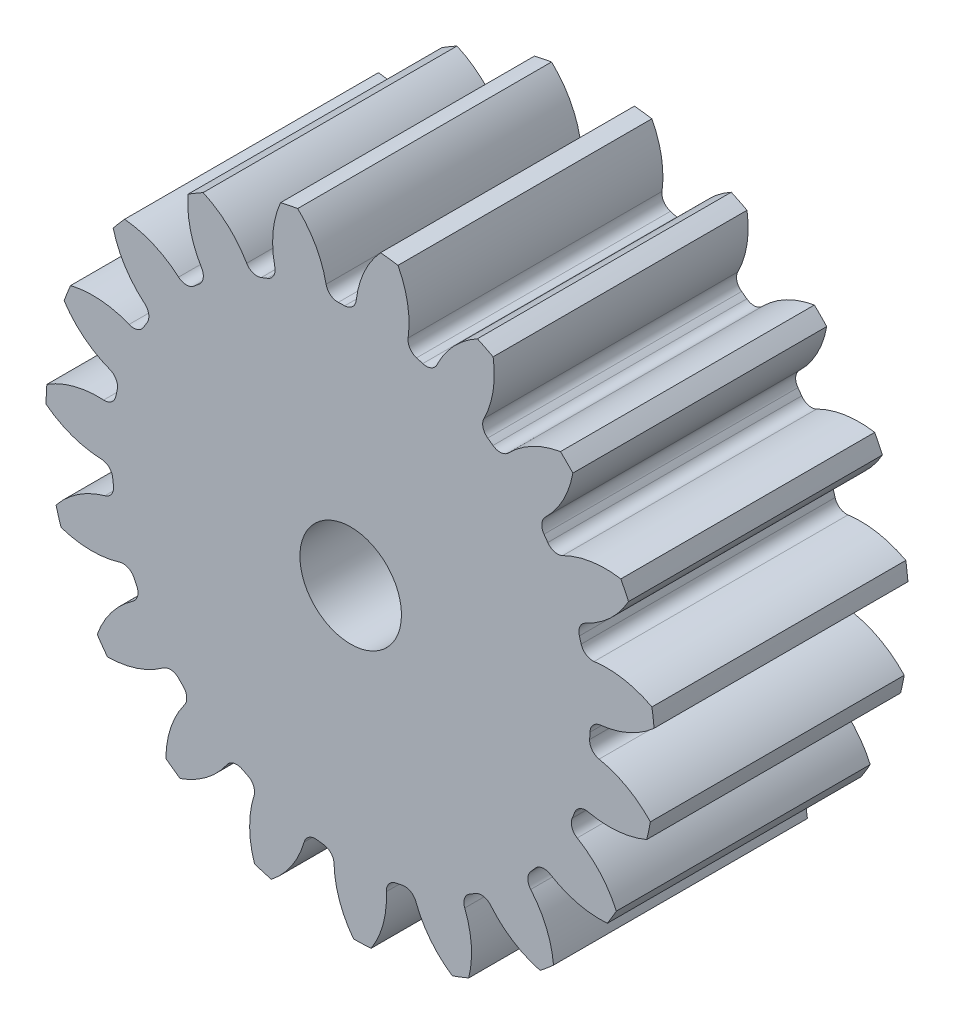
ISO-10303-21;
HEADER;
FILE_DESCRIPTION(('STEP AP214'),'2;1');
FILE_NAME('part.step','',(''),(''),'','','');
FILE_SCHEMA(('AUTOMOTIVE_DESIGN { 1 0 10303 214 1 1 1 1 }'));
ENDSEC;
DATA;
#1=APPLICATION_CONTEXT('core data for automotive mechanical design processes');
#2=APPLICATION_PROTOCOL_DEFINITION('international standard','automotive_design',2000,#1);
#3=PRODUCT_CONTEXT('',#1,'mechanical');
#4=PRODUCT('Part','Part','',(#3));
#5=PRODUCT_RELATED_PRODUCT_CATEGORY('part','',(#4));
#6=PRODUCT_DEFINITION_FORMATION('','',#4);
#7=PRODUCT_DEFINITION_CONTEXT('part definition',#1,'design');
#8=PRODUCT_DEFINITION('design','',#6,#7);
#9=PRODUCT_DEFINITION_SHAPE('','',#8);
#10=(LENGTH_UNIT() NAMED_UNIT(*) SI_UNIT(.MILLI.,.METRE.));
#11=(NAMED_UNIT(*) PLANE_ANGLE_UNIT() SI_UNIT($,.RADIAN.));
#12=(NAMED_UNIT(*) SI_UNIT($,.STERADIAN.) SOLID_ANGLE_UNIT());
#13=UNCERTAINTY_MEASURE_WITH_UNIT(LENGTH_MEASURE(1.E-05),#10,'distance_accuracy_value','');
#14=(GEOMETRIC_REPRESENTATION_CONTEXT(3) GLOBAL_UNCERTAINTY_ASSIGNED_CONTEXT((#13)) GLOBAL_UNIT_ASSIGNED_CONTEXT((#10,
#11,#12)) REPRESENTATION_CONTEXT('',''));
#15=CARTESIAN_POINT('',(0.,0.,0.));
#16=DIRECTION('',(0.,0.,1.));
#17=DIRECTION('',(1.,0.,0.));
#18=AXIS2_PLACEMENT_3D('',#15,#16,#17);
#19=CARTESIAN_POINT('',(0.,0.,88.9));
#20=DIRECTION('',(0.,0.,-1.));
#21=DIRECTION('',(-1.,0.,0.));
#22=AXIS2_PLACEMENT_3D('',#19,#20,#21);
#23=CYLINDRICAL_SURFACE('',#22,106.68);
#24=DIRECTION('',(0.,0.,-1.));
#25=VECTOR('',#24,1.);
#26=CARTESIAN_POINT('',(105.484780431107,15.9243052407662,44.45));
#27=LINE('',#26,#25);
#28=CARTESIAN_POINT('',(105.484780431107,15.9243052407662,88.9));
#29=VERTEX_POINT('',#28);
#30=CARTESIAN_POINT('',(105.484780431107,15.9243052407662,0.));
#31=VERTEX_POINT('',#30);
#32=EDGE_CURVE('E779',#29,#31,#27,.T.);
#33=ORIENTED_EDGE('',*,*,#32,.F.);
#34=CARTESIAN_POINT('',(0.,0.,88.9));
#35=DIRECTION('',(0.,0.,1.));
#36=DIRECTION('',(1.,0.,0.));
#37=AXIS2_PLACEMENT_3D('',#34,#35,#36);
#38=CIRCLE('',#37,106.68);
#39=CARTESIAN_POINT('',(106.227397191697,9.81643957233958,88.9));
#40=VERTEX_POINT('',#39);
#41=EDGE_CURVE('E1462',#40,#29,#38,.T.);
#42=ORIENTED_EDGE('',*,*,#41,.F.);
#43=DIRECTION('',(0.,0.,-1.));
#44=VECTOR('',#43,1.);
#45=CARTESIAN_POINT('',(106.227397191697,9.81643957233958,44.45));
#46=LINE('',#45,#44);
#47=CARTESIAN_POINT('',(106.227397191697,9.81643957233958,0.));
#48=VERTEX_POINT('',#47);
#49=EDGE_CURVE('E1456',#48,#40,#46,.F.);
#50=ORIENTED_EDGE('',*,*,#49,.F.);
#51=CARTESIAN_POINT('',(0.,0.,0.));
#52=DIRECTION('',(0.,0.,1.));
#53=DIRECTION('',(1.,0.,0.));
#54=AXIS2_PLACEMENT_3D('',#51,#52,#53);
#55=CIRCLE('',#54,106.68);
#56=EDGE_CURVE('E1467',#48,#31,#55,.T.);
#57=ORIENTED_EDGE('',*,*,#56,.T.);
#58=EDGE_LOOP('',(#33,#42,#50,#57));
#59=FACE_BOUND('',#58,.T.);
#60=ADVANCED_FACE('F32',(#59),#23,.T.);
#61=DIRECTION('',(0.,0.,-1.));
#62=VECTOR('',#61,1.);
#63=CARTESIAN_POINT('',(97.2843110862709,43.776537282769,44.45));
#64=LINE('',#63,#62);
#65=CARTESIAN_POINT('',(97.2843110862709,43.776537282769,0.));
#66=VERTEX_POINT('',#65);
#67=CARTESIAN_POINT('',(97.2843110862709,43.776537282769,88.9));
#68=VERTEX_POINT('',#67);
#69=EDGE_CURVE('E750',#66,#68,#64,.F.);
#70=ORIENTED_EDGE('',*,*,#69,.F.);
#71=CARTESIAN_POINT('',(94.5987106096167,49.3123346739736,0.));
#72=VERTEX_POINT('',#71);
#73=EDGE_CURVE('E1470',#66,#72,#55,.T.);
#74=ORIENTED_EDGE('',*,*,#73,.T.);
#75=DIRECTION('',(0.,0.,-1.));
#76=VECTOR('',#75,1.);
#77=CARTESIAN_POINT('',(94.5987106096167,49.3123346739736,44.45));
#78=LINE('',#77,#76);
#79=CARTESIAN_POINT('',(94.5987106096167,49.3123346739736,88.9));
#80=VERTEX_POINT('',#79);
#81=EDGE_CURVE('E812',#80,#72,#78,.T.);
#82=ORIENTED_EDGE('',*,*,#81,.F.);
#83=EDGE_CURVE('E1465',#68,#80,#38,.T.);
#84=ORIENTED_EDGE('',*,*,#83,.F.);
#85=EDGE_LOOP('',(#70,#74,#82,#84));
#86=FACE_BOUND('',#85,.T.);
#87=ADVANCED_FACE('F1685',(#86),#23,.T.);
#88=CARTESIAN_POINT('',(0.,0.,88.9));
#89=DIRECTION('',(0.,0.,1.));
#90=DIRECTION('',(1.,0.,0.));
#91=AXIS2_PLACEMENT_3D('',#88,#89,#90);
#92=PLANE('',#91);
#93=CARTESIAN_POINT('',(0.,0.,88.9000000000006));
#94=DIRECTION('',(0.,0.,1.));
#95=DIRECTION('',(1.,0.,0.));
#96=AXIS2_PLACEMENT_3D('',#93,#94,#95);
#97=CIRCLE('',#96,17.78);
#98=CARTESIAN_POINT('',(17.78,0.,88.9000000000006));
#99=VERTEX_POINT('',#98);
#100=EDGE_CURVE('E767',#99,#99,#97,.T.);
#101=ORIENTED_EDGE('',*,*,#100,.F.);
#102=EDGE_LOOP('',(#101));
#103=FACE_BOUND('',#102,.T.);
#104=ORIENTED_EDGE('',*,*,#41,.T.);
#105=CARTESIAN_POINT('',(89.6709040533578,-13.6184238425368,88.9));
#106=DIRECTION('',(0.,0.,-1.));
#107=DIRECTION('',(0.945817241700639,0.32469946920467,0.));
#108=AXIS2_PLACEMENT_3D('',#105,#106,#107);
#109=CIRCLE('',#108,33.508976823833);
#110=CARTESIAN_POINT('',(85.2486339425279,19.5974617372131,88.9));
#111=VERTEX_POINT('',#110);
#112=EDGE_CURVE('E759',#111,#29,#109,.T.);
#113=ORIENTED_EDGE('',*,*,#112,.F.);
#114=CARTESIAN_POINT('',(84.7029109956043,23.696413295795,88.9));
#115=DIRECTION('',(0.,0.,1.));
#116=DIRECTION('',(-0.945817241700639,-0.32469946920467,0.));
#117=AXIS2_PLACEMENT_3D('',#114,#115,#116);
#118=CIRCLE('',#117,4.13512);
#119=CARTESIAN_POINT('',(80.7206902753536,22.5823506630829,88.9));
#120=VERTEX_POINT('',#119);
#121=EDGE_CURVE('E757',#120,#111,#118,.T.);
#122=ORIENTED_EDGE('',*,*,#121,.F.);
#123=CARTESIAN_POINT('',(0.,0.,88.9));
#124=DIRECTION('',(0.,0.,-1.));
#125=DIRECTION('',(0.945817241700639,0.32469946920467,0.));
#126=AXIS2_PLACEMENT_3D('',#123,#124,#125);
#127=CIRCLE('',#126,83.82);
#128=CARTESIAN_POINT('',(80.0790713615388,24.7615575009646,88.9));
#129=VERTEX_POINT('',#128);
#130=EDGE_CURVE('E742',#129,#120,#127,.T.);
#131=ORIENTED_EDGE('',*,*,#130,.F.);
#132=CARTESIAN_POINT('',(84.0296388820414,25.9831276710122,88.9));
#133=DIRECTION('',(0.,0.,1.));
#134=DIRECTION('',(-0.945817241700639,-0.32469946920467,0.));
#135=AXIS2_PLACEMENT_3D('',#132,#133,#134);
#136=CIRCLE('',#135,4.13512000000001);
#137=CARTESIAN_POINT('',(82.2671504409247,29.7238297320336,88.9));
#138=VERTEX_POINT('',#137);
#139=EDGE_CURVE('E734',#138,#129,#136,.T.);
#140=ORIENTED_EDGE('',*,*,#139,.F.);
#141=CARTESIAN_POINT('',(67.9848117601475,60.0366377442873,88.9));
#142=DIRECTION('',(0.,0.,-1.));
#143=DIRECTION('',(-0.945817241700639,-0.32469946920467,0.));
#144=AXIS2_PLACEMENT_3D('',#141,#142,#143);
#145=CIRCLE('',#144,33.508976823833);
#146=EDGE_CURVE('E764',#68,#138,#145,.T.);
#147=ORIENTED_EDGE('',*,*,#146,.F.);
#148=ORIENTED_EDGE('',*,*,#83,.T.);
#149=CARTESIAN_POINT('',(89.2341821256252,16.2355548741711,88.9));
#150=DIRECTION('',(0.,0.,-1.));
#151=DIRECTION('',(0.789140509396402,0.614212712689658,0.));
#152=AXIS2_PLACEMENT_3D('',#149,#150,#151);
#153=CIRCLE('',#152,33.508976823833);
#154=CARTESIAN_POINT('',(74.2663423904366,46.2158033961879,88.9));
#155=VERTEX_POINT('',#154);
#156=EDGE_CURVE('E788',#155,#80,#153,.T.);
#157=ORIENTED_EDGE('',*,*,#156,.F.);
#158=CARTESIAN_POINT('',(72.4192608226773,49.9154665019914,88.9));
#159=DIRECTION('',(0.,0.,1.));
#160=DIRECTION('',(-0.789140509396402,-0.614212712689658,0.));
#161=AXIS2_PLACEMENT_3D('',#158,#159,#160);
#162=CIRCLE('',#161,4.13512);
#163=CARTESIAN_POINT('',(69.014543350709,47.5687419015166,88.9));
#164=VERTEX_POINT('',#163);
#165=EDGE_CURVE('E786',#164,#155,#162,.T.);
#166=ORIENTED_EDGE('',*,*,#165,.F.);
#167=CARTESIAN_POINT('',(0.,0.,88.9));
#168=DIRECTION('',(0.,0.,-1.));
#169=DIRECTION('',(0.789140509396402,0.614212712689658,0.));
#170=AXIS2_PLACEMENT_3D('',#167,#168,#169);
#171=CIRCLE('',#170,83.82);
#172=CARTESIAN_POINT('',(67.7001018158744,49.4215399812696,88.9));
#173=VERTEX_POINT('',#172);
#174=EDGE_CURVE('E783',#173,#164,#171,.T.);
#175=ORIENTED_EDGE('',*,*,#174,.F.);
#176=CARTESIAN_POINT('',(71.0399735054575,51.8596692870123,88.9));
#177=DIRECTION('',(0.,0.,1.));
#178=DIRECTION('',(-0.789140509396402,-0.614212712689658,0.));
#179=AXIS2_PLACEMENT_3D('',#176,#177,#178);
#180=CIRCLE('',#179,4.13512000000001);
#181=CARTESIAN_POINT('',(68.1583775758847,54.8254107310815,88.9));
#182=VERTEX_POINT('',#181);
#183=EDGE_CURVE('E781',#182,#173,#180,.T.);
#184=ORIENTED_EDGE('',*,*,#183,.F.);
#185=CARTESIAN_POINT('',(44.8073427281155,78.8583194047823,88.9));
#186=DIRECTION('',(0.,0.,-1.));
#187=DIRECTION('',(-0.789140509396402,-0.614212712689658,0.));
#188=AXIS2_PLACEMENT_3D('',#185,#186,#187);
#189=CIRCLE('',#188,33.508976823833);
#190=CARTESIAN_POINT('',(77.798960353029,72.9927679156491,88.9));
#191=VERTEX_POINT('',#190);
#192=EDGE_CURVE('E791',#191,#182,#189,.T.);
#193=ORIENTED_EDGE('',*,*,#192,.F.);
#194=CARTESIAN_POINT('',(73.4614026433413,77.3566074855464,88.9));
#195=VERTEX_POINT('',#194);
#196=EDGE_CURVE('E1516',#191,#195,#38,.T.);
#197=ORIENTED_EDGE('',*,*,#196,.T.);
#198=CARTESIAN_POINT('',(79.127551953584,44.3301592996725,88.9));
#199=DIRECTION('',(0.,0.,-1.));
#200=DIRECTION('',(0.546948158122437,0.837166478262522,0.));
#201=AXIS2_PLACEMENT_3D('',#198,#199,#200);
#202=CIRCLE('',#201,33.508976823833);
#203=CARTESIAN_POINT('',(55.2361402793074,67.8259456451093,88.9));
#204=VERTEX_POINT('',#203);
#205=EDGE_CURVE('E823',#204,#195,#202,.T.);
#206=ORIENTED_EDGE('',*,*,#205,.F.);
#207=CARTESIAN_POINT('',(52.2878600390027,70.7254043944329,88.9));
#208=DIRECTION('',(0.,0.,1.));
#209=DIRECTION('',(-0.546948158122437,-0.837166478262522,0.));
#210=AXIS2_PLACEMENT_3D('',#207,#208,#209);
#211=CIRCLE('',#210,4.13512);
#212=CARTESIAN_POINT('',(49.8295997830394,67.4003218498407,88.9));
#213=VERTEX_POINT('',#212);
#214=EDGE_CURVE('E821',#213,#204,#211,.T.);
#215=ORIENTED_EDGE('',*,*,#214,.F.);
#216=CARTESIAN_POINT('',(0.,0.,88.9));
#217=DIRECTION('',(0.,0.,-1.));
#218=DIRECTION('',(0.546948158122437,0.837166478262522,0.));
#219=AXIS2_PLACEMENT_3D('',#216,#217,#218);
#220=CIRCLE('',#219,83.82);
#221=CARTESIAN_POINT('',(47.9847757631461,68.7259317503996,88.9));
#222=VERTEX_POINT('',#221);
#223=EDGE_CURVE('E818',#222,#213,#220,.T.);
#224=ORIENTED_EDGE('',*,*,#223,.F.);
#225=CARTESIAN_POINT('',(50.3520247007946,72.116411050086,88.9));
#226=DIRECTION('',(0.,0.,1.));
#227=DIRECTION('',(-0.546948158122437,-0.837166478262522,0.));
#228=AXIS2_PLACEMENT_3D('',#225,#226,#227);
#229=CIRCLE('',#228,4.13512000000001);
#230=CARTESIAN_POINT('',(46.6635869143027,73.9858077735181,88.9));
#231=VERTEX_POINT('',#230);
#232=EDGE_CURVE('E816',#231,#222,#229,.T.);
#233=ORIENTED_EDGE('',*,*,#232,.F.);
#234=CARTESIAN_POINT('',(16.7743028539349,89.1344785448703,88.9));
#235=DIRECTION('',(0.,0.,-1.));
#236=DIRECTION('',(-0.546948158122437,-0.837166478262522,0.));
#237=AXIS2_PLACEMENT_3D('',#234,#235,#236);
#238=CIRCLE('',#237,33.508976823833);
#239=CARTESIAN_POINT('',(49.882885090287,94.2990995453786,88.9));
#240=VERTEX_POINT('',#239);
#241=EDGE_CURVE('E826',#240,#231,#238,.T.);
#242=ORIENTED_EDGE('',*,*,#241,.F.);
#243=CARTESIAN_POINT('',(44.3634118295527,97.0180915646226,88.9));
#244=VERTEX_POINT('',#243);
#245=EDGE_CURVE('E1667',#240,#244,#38,.T.);
#246=ORIENTED_EDGE('',*,*,#245,.T.);
#247=CARTESIAN_POINT('',(60.4462237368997,67.6209031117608,88.9));
#248=DIRECTION('',(0.,0.,-1.));
#249=DIRECTION('',(0.24548548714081,0.969400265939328,0.));
#250=AXIS2_PLACEMENT_3D('',#247,#248,#249);
#251=CIRCLE('',#250,33.508976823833);
#252=CARTESIAN_POINT('',(30.220245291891,82.0860942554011,88.9));
#253=VERTEX_POINT('',#252);
#254=EDGE_CURVE('E861',#253,#244,#251,.T.);
#255=ORIENTED_EDGE('',*,*,#254,.F.);
#256=CARTESIAN_POINT('',(26.4902582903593,83.8711473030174,88.9));
#257=DIRECTION('',(0.,0.,1.));
#258=DIRECTION('',(-0.24548548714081,-0.969400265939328,0.));
#259=AXIS2_PLACEMENT_3D('',#256,#257,#258);
#260=CIRCLE('',#259,4.13512);
#261=CARTESIAN_POINT('',(25.2448458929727,79.9280311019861,88.9));
#262=VERTEX_POINT('',#261);
#263=EDGE_CURVE('E859',#262,#253,#260,.T.);
#264=ORIENTED_EDGE('',*,*,#263,.F.);
#265=CARTESIAN_POINT('',(0.,0.,88.9));
#266=DIRECTION('',(0.,0.,-1.));
#267=DIRECTION('',(0.24548548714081,0.969400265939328,0.));
#268=AXIS2_PLACEMENT_3D('',#265,#266,#267);
#269=CIRCLE('',#268,83.82);
#270=CARTESIAN_POINT('',(23.0695546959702,80.5828024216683,88.9));
#271=VERTEX_POINT('',#270);
#272=EDGE_CURVE('E856',#271,#262,#269,.T.);
#273=ORIENTED_EDGE('',*,*,#272,.F.);
#274=CARTESIAN_POINT('',(24.207652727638,84.5582206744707,88.9));
#275=DIRECTION('',(0.,0.,1.));
#276=DIRECTION('',(-0.24548548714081,-0.969400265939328,0.));
#277=AXIS2_PLACEMENT_3D('',#274,#275,#276);
#278=CIRCLE('',#277,4.13512000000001);
#279=CARTESIAN_POINT('',(20.1120725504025,85.128694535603,88.9));
#280=VERTEX_POINT('',#279);
#281=EDGE_CURVE('E854',#280,#271,#278,.T.);
#282=ORIENTED_EDGE('',*,*,#281,.F.);
#283=CARTESIAN_POINT('',(-13.0764930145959,89.7515338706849,88.9));
#284=DIRECTION('',(0.,0.,-1.));
#285=DIRECTION('',(-0.24548548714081,-0.969400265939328,0.));
#286=AXIS2_PLACEMENT_3D('',#283,#284,#285);
#287=CIRCLE('',#286,33.508976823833);
#288=CARTESIAN_POINT('',(16.5612252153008,105.386660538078,88.9));
#289=VERTEX_POINT('',#288);
#290=EDGE_CURVE('E864',#289,#280,#287,.T.);
#291=ORIENTED_EDGE('',*,*,#290,.F.);
#292=CARTESIAN_POINT('',(10.4579569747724,106.166160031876,88.9));
#293=VERTEX_POINT('',#292);
#294=EDGE_CURVE('E1663',#289,#293,#38,.T.);
#295=ORIENTED_EDGE('',*,*,#294,.T.);
#296=CARTESIAN_POINT('',(35.2146092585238,83.5838728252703,88.9));
#297=DIRECTION('',(0.,0.,-1.));
#298=DIRECTION('',(-0.0825793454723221,0.996584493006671,0.));
#299=AXIS2_PLACEMENT_3D('',#296,#297,#298);
#300=CIRCLE('',#299,33.508976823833);
#301=CARTESIAN_POINT('',(1.92951781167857,87.4509408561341,88.9));
#302=VERTEX_POINT('',#301);
#303=EDGE_CURVE('E899',#302,#293,#300,.T.);
#304=ORIENTED_EDGE('',*,*,#303,.F.);
#305=CARTESIAN_POINT('',(-2.17797398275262,87.9281500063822,88.9));
#306=DIRECTION('',(0.,0.,1.));
#307=DIRECTION('',(0.0825793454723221,-0.996584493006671,0.));
#308=AXIS2_PLACEMENT_3D('',#305,#306,#307);
#309=CIRCLE('',#308,4.13512);
#310=CARTESIAN_POINT('',(-2.07557876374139,83.7942979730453,88.9));
#311=VERTEX_POINT('',#310);
#312=EDGE_CURVE('E897',#311,#302,#309,.T.);
#313=ORIENTED_EDGE('',*,*,#312,.F.);
#314=CARTESIAN_POINT('',(0.,0.,88.9));
#315=DIRECTION('',(0.,0.,-1.));
#316=DIRECTION('',(-0.0825793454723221,0.996584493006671,0.));
#317=AXIS2_PLACEMENT_3D('',#314,#315,#316);
#318=CIRCLE('',#317,83.82);
#319=CARTESIAN_POINT('',(-4.34561058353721,83.7072760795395,88.9));
#320=VERTEX_POINT('',#319);
#321=EDGE_CURVE('E894',#320,#311,#318,.T.);
#322=ORIENTED_EDGE('',*,*,#321,.F.);
#323=CARTESIAN_POINT('',(-4.55999403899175,87.8368350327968,88.9));
#324=DIRECTION('',(0.,0.,1.));
#325=DIRECTION('',(0.0825793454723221,-0.996584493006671,0.));
#326=AXIS2_PLACEMENT_3D('',#323,#324,#325);
#327=CIRCLE('',#326,4.13512000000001);
#328=CARTESIAN_POINT('',(-8.61889694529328,87.0465663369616,88.9));
#329=VERTEX_POINT('',#328);
#330=EDGE_CURVE('E892',#329,#320,#327,.T.);
#331=ORIENTED_EDGE('',*,*,#330,.F.);
#332=CARTESIAN_POINT('',(-41.5102479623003,80.6426178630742,88.9));
#333=DIRECTION('',(0.,0.,-1.));
#334=DIRECTION('',(0.0825793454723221,-0.996584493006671,0.));
#335=AXIS2_PLACEMENT_3D('',#332,#333,#334);
#336=CIRCLE('',#335,33.508976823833);
#337=CARTESIAN_POINT('',(-18.5551003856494,105.053941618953,88.9));
#338=VERTEX_POINT('',#337);
#339=EDGE_CURVE('E902',#338,#329,#336,.T.);
#340=ORIENTED_EDGE('',*,*,#339,.F.);
#341=CARTESIAN_POINT('',(-24.5807797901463,103.809477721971,88.9));
#342=VERTEX_POINT('',#341);
#343=EDGE_CURVE('E1659',#338,#342,#38,.T.);
#344=ORIENTED_EDGE('',*,*,#343,.T.);
#345=CARTESIAN_POINT('',(6.16694545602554,90.4892329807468,88.9));
#346=DIRECTION('',(0.,0.,-1.));
#347=DIRECTION('',(-0.40169542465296,0.915773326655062,0.));
#348=AXIS2_PLACEMENT_3D('',#345,#346,#347);
#349=CIRCLE('',#348,33.508976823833);
#350=CARTESIAN_POINT('',(-26.5703028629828,83.3391210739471,88.9));
#351=VERTEX_POINT('',#350);
#352=EDGE_CURVE('E937',#351,#342,#349,.T.);
#353=ORIENTED_EDGE('',*,*,#352,.F.);
#354=CARTESIAN_POINT('',(-30.6101889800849,82.4567733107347,88.9));
#355=DIRECTION('',(0.,0.,1.));
#356=DIRECTION('',(0.40169542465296,-0.915773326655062,0.));
#357=AXIS2_PLACEMENT_3D('',#354,#355,#356);
#358=CIRCLE('',#357,4.13512);
#359=CARTESIAN_POINT('',(-29.1710822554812,78.5801524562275,88.9));
#360=VERTEX_POINT('',#359);
#361=EDGE_CURVE('E935',#360,#351,#358,.T.);
#362=ORIENTED_EDGE('',*,*,#361,.F.);
#363=CARTESIAN_POINT('',(0.,0.,88.9));
#364=DIRECTION('',(0.,0.,-1.));
#365=DIRECTION('',(-0.40169542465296,0.915773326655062,0.));
#366=AXIS2_PLACEMENT_3D('',#363,#364,#365);
#367=CIRCLE('',#366,83.82);
#368=CARTESIAN_POINT('',(-31.2898615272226,77.7607675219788,88.9));
#369=VERTEX_POINT('',#368);
#370=EDGE_CURVE('E932',#369,#360,#367,.T.);
#371=ORIENTED_EDGE('',*,*,#370,.F.);
#372=CARTESIAN_POINT('',(-32.833494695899,81.5969653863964,88.9));
#373=DIRECTION('',(0.,0.,1.));
#374=DIRECTION('',(0.40169542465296,-0.915773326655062,0.));
#375=AXIS2_PLACEMENT_3D('',#372,#373,#374);
#376=CIRCLE('',#375,4.13512000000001);
#377=CARTESIAN_POINT('',(-36.415875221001,79.5315920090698,88.9));
#378=VERTEX_POINT('',#377);
#379=EDGE_CURVE('E930',#378,#369,#376,.T.);
#380=ORIENTED_EDGE('',*,*,#379,.F.);
#381=CARTESIAN_POINT('',(-65.4457234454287,62.7948229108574,88.9));
#382=DIRECTION('',(0.,0.,-1.));
#383=DIRECTION('',(0.40169542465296,-0.915773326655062,0.));
#384=AXIS2_PLACEMENT_3D('',#381,#382,#383);
#385=CIRCLE('',#384,33.508976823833);
#386=CARTESIAN_POINT('',(-51.6606929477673,93.336998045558,88.9));
#387=VERTEX_POINT('',#386);
#388=EDGE_CURVE('E940',#387,#378,#385,.T.);
#389=ORIENTED_EDGE('',*,*,#388,.F.);
#390=CARTESIAN_POINT('',(-56.9558076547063,90.2034277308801,88.9));
#391=VERTEX_POINT('',#390);
#392=EDGE_CURVE('E1655',#387,#391,#38,.T.);
#393=ORIENTED_EDGE('',*,*,#392,.T.);
#394=CARTESIAN_POINT('',(-23.5490025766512,87.5886806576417,88.9));
#395=DIRECTION('',(0.,0.,-1.));
#396=DIRECTION('',(-0.677281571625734,0.735723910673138,0.));
#397=AXIS2_PLACEMENT_3D('',#394,#395,#396);
#398=CIRCLE('',#397,33.508976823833);
#399=CARTESIAN_POINT('',(-52.1908189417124,70.1962143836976,88.9));
#400=VERTEX_POINT('',#399);
#401=EDGE_CURVE('E975',#400,#391,#398,.T.);
#402=ORIENTED_EDGE('',*,*,#401,.F.);
#403=CARTESIAN_POINT('',(-55.7253150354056,68.0499257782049,88.9));
#404=DIRECTION('',(0.,0.,1.));
#405=DIRECTION('',(0.677281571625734,-0.735723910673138,0.));
#406=AXIS2_PLACEMENT_3D('',#403,#404,#405);
#407=CIRCLE('',#406,4.13512);
#408=CARTESIAN_POINT('',(-53.1054463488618,64.8506281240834,88.9));
#409=VERTEX_POINT('',#408);
#410=EDGE_CURVE('E973',#409,#400,#407,.T.);
#411=ORIENTED_EDGE('',*,*,#410,.F.);
#412=CARTESIAN_POINT('',(0.,0.,88.9));
#413=DIRECTION('',(0.,0.,-1.));
#414=DIRECTION('',(-0.677281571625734,0.735723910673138,0.));
#415=AXIS2_PLACEMENT_3D('',#412,#413,#414);
#416=CIRCLE('',#415,83.82);
#417=CARTESIAN_POINT('',(-54.8433704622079,63.387673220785,88.9));
#418=VERTEX_POINT('',#417);
#419=EDGE_CURVE('E970',#418,#409,#416,.T.);
#420=ORIENTED_EDGE('',*,*,#419,.F.);
#421=CARTESIAN_POINT('',(-57.5489767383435,66.5147984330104,88.9));
#422=DIRECTION('',(0.,0.,1.));
#423=DIRECTION('',(0.677281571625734,-0.735723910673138,0.));
#424=AXIS2_PLACEMENT_3D('',#421,#422,#423);
#425=CIRCLE('',#424,4.13512000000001);
#426=CARTESIAN_POINT('',(-60.2666283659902,63.3981356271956,88.9));
#427=VERTEX_POINT('',#426);
#428=EDGE_CURVE('E968',#427,#418,#425,.T.);
#429=ORIENTED_EDGE('',*,*,#428,.F.);
#430=CARTESIAN_POINT('',(-82.2891392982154,38.1422345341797,88.9));
#431=DIRECTION('',(0.,0.,-1.));
#432=DIRECTION('',(0.677281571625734,-0.735723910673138,0.));
#433=AXIS2_PLACEMENT_3D('',#430,#431,#432);
#434=CIRCLE('',#433,33.508976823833);
#435=CARTESIAN_POINT('',(-79.168047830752,71.505542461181,88.9));
#436=VERTEX_POINT('',#435);
#437=EDGE_CURVE('E978',#436,#427,#434,.T.);
#438=ORIENTED_EDGE('',*,*,#437,.F.);
#439=CARTESIAN_POINT('',(-83.158789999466,66.8224366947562,88.9));
#440=VERTEX_POINT('',#439);
#441=EDGE_CURVE('E1651',#436,#440,#38,.T.);
#442=ORIENTED_EDGE('',*,*,#441,.T.);
#443=CARTESIAN_POINT('',(-50.7130507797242,75.1965357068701,88.9));
#444=DIRECTION('',(0.,0.,-1.));
#445=DIRECTION('',(-0.879473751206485,0.475947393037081,0.));
#446=AXIS2_PLACEMENT_3D('',#443,#444,#445);
#447=CIRCLE('',#446,33.508976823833);
#448=CARTESIAN_POINT('',(-72.1556499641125,49.4464586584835,88.9));
#449=VERTEX_POINT('',#448);
#450=EDGE_CURVE('E1013',#449,#440,#447,.T.);
#451=ORIENTED_EDGE('',*,*,#450,.F.);
#452=CARTESIAN_POINT('',(-74.8017385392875,46.2688128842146,88.9));
#453=DIRECTION('',(0.,0.,1.));
#454=DIRECTION('',(0.879473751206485,-0.475947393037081,0.));
#455=AXIS2_PLACEMENT_3D('',#452,#453,#454);
#456=CIRCLE('',#455,4.13512);
#457=CARTESIAN_POINT('',(-71.2850113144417,44.0935319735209,88.9));
#458=VERTEX_POINT('',#457);
#459=EDGE_CURVE('E1011',#458,#449,#456,.T.);
#460=ORIENTED_EDGE('',*,*,#459,.F.);
#461=CARTESIAN_POINT('',(0.,0.,88.9));
#462=DIRECTION('',(0.,0.,-1.));
#463=DIRECTION('',(-0.879473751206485,0.475947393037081,0.));
#464=AXIS2_PLACEMENT_3D('',#461,#462,#463);
#465=CIRCLE('',#464,83.82);
#466=CARTESIAN_POINT('',(-72.4537492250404,42.1455409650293,88.9));
#467=VERTEX_POINT('',#466);
#468=EDGE_CURVE('E1008',#467,#458,#465,.T.);
#469=ORIENTED_EDGE('',*,*,#468,.F.);
#470=CARTESIAN_POINT('',(-76.0281341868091,44.2247209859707,88.9));
#471=DIRECTION('',(0.,0.,1.));
#472=DIRECTION('',(0.879473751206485,-0.475947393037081,0.));
#473=AXIS2_PLACEMENT_3D('',#470,#471,#472);
#474=CIRCLE('',#473,4.13512000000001);
#475=CARTESIAN_POINT('',(-77.586557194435,40.3945075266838,88.9));
#476=VERTEX_POINT('',#475);
#477=EDGE_CURVE('E1006',#476,#467,#474,.T.);
#478=ORIENTED_EDGE('',*,*,#477,.F.);
#479=CARTESIAN_POINT('',(-90.2152500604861,9.35634320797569,88.9));
#480=DIRECTION('',(0.,0.,-1.));
#481=DIRECTION('',(0.879473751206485,-0.475947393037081,0.));
#482=AXIS2_PLACEMENT_3D('',#479,#480,#481);
#483=CIRCLE('',#482,33.508976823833);
#484=CARTESIAN_POINT('',(-98.0963163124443,41.9253518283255,88.9));
#485=VERTEX_POINT('',#484);
#486=EDGE_CURVE('E1016',#485,#476,#483,.T.);
#487=ORIENTED_EDGE('',*,*,#486,.F.);
#488=CARTESIAN_POINT('',(-100.350227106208,36.2001977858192,88.9));
#489=VERTEX_POINT('',#488);
#490=EDGE_CURVE('E1647',#485,#489,#38,.T.);
#491=ORIENTED_EDGE('',*,*,#490,.T.);
#492=CARTESIAN_POINT('',(-72.3815530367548,54.6556793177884,88.9));
#493=DIRECTION('',(0.,0.,-1.));
#494=DIRECTION('',(-0.986361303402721,0.164594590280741,0.));
#495=AXIS2_PLACEMENT_3D('',#492,#493,#494);
#496=CIRCLE('',#495,33.508976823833);
#497=CARTESIAN_POINT('',(-84.3012967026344,23.3384118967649,88.9));
#498=VERTEX_POINT('',#497);
#499=EDGE_CURVE('E1051',#498,#489,#496,.T.);
#500=ORIENTED_EDGE('',*,*,#499,.F.);
#501=CARTESIAN_POINT('',(-85.7722330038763,19.4737561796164,88.9));
#502=DIRECTION('',(0.,0.,1.));
#503=DIRECTION('',(0.986361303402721,-0.164594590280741,0.));
#504=AXIS2_PLACEMENT_3D('',#501,#502,#503);
#505=CIRCLE('',#504,4.13512);
#506=CARTESIAN_POINT('',(-81.7397392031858,18.5582174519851,88.9));
#507=VERTEX_POINT('',#506);
#508=EDGE_CURVE('E1049',#507,#498,#505,.T.);
#509=ORIENTED_EDGE('',*,*,#508,.F.);
#510=CARTESIAN_POINT('',(0.,0.,88.9));
#511=DIRECTION('',(0.,0.,-1.));
#512=DIRECTION('',(-0.986361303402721,0.164594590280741,0.));
#513=AXIS2_PLACEMENT_3D('',#510,#511,#512);
#514=CIRCLE('',#513,83.82);
#515=CARTESIAN_POINT('',(-82.2126400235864,16.3362853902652,88.9));
#516=VERTEX_POINT('',#515);
#517=EDGE_CURVE('E1046',#516,#507,#514,.T.);
#518=ORIENTED_EDGE('',*,*,#517,.F.);
#519=CARTESIAN_POINT('',(-86.2684635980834,17.1422088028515,88.9));
#520=DIRECTION('',(0.,0.,1.));
#521=DIRECTION('',(0.986361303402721,-0.164594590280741,0.));
#522=AXIS2_PLACEMENT_3D('',#519,#520,#521);
#523=CIRCLE('',#522,4.13512000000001);
#524=CARTESIAN_POINT('',(-86.4987786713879,13.0135077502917,88.9));
#525=VERTEX_POINT('',#524);
#526=EDGE_CURVE('E1044',#525,#516,#523,.T.);
#527=ORIENTED_EDGE('',*,*,#526,.F.);
#528=CARTESIAN_POINT('',(-88.3651386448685,-20.4434530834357,88.9));
#529=DIRECTION('',(0.,0.,-1.));
#530=DIRECTION('',(0.986361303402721,-0.164594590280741,0.));
#531=AXIS2_PLACEMENT_3D('',#528,#529,#530);
#532=CIRCLE('',#531,33.508976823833);
#533=CARTESIAN_POINT('',(-106.394326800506,7.80189878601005,88.9));
#534=VERTEX_POINT('',#533);
#535=EDGE_CURVE('E1054',#534,#525,#532,.T.);
#536=ORIENTED_EDGE('',*,*,#535,.F.);
#537=CARTESIAN_POINT('',(-106.667160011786,1.65510574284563,88.9));
#538=VERTEX_POINT('',#537);
#539=EDGE_CURVE('E1643',#534,#538,#38,.T.);
#540=ORIENTED_EDGE('',*,*,#539,.T.);
#541=CARTESIAN_POINT('',(-86.2063909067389,28.1920320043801,88.9));
#542=DIRECTION('',(0.,0.,-1.));
#543=DIRECTION('',(-0.986361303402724,-0.164594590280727,0.));
#544=AXIS2_PLACEMENT_3D('',#541,#542,#543);
#545=CIRCLE('',#544,33.508976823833);
#546=CARTESIAN_POINT('',(-87.3115898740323,-5.29871392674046,88.9));
#547=VERTEX_POINT('',#546);
#548=EDGE_CURVE('E1089',#547,#538,#545,.T.);
#549=ORIENTED_EDGE('',*,*,#548,.F.);
#550=CARTESIAN_POINT('',(-87.4479751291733,-9.43158417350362,88.9));
#551=DIRECTION('',(0.,0.,1.));
#552=DIRECTION('',(0.986361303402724,0.164594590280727,0.));
#553=AXIS2_PLACEMENT_3D('',#550,#551,#552);
#554=CIRCLE('',#553,4.13512);
#555=CARTESIAN_POINT('',(-83.3366980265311,-8.98816789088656,88.9));
#556=VERTEX_POINT('',#555);
#557=EDGE_CURVE('E1087',#556,#547,#554,.T.);
#558=ORIENTED_EDGE('',*,*,#557,.F.);
#559=CARTESIAN_POINT('',(0.,0.,88.9));
#560=DIRECTION('',(0.,0.,-1.));
#561=DIRECTION('',(-0.986361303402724,-0.164594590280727,0.));
#562=AXIS2_PLACEMENT_3D('',#559,#560,#561);
#563=CIRCLE('',#562,83.82);
#564=CARTESIAN_POINT('',(-83.062515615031,-11.2432601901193,88.9));
#565=VERTEX_POINT('',#564);
#566=EDGE_CURVE('E1084',#565,#556,#563,.T.);
#567=ORIENTED_EDGE('',*,*,#566,.F.);
#568=CARTESIAN_POINT('',(-87.1602663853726,-11.7979276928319,88.9));
#569=DIRECTION('',(0.,0.,1.));
#570=DIRECTION('',(0.986361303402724,0.164594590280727,0.));
#571=AXIS2_PLACEMENT_3D('',#568,#569,#570);
#572=CIRCLE('',#571,4.13512000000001);
#573=CARTESIAN_POINT('',(-86.0375153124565,-15.7777075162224,88.9));
#574=VERTEX_POINT('',#573);
#575=EDGE_CURVE('E1082',#574,#565,#572,.T.);
#576=ORIENTED_EDGE('',*,*,#575,.F.);
#577=CARTESIAN_POINT('',(-76.9392933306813,-48.0278840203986,88.9));
#578=DIRECTION('',(0.,0.,-1.));
#579=DIRECTION('',(0.986361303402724,0.164594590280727,0.));
#580=AXIS2_PLACEMENT_3D('',#577,#578,#579);
#581=CIRCLE('',#580,33.508976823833);
#582=CARTESIAN_POINT('',(-103.162861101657,-27.1670110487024,88.9));
#583=VERTEX_POINT('',#582);
#584=EDGE_CURVE('E1092',#583,#574,#581,.T.);
#585=ORIENTED_EDGE('',*,*,#584,.F.);
#586=CARTESIAN_POINT('',(-101.425051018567,-33.069342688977,88.9));
#587=VERTEX_POINT('',#586);
#588=EDGE_CURVE('E1639',#583,#587,#38,.T.);
#589=ORIENTED_EDGE('',*,*,#588,.T.);
#590=CARTESIAN_POINT('',(-90.6894286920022,-1.32665942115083,88.9));
#591=DIRECTION('',(0.,0.,-1.));
#592=DIRECTION('',(-0.879473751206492,-0.475947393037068,0.));
#593=AXIS2_PLACEMENT_3D('',#590,#591,#592);
#594=CIRCLE('',#593,33.508976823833);
#595=CARTESIAN_POINT('',(-80.8603175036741,-33.3616418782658,88.9));
#596=VERTEX_POINT('',#595);
#597=EDGE_CURVE('E1127',#596,#587,#594,.T.);
#598=ORIENTED_EDGE('',*,*,#597,.F.);
#599=CARTESIAN_POINT('',(-79.6473722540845,-37.3148660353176,88.9));
#600=DIRECTION('',(0.,0.,1.));
#601=DIRECTION('',(0.879473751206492,0.475947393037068,0.));
#602=AXIS2_PLACEMENT_3D('',#599,#600,#601);
#603=CIRCLE('',#602,4.13512);
#604=CARTESIAN_POINT('',(-75.9028325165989,-35.5605457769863,88.9));
#605=VERTEX_POINT('',#604);
#606=EDGE_CURVE('E1125',#605,#596,#603,.T.);
#607=ORIENTED_EDGE('',*,*,#606,.F.);
#608=CARTESIAN_POINT('',(0.,0.,88.9));
#609=DIRECTION('',(0.,0.,-1.));
#610=DIRECTION('',(-0.879473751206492,-0.475947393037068,0.));
#611=AXIS2_PLACEMENT_3D('',#608,#609,#610);
#612=CIRCLE('',#611,83.82);
#613=CARTESIAN_POINT('',(-74.9112787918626,-37.6044240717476,88.9));
#614=VERTEX_POINT('',#613);
#615=EDGE_CURVE('E1122',#614,#605,#612,.T.);
#616=ORIENTED_EDGE('',*,*,#615,.F.);
#617=CARTESIAN_POINT('',(-78.6069018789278,-39.4595756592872,88.9));
#618=DIRECTION('',(0.,0.,1.));
#619=DIRECTION('',(0.879473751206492,0.475947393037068,0.));
#620=AXIS2_PLACEMENT_3D('',#617,#618,#619);
#621=CIRCLE('',#620,4.13512000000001);
#622=CARTESIAN_POINT('',(-76.2527521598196,-42.8591633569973,88.9));
#623=VERTEX_POINT('',#622);
#624=EDGE_CURVE('E1120',#623,#614,#621,.T.);
#625=ORIENTED_EDGE('',*,*,#624,.F.);
#626=CARTESIAN_POINT('',(-57.1758817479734,-70.4077484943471,88.9));
#627=DIRECTION('',(0.,0.,-1.));
#628=DIRECTION('',(0.879473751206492,0.475947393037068,0.));
#629=AXIS2_PLACEMENT_3D('',#626,#627,#628);
#630=CIRCLE('',#629,33.508976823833);
#631=CARTESIAN_POINT('',(-88.752098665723,-59.1919536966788,88.9));
#632=VERTEX_POINT('',#631);
#633=EDGE_CURVE('E1130',#632,#623,#630,.T.);
#634=ORIENTED_EDGE('',*,*,#633,.F.);
#635=CARTESIAN_POINT('',(-85.1919639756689,-64.2102147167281,88.9));
#636=VERTEX_POINT('',#635);
#637=EDGE_CURVE('E1635',#632,#636,#38,.T.);
#638=ORIENTED_EDGE('',*,*,#637,.T.);
#639=CARTESIAN_POINT('',(-85.3448596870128,-30.7015867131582,88.9));
#640=DIRECTION('',(0.,0.,-1.));
#641=DIRECTION('',(-0.677281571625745,-0.735723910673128,0.));
#642=AXIS2_PLACEMENT_3D('',#639,#640,#641);
#643=CIRCLE('',#642,33.508976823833);
#644=CARTESIAN_POINT('',(-65.6465750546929,-57.8093182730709,88.9));
#645=VERTEX_POINT('',#644);
#646=EDGE_CURVE('E1165',#645,#636,#643,.T.);
#647=ORIENTED_EDGE('',*,*,#646,.F.);
#648=CARTESIAN_POINT('',(-63.2157407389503,-61.1545031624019,88.9));
#649=DIRECTION('',(0.,0.,1.));
#650=DIRECTION('',(0.677281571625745,0.735723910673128,0.));
#651=AXIS2_PLACEMENT_3D('',#648,#649,#650);
#652=CIRCLE('',#651,4.13512);
#653=CARTESIAN_POINT('',(-60.2437173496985,-58.27938674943,88.9));
#654=VERTEX_POINT('',#653);
#655=EDGE_CURVE('E1163',#654,#645,#652,.T.);
#656=ORIENTED_EDGE('',*,*,#655,.F.);
#657=CARTESIAN_POINT('',(0.,0.,88.9));
#658=DIRECTION('',(0.,0.,-1.));
#659=DIRECTION('',(-0.677281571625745,-0.735723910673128,0.));
#660=AXIS2_PLACEMENT_3D('',#657,#658,#659);
#661=CIRCLE('',#660,83.82);
#662=CARTESIAN_POINT('',(-58.6422425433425,-59.8905651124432,88.9));
#663=VERTEX_POINT('',#662);
#664=EDGE_CURVE('E1160',#663,#654,#661,.T.);
#665=ORIENTED_EDGE('',*,*,#664,.F.);
#666=CARTESIAN_POINT('',(-61.5352598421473,-62.8451663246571,88.9));
#667=DIRECTION('',(0.,0.,1.));
#668=DIRECTION('',(0.677281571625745,0.735723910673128,0.));
#669=AXIS2_PLACEMENT_3D('',#666,#667,#668);
#670=CIRCLE('',#669,4.13512000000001);
#671=CARTESIAN_POINT('',(-58.2048201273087,-65.2961638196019,88.9));
#672=VERTEX_POINT('',#671);
#673=EDGE_CURVE('E1158',#672,#663,#670,.T.);
#674=ORIENTED_EDGE('',*,*,#673,.F.);
#675=CARTESIAN_POINT('',(-31.2165762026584,-85.1578409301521,88.9));
#676=DIRECTION('',(0.,0.,-1.));
#677=DIRECTION('',(0.677281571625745,0.735723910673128,0.));
#678=AXIS2_PLACEMENT_3D('',#675,#676,#677);
#679=CIRCLE('',#678,33.508976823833);
#680=CARTESIAN_POINT('',(-64.7236692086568,-84.8025297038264,88.9));
#681=VERTEX_POINT('',#680);
#682=EDGE_CURVE('E1168',#681,#672,#679,.T.);
#683=ORIENTED_EDGE('',*,*,#682,.F.);
#684=CARTESIAN_POINT('',(-59.7270057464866,-88.3929136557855,88.9));
#685=VERTEX_POINT('',#684);
#686=EDGE_CURVE('E1631',#681,#685,#38,.T.);
#687=ORIENTED_EDGE('',*,*,#686,.T.);
#688=CARTESIAN_POINT('',(-70.751850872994,-56.7495207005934,88.9));
#689=DIRECTION('',(0.,0.,-1.));
#690=DIRECTION('',(-0.401695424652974,-0.915773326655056,0.));
#691=AXIS2_PLACEMENT_3D('',#688,#689,#690);
#692=CIRCLE('',#691,33.508976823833);
#693=CARTESIAN_POINT('',(-43.3190075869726,-75.9924580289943,88.9));
#694=VERTEX_POINT('',#693);
#695=EDGE_CURVE('E1203',#694,#685,#692,.T.);
#696=ORIENTED_EDGE('',*,*,#695,.F.);
#697=CARTESIAN_POINT('',(-39.9337028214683,-78.3671009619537,88.9));
#698=DIRECTION('',(0.,0.,1.));
#699=DIRECTION('',(0.401695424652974,0.915773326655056,0.));
#700=AXIS2_PLACEMENT_3D('',#697,#698,#699);
#701=CIRCLE('',#700,4.13512);
#702=CARTESIAN_POINT('',(-38.0562606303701,-74.6827518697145,88.9));
#703=VERTEX_POINT('',#702);
#704=EDGE_CURVE('E1201',#703,#694,#701,.T.);
#705=ORIENTED_EDGE('',*,*,#704,.F.);
#706=CARTESIAN_POINT('',(0.,0.,88.9));
#707=DIRECTION('',(0.,0.,-1.));
#708=DIRECTION('',(-0.401695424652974,-0.915773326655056,0.));
#709=AXIS2_PLACEMENT_3D('',#706,#707,#708);
#710=CIRCLE('',#709,83.82);
#711=CARTESIAN_POINT('',(-36.0184093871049,-75.6866341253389,88.9));
#712=VERTEX_POINT('',#711);
#713=EDGE_CURVE('E1198',#712,#703,#710,.T.);
#714=ORIENTED_EDGE('',*,*,#713,.F.);
#715=CARTESIAN_POINT('',(-37.7953175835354,-79.4205080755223,88.9));
#716=DIRECTION('',(0.,0.,1.));
#717=DIRECTION('',(0.401695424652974,0.915773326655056,0.));
#718=AXIS2_PLACEMENT_3D('',#715,#716,#717);
#719=CIRCLE('',#718,4.13512000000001);
#720=CARTESIAN_POINT('',(-33.8494926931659,-80.6573117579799,88.9));
#721=VERTEX_POINT('',#720);
#722=EDGE_CURVE('E1196',#721,#712,#719,.T.);
#723=ORIENTED_EDGE('',*,*,#722,.F.);
#724=CARTESIAN_POINT('',(-1.87447025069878,-90.6797599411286,88.9));
#725=DIRECTION('',(0.,0.,-1.));
#726=DIRECTION('',(0.401695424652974,0.915773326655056,0.));
#727=AXIS2_PLACEMENT_3D('',#724,#725,#726);
#728=CIRCLE('',#727,33.508976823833);
#729=CARTESIAN_POINT('',(-33.6814259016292,-101.22343577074,88.9));
#730=VERTEX_POINT('',#729);
#731=EDGE_CURVE('E1206',#730,#721,#728,.T.);
#732=ORIENTED_EDGE('',*,*,#731,.F.);
#733=CARTESIAN_POINT('',(-27.7896996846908,-102.996868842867,88.9));
#734=VERTEX_POINT('',#733);
#735=EDGE_CURVE('E1627',#730,#734,#38,.T.);
#736=ORIENTED_EDGE('',*,*,#735,.T.);
#737=CARTESIAN_POINT('',(-48.4917811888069,-76.6477635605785,88.9));
#738=DIRECTION('',(0.,0.,-1.));
#739=DIRECTION('',(-0.082579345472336,-0.99658449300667,0.));
#740=AXIS2_PLACEMENT_3D('',#737,#738,#739);
#741=CIRCLE('',#740,33.508976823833);
#742=CARTESIAN_POINT('',(-16.2971534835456,-85.9406358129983,88.9));
#743=VERTEX_POINT('',#742);
#744=EDGE_CURVE('E1241',#743,#734,#741,.T.);
#745=ORIENTED_EDGE('',*,*,#744,.F.);
#746=CARTESIAN_POINT('',(-12.3242285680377,-87.0874073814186,88.9));
#747=DIRECTION('',(0.,0.,1.));
#748=DIRECTION('',(0.082579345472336,0.99658449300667,0.));
#749=AXIS2_PLACEMENT_3D('',#746,#747,#748);
#750=CIRCLE('',#749,4.13512);
#751=CARTESIAN_POINT('',(-11.7448175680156,-82.9930820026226,88.9));
#752=VERTEX_POINT('',#751);
#753=EDGE_CURVE('E1239',#752,#743,#750,.T.);
#754=ORIENTED_EDGE('',*,*,#753,.F.);
#755=CARTESIAN_POINT('',(0.,0.,88.9));
#756=DIRECTION('',(0.,0.,-1.));
#757=DIRECTION('',(-0.082579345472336,-0.99658449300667,0.));
#758=AXIS2_PLACEMENT_3D('',#755,#756,#757);
#759=CIRCLE('',#758,83.82);
#760=CARTESIAN_POINT('',(-9.49142269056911,-83.2808819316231,88.9));
#761=VERTEX_POINT('',#760);
#762=EDGE_CURVE('E1236',#761,#752,#759,.T.);
#763=ORIENTED_EDGE('',*,*,#762,.F.);
#764=CARTESIAN_POINT('',(-9.95966620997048,-87.3894054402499,88.9));
#765=DIRECTION('',(0.,0.,1.));
#766=DIRECTION('',(0.082579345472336,0.99658449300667,0.));
#767=AXIS2_PLACEMENT_3D('',#764,#765,#766);
#768=CIRCLE('',#767,4.13512000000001);
#769=CARTESIAN_POINT('',(-5.82604749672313,-87.2779884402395,88.9));
#770=VERTEX_POINT('',#769);
#771=EDGE_CURVE('E1234',#770,#761,#768,.T.);
#772=ORIENTED_EDGE('',*,*,#771,.F.);
#773=CARTESIAN_POINT('',(27.6707636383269,-86.3751199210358,88.9));
#774=DIRECTION('',(0.,0.,-1.));
#775=DIRECTION('',(0.082579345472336,0.99658449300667,0.));
#776=AXIS2_PLACEMENT_3D('',#773,#774,#775);
#777=CIRCLE('',#776,33.508976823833);
#778=CARTESIAN_POINT('',(1.01072252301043,-106.675211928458,88.9));
#779=VERTEX_POINT('',#778);
#780=EDGE_CURVE('E1244',#779,#770,#777,.T.);
#781=ORIENTED_EDGE('',*,*,#780,.F.);
#782=CARTESIAN_POINT('',(7.15905153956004,-106.439515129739,88.9));
#783=VERTEX_POINT('',#782);
#784=EDGE_CURVE('E1623',#779,#783,#38,.T.);
#785=ORIENTED_EDGE('',*,*,#784,.T.);
#786=CARTESIAN_POINT('',(-20.9768745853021,-88.240031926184,88.9));
#787=DIRECTION('',(0.,0.,-1.));
#788=DIRECTION('',(0.245485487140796,-0.969400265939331,0.));
#789=AXIS2_PLACEMENT_3D('',#786,#787,#788);
#790=CIRCLE('',#789,33.508976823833);
#791=CARTESIAN_POINT('',(12.4907500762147,-86.5758122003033,88.9));
#792=VERTEX_POINT('',#791);
#793=EDGE_CURVE('E1279',#792,#783,#790,.T.);
#794=ORIENTED_EDGE('',*,*,#793,.F.);
#795=CARTESIAN_POINT('',(16.6207670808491,-86.3704419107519,88.9));
#796=DIRECTION('',(0.,0.,1.));
#797=DIRECTION('',(-0.245485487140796,0.969400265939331,0.));
#798=AXIS2_PLACEMENT_3D('',#795,#796,#797);
#799=CIRCLE('',#798,4.13512);
#800=CARTESIAN_POINT('',(15.8393587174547,-82.3098239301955,88.9));
#801=VERTEX_POINT('',#800);
#802=EDGE_CURVE('E1277',#801,#792,#799,.T.);
#803=ORIENTED_EDGE('',*,*,#802,.F.);
#804=CARTESIAN_POINT('',(0.,0.,88.9));
#805=DIRECTION('',(0.,0.,-1.));
#806=DIRECTION('',(0.245485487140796,-0.969400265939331,0.));
#807=AXIS2_PLACEMENT_3D('',#804,#805,#806);
#808=CIRCLE('',#807,83.82);
#809=CARTESIAN_POINT('',(18.0641069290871,-81.850353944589,88.9));
#810=VERTEX_POINT('',#809);
#811=EDGE_CURVE('E1274',#810,#801,#808,.T.);
#812=ORIENTED_EDGE('',*,*,#811,.F.);
#813=CARTESIAN_POINT('',(18.9552695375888,-85.8883047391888,88.9));
#814=DIRECTION('',(0.,0.,1.));
#815=DIRECTION('',(-0.245485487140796,0.969400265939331,0.));
#816=AXIS2_PLACEMENT_3D('',#813,#814,#815);
#817=CIRCLE('',#816,4.13512000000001);
#818=CARTESIAN_POINT('',(22.8287403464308,-84.4407408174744,88.9));
#819=VERTEX_POINT('',#818);
#820=EDGE_CURVE('E1272',#819,#810,#817,.T.);
#821=ORIENTED_EDGE('',*,*,#820,.F.);
#822=CARTESIAN_POINT('',(54.2174409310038,-72.7103954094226,88.9));
#823=DIRECTION('',(0.,0.,-1.));
#824=DIRECTION('',(-0.245485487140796,0.969400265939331,0.));
#825=AXIS2_PLACEMENT_3D('',#822,#823,#824);
#826=CIRCLE('',#825,33.508976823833);
#827=CARTESIAN_POINT('',(35.593343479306,-100.56707363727,88.9));
#828=VERTEX_POINT('',#827);
#829=EDGE_CURVE('E1282',#828,#819,#826,.T.);
#830=ORIENTED_EDGE('',*,*,#829,.F.);
#831=CARTESIAN_POINT('',(41.3320084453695,-98.3477883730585,88.9));
#832=VERTEX_POINT('',#831);
#833=EDGE_CURVE('E1619',#828,#832,#38,.T.);
#834=ORIENTED_EDGE('',*,*,#833,.T.);
#835=CARTESIAN_POINT('',(8.81120186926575,-90.2701236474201,88.9));
#836=DIRECTION('',(0.,0.,-1.));
#837=DIRECTION('',(0.546948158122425,-0.83716647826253,0.));
#838=AXIS2_PLACEMENT_3D('',#835,#836,#837);
#839=CIRCLE('',#838,33.508976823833);
#840=CARTESIAN_POINT('',(39.9250870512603,-77.8291559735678,88.9));
#841=VERTEX_POINT('',#840);
#842=EDGE_CURVE('E1317',#841,#832,#839,.T.);
#843=ORIENTED_EDGE('',*,*,#842,.F.);
#844=CARTESIAN_POINT('',(43.7646447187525,-76.2938988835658,88.9));
#845=DIRECTION('',(0.,0.,1.));
#846=DIRECTION('',(-0.546948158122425,0.83716647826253,0.));
#847=AXIS2_PLACEMENT_3D('',#844,#845,#846);
#848=CIRCLE('',#847,4.13512);
#849=CARTESIAN_POINT('',(41.7070947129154,-72.7070192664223,88.9));
#850=VERTEX_POINT('',#849);
#851=EDGE_CURVE('E1315',#850,#841,#848,.T.);
#852=ORIENTED_EDGE('',*,*,#851,.F.);
#853=CARTESIAN_POINT('',(0.,0.,88.9));
#854=DIRECTION('',(0.,0.,-1.));
#855=DIRECTION('',(0.546948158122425,-0.83716647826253,0.));
#856=AXIS2_PLACEMENT_3D('',#853,#854,#855);
#857=CIRCLE('',#856,83.82);
#858=CARTESIAN_POINT('',(43.6621102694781,-71.5500700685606,88.9));
#859=VERTEX_POINT('',#858);
#860=EDGE_CURVE('E1312',#859,#850,#857,.T.);
#861=ORIENTED_EDGE('',*,*,#860,.F.);
#862=CARTESIAN_POINT('',(45.816107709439,-75.0798735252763,88.9));
#863=DIRECTION('',(0.,0.,1.));
#864=DIRECTION('',(-0.546948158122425,0.83716647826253,0.));
#865=AXIS2_PLACEMENT_3D('',#862,#863,#864);
#866=CIRCLE('',#865,4.13512000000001);
#867=CARTESIAN_POINT('',(49.0096799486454,-72.4530286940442,88.9));
#868=VERTEX_POINT('',#867);
#869=EDGE_CURVE('E1310',#868,#859,#866,.T.);
#870=ORIENTED_EDGE('',*,*,#869,.F.);
#871=CARTESIAN_POINT('',(74.8888172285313,-51.1663713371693,88.9));
#872=DIRECTION('',(0.,0.,-1.));
#873=DIRECTION('',(-0.546948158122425,0.83716647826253,0.));
#874=AXIS2_PLACEMENT_3D('',#871,#872,#873);
#875=CIRCLE('',#874,33.508976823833);
#876=CARTESIAN_POINT('',(66.3188733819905,-83.5609324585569,88.9));
#877=VERTEX_POINT('',#876);
#878=EDGE_CURVE('E1320',#877,#868,#875,.T.);
#879=ORIENTED_EDGE('',*,*,#878,.F.);
#880=CARTESIAN_POINT('',(71.0260009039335,-79.5985527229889,88.9));
#881=VERTEX_POINT('',#880);
#882=EDGE_CURVE('E1615',#877,#881,#38,.T.);
#883=ORIENTED_EDGE('',*,*,#882,.T.);
#884=CARTESIAN_POINT('',(37.6444478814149,-82.5180467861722,88.9));
#885=DIRECTION('',(0.,0.,-1.));
#886=DIRECTION('',(0.789140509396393,-0.614212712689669,0.));
#887=AXIS2_PLACEMENT_3D('',#884,#885,#886);
#888=CIRCLE('',#887,33.508976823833);
#889=CARTESIAN_POINT('',(63.0329213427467,-60.6485030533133,88.9));
#890=VERTEX_POINT('',#889);
#891=EDGE_CURVE('E1355',#890,#881,#888,.T.);
#892=ORIENTED_EDGE('',*,*,#891,.F.);
#893=CARTESIAN_POINT('',(66.1659440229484,-57.9497280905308,88.9));
#894=DIRECTION('',(0.,0.,1.));
#895=DIRECTION('',(-0.789140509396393,0.614212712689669,0.));
#896=AXIS2_PLACEMENT_3D('',#893,#894,#895);
#897=CIRCLE('',#896,4.13512);
#898=CARTESIAN_POINT('',(63.0552198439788,-55.2252808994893,88.9));
#899=VERTEX_POINT('',#898);
#900=EDGE_CURVE('E1353',#899,#890,#897,.T.);
#901=ORIENTED_EDGE('',*,*,#900,.F.);
#902=CARTESIAN_POINT('',(0.,0.,88.9));
#903=DIRECTION('',(0.,0.,-1.));
#904=DIRECTION('',(0.789140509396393,-0.614212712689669,0.));
#905=AXIS2_PLACEMENT_3D('',#902,#903,#904);
#906=CIRCLE('',#905,83.82);
#907=CARTESIAN_POINT('',(64.5286464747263,-53.4962258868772,88.9));
#908=VERTEX_POINT('',#907);
#909=EDGE_CURVE('E1350',#908,#899,#906,.T.);
#910=ORIENTED_EDGE('',*,*,#909,.F.);
#911=CARTESIAN_POINT('',(67.7120597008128,-56.1353730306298,88.9));
#912=DIRECTION('',(0.,0.,1.));
#913=DIRECTION('',(-0.789140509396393,0.614212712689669,0.));
#914=AXIS2_PLACEMENT_3D('',#911,#912,#913);
#915=CIRCLE('',#914,4.13512000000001);
#916=CARTESIAN_POINT('',(69.8796602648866,-52.6139066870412,88.9));
#917=VERTEX_POINT('',#916);
#918=EDGE_CURVE('E1348',#917,#908,#915,.T.);
#919=ORIENTED_EDGE('',*,*,#918,.F.);
#920=CARTESIAN_POINT('',(87.4448281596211,-24.0776770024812,88.9));
#921=DIRECTION('',(0.,0.,-1.));
#922=DIRECTION('',(-0.789140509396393,0.614212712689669,0.));
#923=AXIS2_PLACEMENT_3D('',#920,#921,#922);
#924=CIRCLE('',#923,33.508976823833);
#925=CARTESIAN_POINT('',(89.8577243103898,-57.4996676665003,88.9));
#926=VERTEX_POINT('',#925);
#927=EDGE_CURVE('E1358',#926,#917,#924,.T.);
#928=ORIENTED_EDGE('',*,*,#927,.F.);
#929=CARTESIAN_POINT('',(93.0232240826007,-52.2235787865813,88.9));
#930=VERTEX_POINT('',#929);
#931=EDGE_CURVE('E1614',#926,#930,#38,.T.);
#932=ORIENTED_EDGE('',*,*,#931,.T.);
#933=CARTESIAN_POINT('',(62.3983338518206,-65.8238591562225,88.9));
#934=DIRECTION('',(0.,0.,-1.));
#935=DIRECTION('',(0.945817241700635,-0.324699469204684,0.));
#936=AXIS2_PLACEMENT_3D('',#933,#934,#935);
#937=CIRCLE('',#936,33.508976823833);
#938=CARTESIAN_POINT('',(79.3101605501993,-36.8956437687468,88.9));
#939=VERTEX_POINT('',#938);
#940=EDGE_CURVE('E1393',#939,#930,#937,.T.);
#941=ORIENTED_EDGE('',*,*,#940,.F.);
#942=CARTESIAN_POINT('',(81.3971366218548,-33.3258050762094,88.9));
#943=DIRECTION('',(0.,0.,1.));
#944=DIRECTION('',(-0.945817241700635,0.324699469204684,0.));
#945=AXIS2_PLACEMENT_3D('',#942,#943,#944);
#946=CIRCLE('',#945,4.13512);
#947=CARTESIAN_POINT('',(77.5703335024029,-31.7590264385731,88.9));
#948=VERTEX_POINT('',#947);
#949=EDGE_CURVE('E1391',#948,#939,#946,.T.);
#950=ORIENTED_EDGE('',*,*,#949,.F.);
#951=CARTESIAN_POINT('',(0.,0.,88.9));
#952=DIRECTION('',(0.,0.,-1.));
#953=DIRECTION('',(0.945817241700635,-0.324699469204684,0.));
#954=AXIS2_PLACEMENT_3D('',#951,#952,#953);
#955=CIRCLE('',#954,83.82);
#956=CARTESIAN_POINT('',(78.4025025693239,-29.6452355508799,88.9));
#957=VERTEX_POINT('',#956);
#958=EDGE_CURVE('E1388',#957,#948,#955,.T.);
#959=ORIENTED_EDGE('',*,*,#958,.F.);
#960=CARTESIAN_POINT('',(82.2703593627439,-31.1077338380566,88.9));
#961=DIRECTION('',(0.,0.,1.));
#962=DIRECTION('',(-0.945817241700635,0.324699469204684,0.));
#963=AXIS2_PLACEMENT_3D('',#960,#961,#962);
#964=CIRCLE('',#963,4.13512000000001);
#965=CARTESIAN_POINT('',(83.1770950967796,-27.0732515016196,88.9));
#966=VERTEX_POINT('',#965);
#967=EDGE_CURVE('E1386',#966,#957,#964,.T.);
#968=ORIENTED_EDGE('',*,*,#967,.F.);
#969=CARTESIAN_POINT('',(90.5248351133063,5.62020723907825,88.9));
#970=DIRECTION('',(0.,0.,-1.));
#971=DIRECTION('',(-0.945817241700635,0.324699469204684,0.));
#972=AXIS2_PLACEMENT_3D('',#969,#970,#971);
#973=CIRCLE('',#972,33.508976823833);
#974=CARTESIAN_POINT('',(103.659096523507,-25.2074216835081,88.9));
#975=VERTEX_POINT('',#974);
#976=EDGE_CURVE('E1396',#975,#966,#973,.T.);
#977=ORIENTED_EDGE('',*,*,#976,.F.);
#978=CARTESIAN_POINT('',(104.939937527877,-19.1893697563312,88.9));
#979=VERTEX_POINT('',#978);
#980=EDGE_CURVE('E1466',#975,#979,#38,.T.);
#981=ORIENTED_EDGE('',*,*,#980,.T.);
#982=CARTESIAN_POINT('',(80.3903921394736,-41.9966350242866,88.9));
#983=DIRECTION('',(0.,0.,-1.));
#984=DIRECTION('',(1.,0.,0.));
#985=AXIS2_PLACEMENT_3D('',#982,#983,#984);
#986=CIRCLE('',#985,33.508976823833);
#987=CARTESIAN_POINT('',(86.9929132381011,-9.14456898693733,88.9));
#988=VERTEX_POINT('',#987);
#989=EDGE_CURVE('E1431',#988,#979,#986,.T.);
#990=ORIENTED_EDGE('',*,*,#989,.F.);
#991=CARTESIAN_POINT('',(87.8076864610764,-5.09051397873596,88.9));
#992=DIRECTION('',(0.,0.,1.));
#993=DIRECTION('',(-1.,0.,0.));
#994=AXIS2_PLACEMENT_3D('',#991,#992,#993);
#995=CIRCLE('',#994,4.13512);
#996=CARTESIAN_POINT('',(83.6794978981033,-4.85118867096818,88.9));
#997=VERTEX_POINT('',#996);
#998=EDGE_CURVE('E1429',#997,#988,#995,.T.);
#999=ORIENTED_EDGE('',*,*,#998,.F.);
#1000=CARTESIAN_POINT('',(0.,0.,88.9));
#1001=DIRECTION('',(0.,0.,-1.));
#1002=DIRECTION('',(1.,0.,0.));
#1003=AXIS2_PLACEMENT_3D('',#1000,#1001,#1002);
#1004=CIRCLE('',#1003,83.82);
#1005=CARTESIAN_POINT('',(83.7802309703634,-2.58172394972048,88.9));
#1006=VERTEX_POINT('',#1005);
#1007=EDGE_CURVE('E1426',#1006,#997,#1004,.T.);
#1008=ORIENTED_EDGE('',*,*,#1007,.F.);
#1009=CARTESIAN_POINT('',(87.913389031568,-2.70908899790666,88.9));
#1010=DIRECTION('',(0.,0.,1.));
#1011=DIRECTION('',(-1.,0.,0.));
#1012=AXIS2_PLACEMENT_3D('',#1009,#1010,#1011);
#1013=CIRCLE('',#1012,4.13512000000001);
#1014=CARTESIAN_POINT('',(87.4610010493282,1.40121056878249,88.9));
#1015=VERTEX_POINT('',#1014);
#1016=EDGE_CURVE('E1424',#1015,#1006,#1013,.T.);
#1017=ORIENTED_EDGE('',*,*,#1016,.F.);
#1018=CARTESIAN_POINT('',(83.795071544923,34.709054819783,88.9));
#1019=DIRECTION('',(0.,0.,-1.));
#1020=DIRECTION('',(-1.,0.,0.));
#1021=AXIS2_PLACEMENT_3D('',#1018,#1019,#1020);
#1022=CIRCLE('',#1021,33.508976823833);
#1023=EDGE_CURVE('E1434',#40,#1015,#1022,.T.);
#1024=ORIENTED_EDGE('',*,*,#1023,.F.);
#1025=EDGE_LOOP('',(#104,#113,#122,#131,#140,#147,#148,#157,#166,#175,#184,#193,#197,#206,#215,
#224,#233,#242,#246,#255,#264,#273,#282,#291,#295,#304,#313,#322,#331,#340,#344,#353,#362,#371,
#380,#389,#393,#402,#411,#420,#429,#438,#442,#451,#460,#469,#478,#487,#491,#500,#509,#518,#527,
#536,#540,#549,#558,#567,#576,#585,#589,#598,#607,#616,#625,#634,#638,#647,#656,#665,#674,#683,
#687,#696,#705,#714,#723,#732,#736,#745,#754,#763,#772,#781,#785,#794,#803,#812,#821,#830,#834,
#843,#852,#861,#870,#879,#883,#892,#901,#910,#919,#928,#932,#941,#950,#959,#968,#977,#981,#990,
#999,#1008,#1017,#1024));
#1026=FACE_BOUND('',#1025,.T.);
#1027=ADVANCED_FACE('F755',(#103,#1026),#92,.T.);
#1028=CARTESIAN_POINT('',(0.,0.,0.));
#1029=DIRECTION('',(0.,0.,1.));
#1030=DIRECTION('',(1.,0.,0.));
#1031=AXIS2_PLACEMENT_3D('',#1028,#1029,#1030);
#1032=PLANE('',#1031);
#1033=CARTESIAN_POINT('',(0.,0.,0.));
#1034=DIRECTION('',(0.,0.,1.));
#1035=DIRECTION('',(1.,0.,0.));
#1036=AXIS2_PLACEMENT_3D('',#1033,#1034,#1035);
#1037=CIRCLE('',#1036,17.78);
#1038=CARTESIAN_POINT('',(17.78,0.,-1.77635683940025E-12));
#1039=VERTEX_POINT('',#1038);
#1040=EDGE_CURVE('E35',#1039,#1039,#1037,.T.);
#1041=ORIENTED_EDGE('',*,*,#1040,.T.);
#1042=EDGE_LOOP('',(#1041));
#1043=FACE_BOUND('',#1042,.T.);
#1044=CARTESIAN_POINT('',(89.6709040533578,-13.6184238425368,0.));
#1045=DIRECTION('',(0.,0.,-1.));
#1046=DIRECTION('',(0.945817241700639,0.32469946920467,0.));
#1047=AXIS2_PLACEMENT_3D('',#1044,#1045,#1046);
#1048=CIRCLE('',#1047,33.508976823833);
#1049=CARTESIAN_POINT('',(85.2486339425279,19.5974617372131,0.));
#1050=VERTEX_POINT('',#1049);
#1051=EDGE_CURVE('E743',#1050,#31,#1048,.T.);
#1052=ORIENTED_EDGE('',*,*,#1051,.T.);
#1053=ORIENTED_EDGE('',*,*,#56,.F.);
#1054=CARTESIAN_POINT('',(83.795071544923,34.709054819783,0.));
#1055=DIRECTION('',(0.,0.,1.));
#1056=DIRECTION('',(1.,0.,0.));
#1057=AXIS2_PLACEMENT_3D('',#1054,#1055,#1056);
#1058=CIRCLE('',#1057,33.508976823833);
#1059=CARTESIAN_POINT('',(87.4610010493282,1.40121056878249,0.));
#1060=VERTEX_POINT('',#1059);
#1061=EDGE_CURVE('E1464',#1060,#48,#1058,.T.);
#1062=ORIENTED_EDGE('',*,*,#1061,.F.);
#1063=CARTESIAN_POINT('',(87.913389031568,-2.70908899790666,0.));
#1064=DIRECTION('',(0.,0.,1.));
#1065=DIRECTION('',(-1.,0.,0.));
#1066=AXIS2_PLACEMENT_3D('',#1063,#1064,#1065);
#1067=CIRCLE('',#1066,4.13512000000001);
#1068=CARTESIAN_POINT('',(83.7802309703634,-2.58172394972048,0.));
#1069=VERTEX_POINT('',#1068);
#1070=EDGE_CURVE('E1423',#1060,#1069,#1067,.T.);
#1071=ORIENTED_EDGE('',*,*,#1070,.T.);
#1072=CARTESIAN_POINT('',(0.,0.,0.));
#1073=DIRECTION('',(0.,0.,-1.));
#1074=DIRECTION('',(1.,0.,0.));
#1075=AXIS2_PLACEMENT_3D('',#1072,#1073,#1074);
#1076=CIRCLE('',#1075,83.82);
#1077=CARTESIAN_POINT('',(83.6794978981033,-4.85118867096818,0.));
#1078=VERTEX_POINT('',#1077);
#1079=EDGE_CURVE('E1439',#1069,#1078,#1076,.T.);
#1080=ORIENTED_EDGE('',*,*,#1079,.T.);
#1081=CARTESIAN_POINT('',(87.8076864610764,-5.09051397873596,0.));
#1082=DIRECTION('',(0.,0.,1.));
#1083=DIRECTION('',(-1.,0.,0.));
#1084=AXIS2_PLACEMENT_3D('',#1081,#1082,#1083);
#1085=CIRCLE('',#1084,4.13512);
#1086=CARTESIAN_POINT('',(86.9929132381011,-9.14456898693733,0.));
#1087=VERTEX_POINT('',#1086);
#1088=EDGE_CURVE('E1442',#1078,#1087,#1085,.T.);
#1089=ORIENTED_EDGE('',*,*,#1088,.T.);
#1090=CARTESIAN_POINT('',(80.3903921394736,-41.9966350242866,0.));
#1091=DIRECTION('',(0.,0.,-1.));
#1092=DIRECTION('',(1.,0.,0.));
#1093=AXIS2_PLACEMENT_3D('',#1090,#1091,#1092);
#1094=CIRCLE('',#1093,33.508976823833);
#1095=CARTESIAN_POINT('',(104.939937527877,-19.1893697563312,0.));
#1096=VERTEX_POINT('',#1095);
#1097=EDGE_CURVE('E1427',#1087,#1096,#1094,.T.);
#1098=ORIENTED_EDGE('',*,*,#1097,.T.);
#1099=CARTESIAN_POINT('',(103.659096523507,-25.2074216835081,0.));
#1100=VERTEX_POINT('',#1099);
#1101=EDGE_CURVE('E1461',#1100,#1096,#55,.T.);
#1102=ORIENTED_EDGE('',*,*,#1101,.F.);
#1103=CARTESIAN_POINT('',(90.5248351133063,5.62020723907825,0.));
#1104=DIRECTION('',(0.,0.,1.));
#1105=DIRECTION('',(1.,0.,0.));
#1106=AXIS2_PLACEMENT_3D('',#1103,#1104,#1105);
#1107=CIRCLE('',#1106,33.508976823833);
#1108=CARTESIAN_POINT('',(83.1770950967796,-27.0732515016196,0.));
#1109=VERTEX_POINT('',#1108);
#1110=EDGE_CURVE('E1472',#1109,#1100,#1107,.T.);
#1111=ORIENTED_EDGE('',*,*,#1110,.F.);
#1112=CARTESIAN_POINT('',(82.2703593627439,-31.1077338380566,0.));
#1113=DIRECTION('',(0.,0.,1.));
#1114=DIRECTION('',(-0.945817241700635,0.324699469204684,0.));
#1115=AXIS2_PLACEMENT_3D('',#1112,#1113,#1114);
#1116=CIRCLE('',#1115,4.13512000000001);
#1117=CARTESIAN_POINT('',(78.4025025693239,-29.6452355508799,0.));
#1118=VERTEX_POINT('',#1117);
#1119=EDGE_CURVE('E1385',#1109,#1118,#1116,.T.);
#1120=ORIENTED_EDGE('',*,*,#1119,.T.);
#1121=CARTESIAN_POINT('',(0.,0.,0.));
#1122=DIRECTION('',(0.,0.,-1.));
#1123=DIRECTION('',(0.945817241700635,-0.324699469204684,0.));
#1124=AXIS2_PLACEMENT_3D('',#1121,#1122,#1123);
#1125=CIRCLE('',#1124,83.82);
#1126=CARTESIAN_POINT('',(77.5703335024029,-31.7590264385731,0.));
#1127=VERTEX_POINT('',#1126);
#1128=EDGE_CURVE('E1401',#1118,#1127,#1125,.T.);
#1129=ORIENTED_EDGE('',*,*,#1128,.T.);
#1130=CARTESIAN_POINT('',(81.3971366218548,-33.3258050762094,0.));
#1131=DIRECTION('',(0.,0.,1.));
#1132=DIRECTION('',(-0.945817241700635,0.324699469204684,0.));
#1133=AXIS2_PLACEMENT_3D('',#1130,#1131,#1132);
#1134=CIRCLE('',#1133,4.13512);
#1135=CARTESIAN_POINT('',(79.3101605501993,-36.8956437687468,0.));
#1136=VERTEX_POINT('',#1135);
#1137=EDGE_CURVE('E1404',#1127,#1136,#1134,.T.);
#1138=ORIENTED_EDGE('',*,*,#1137,.T.);
#1139=CARTESIAN_POINT('',(62.3983338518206,-65.8238591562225,0.));
#1140=DIRECTION('',(0.,0.,-1.));
#1141=DIRECTION('',(0.945817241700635,-0.324699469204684,0.));
#1142=AXIS2_PLACEMENT_3D('',#1139,#1140,#1141);
#1143=CIRCLE('',#1142,33.508976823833);
#1144=CARTESIAN_POINT('',(93.0232240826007,-52.2235787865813,0.));
#1145=VERTEX_POINT('',#1144);
#1146=EDGE_CURVE('E1389',#1136,#1145,#1143,.T.);
#1147=ORIENTED_EDGE('',*,*,#1146,.T.);
#1148=CARTESIAN_POINT('',(89.8577243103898,-57.4996676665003,0.));
#1149=VERTEX_POINT('',#1148);
#1150=EDGE_CURVE('E1585',#1149,#1145,#55,.T.);
#1151=ORIENTED_EDGE('',*,*,#1150,.F.);
#1152=CARTESIAN_POINT('',(87.4448281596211,-24.0776770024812,0.));
#1153=DIRECTION('',(0.,0.,1.));
#1154=DIRECTION('',(1.,0.,0.));
#1155=AXIS2_PLACEMENT_3D('',#1152,#1153,#1154);
#1156=CIRCLE('',#1155,33.508976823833);
#1157=CARTESIAN_POINT('',(69.8796602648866,-52.6139066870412,0.));
#1158=VERTEX_POINT('',#1157);
#1159=EDGE_CURVE('E1474',#1158,#1149,#1156,.T.);
#1160=ORIENTED_EDGE('',*,*,#1159,.F.);
#1161=CARTESIAN_POINT('',(67.7120597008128,-56.1353730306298,0.));
#1162=DIRECTION('',(0.,0.,1.));
#1163=DIRECTION('',(-0.789140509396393,0.614212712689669,0.));
#1164=AXIS2_PLACEMENT_3D('',#1161,#1162,#1163);
#1165=CIRCLE('',#1164,4.13512000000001);
#1166=CARTESIAN_POINT('',(64.5286464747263,-53.4962258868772,0.));
#1167=VERTEX_POINT('',#1166);
#1168=EDGE_CURVE('E1347',#1158,#1167,#1165,.T.);
#1169=ORIENTED_EDGE('',*,*,#1168,.T.);
#1170=CARTESIAN_POINT('',(0.,0.,0.));
#1171=DIRECTION('',(0.,0.,-1.));
#1172=DIRECTION('',(0.789140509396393,-0.614212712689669,0.));
#1173=AXIS2_PLACEMENT_3D('',#1170,#1171,#1172);
#1174=CIRCLE('',#1173,83.82);
#1175=CARTESIAN_POINT('',(63.0552198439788,-55.2252808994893,0.));
#1176=VERTEX_POINT('',#1175);
#1177=EDGE_CURVE('E1363',#1167,#1176,#1174,.T.);
#1178=ORIENTED_EDGE('',*,*,#1177,.T.);
#1179=CARTESIAN_POINT('',(66.1659440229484,-57.9497280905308,0.));
#1180=DIRECTION('',(0.,0.,1.));
#1181=DIRECTION('',(-0.789140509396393,0.614212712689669,0.));
#1182=AXIS2_PLACEMENT_3D('',#1179,#1180,#1181);
#1183=CIRCLE('',#1182,4.13512);
#1184=CARTESIAN_POINT('',(63.0329213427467,-60.6485030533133,0.));
#1185=VERTEX_POINT('',#1184);
#1186=EDGE_CURVE('E1366',#1176,#1185,#1183,.T.);
#1187=ORIENTED_EDGE('',*,*,#1186,.T.);
#1188=CARTESIAN_POINT('',(37.6444478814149,-82.5180467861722,0.));
#1189=DIRECTION('',(0.,0.,-1.));
#1190=DIRECTION('',(0.789140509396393,-0.614212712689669,0.));
#1191=AXIS2_PLACEMENT_3D('',#1188,#1189,#1190);
#1192=CIRCLE('',#1191,33.508976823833);
#1193=CARTESIAN_POINT('',(71.0260009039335,-79.5985527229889,0.));
#1194=VERTEX_POINT('',#1193);
#1195=EDGE_CURVE('E1351',#1185,#1194,#1192,.T.);
#1196=ORIENTED_EDGE('',*,*,#1195,.T.);
#1197=CARTESIAN_POINT('',(66.3188733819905,-83.5609324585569,0.));
#1198=VERTEX_POINT('',#1197);
#1199=EDGE_CURVE('E1580',#1198,#1194,#55,.T.);
#1200=ORIENTED_EDGE('',*,*,#1199,.F.);
#1201=CARTESIAN_POINT('',(74.8888172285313,-51.1663713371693,0.));
#1202=DIRECTION('',(0.,0.,1.));
#1203=DIRECTION('',(1.,0.,0.));
#1204=AXIS2_PLACEMENT_3D('',#1201,#1202,#1203);
#1205=CIRCLE('',#1204,33.508976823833);
#1206=CARTESIAN_POINT('',(49.0096799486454,-72.4530286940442,0.));
#1207=VERTEX_POINT('',#1206);
#1208=EDGE_CURVE('E1476',#1207,#1198,#1205,.T.);
#1209=ORIENTED_EDGE('',*,*,#1208,.F.);
#1210=CARTESIAN_POINT('',(45.816107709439,-75.0798735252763,0.));
#1211=DIRECTION('',(0.,0.,1.));
#1212=DIRECTION('',(-0.546948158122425,0.83716647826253,0.));
#1213=AXIS2_PLACEMENT_3D('',#1210,#1211,#1212);
#1214=CIRCLE('',#1213,4.13512000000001);
#1215=CARTESIAN_POINT('',(43.6621102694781,-71.5500700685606,0.));
#1216=VERTEX_POINT('',#1215);
#1217=EDGE_CURVE('E1309',#1207,#1216,#1214,.T.);
#1218=ORIENTED_EDGE('',*,*,#1217,.T.);
#1219=CARTESIAN_POINT('',(0.,0.,0.));
#1220=DIRECTION('',(0.,0.,-1.));
#1221=DIRECTION('',(0.546948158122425,-0.83716647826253,0.));
#1222=AXIS2_PLACEMENT_3D('',#1219,#1220,#1221);
#1223=CIRCLE('',#1222,83.82);
#1224=CARTESIAN_POINT('',(41.7070947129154,-72.7070192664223,0.));
#1225=VERTEX_POINT('',#1224);
#1226=EDGE_CURVE('E1325',#1216,#1225,#1223,.T.);
#1227=ORIENTED_EDGE('',*,*,#1226,.T.);
#1228=CARTESIAN_POINT('',(43.7646447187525,-76.2938988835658,0.));
#1229=DIRECTION('',(0.,0.,1.));
#1230=DIRECTION('',(-0.546948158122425,0.83716647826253,0.));
#1231=AXIS2_PLACEMENT_3D('',#1228,#1229,#1230);
#1232=CIRCLE('',#1231,4.13512);
#1233=CARTESIAN_POINT('',(39.9250870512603,-77.8291559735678,0.));
#1234=VERTEX_POINT('',#1233);
#1235=EDGE_CURVE('E1328',#1225,#1234,#1232,.T.);
#1236=ORIENTED_EDGE('',*,*,#1235,.T.);
#1237=CARTESIAN_POINT('',(8.81120186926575,-90.2701236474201,0.));
#1238=DIRECTION('',(0.,0.,-1.));
#1239=DIRECTION('',(0.546948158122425,-0.83716647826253,0.));
#1240=AXIS2_PLACEMENT_3D('',#1237,#1238,#1239);
#1241=CIRCLE('',#1240,33.508976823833);
#1242=CARTESIAN_POINT('',(41.3320084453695,-98.3477883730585,0.));
#1243=VERTEX_POINT('',#1242);
#1244=EDGE_CURVE('E1313',#1234,#1243,#1241,.T.);
#1245=ORIENTED_EDGE('',*,*,#1244,.T.);
#1246=CARTESIAN_POINT('',(35.593343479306,-100.56707363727,0.));
#1247=VERTEX_POINT('',#1246);
#1248=EDGE_CURVE('E1575',#1247,#1243,#55,.T.);
#1249=ORIENTED_EDGE('',*,*,#1248,.F.);
#1250=CARTESIAN_POINT('',(54.2174409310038,-72.7103954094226,0.));
#1251=DIRECTION('',(0.,0.,1.));
#1252=DIRECTION('',(1.,0.,0.));
#1253=AXIS2_PLACEMENT_3D('',#1250,#1251,#1252);
#1254=CIRCLE('',#1253,33.508976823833);
#1255=CARTESIAN_POINT('',(22.8287403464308,-84.4407408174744,0.));
#1256=VERTEX_POINT('',#1255);
#1257=EDGE_CURVE('E1478',#1256,#1247,#1254,.T.);
#1258=ORIENTED_EDGE('',*,*,#1257,.F.);
#1259=CARTESIAN_POINT('',(18.9552695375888,-85.8883047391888,0.));
#1260=DIRECTION('',(0.,0.,1.));
#1261=DIRECTION('',(-0.245485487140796,0.969400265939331,0.));
#1262=AXIS2_PLACEMENT_3D('',#1259,#1260,#1261);
#1263=CIRCLE('',#1262,4.13512000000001);
#1264=CARTESIAN_POINT('',(18.0641069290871,-81.850353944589,0.));
#1265=VERTEX_POINT('',#1264);
#1266=EDGE_CURVE('E1271',#1256,#1265,#1263,.T.);
#1267=ORIENTED_EDGE('',*,*,#1266,.T.);
#1268=CARTESIAN_POINT('',(0.,0.,0.));
#1269=DIRECTION('',(0.,0.,-1.));
#1270=DIRECTION('',(0.245485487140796,-0.969400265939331,0.));
#1271=AXIS2_PLACEMENT_3D('',#1268,#1269,#1270);
#1272=CIRCLE('',#1271,83.82);
#1273=CARTESIAN_POINT('',(15.8393587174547,-82.3098239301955,0.));
#1274=VERTEX_POINT('',#1273);
#1275=EDGE_CURVE('E1287',#1265,#1274,#1272,.T.);
#1276=ORIENTED_EDGE('',*,*,#1275,.T.);
#1277=CARTESIAN_POINT('',(16.6207670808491,-86.3704419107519,0.));
#1278=DIRECTION('',(0.,0.,1.));
#1279=DIRECTION('',(-0.245485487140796,0.969400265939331,0.));
#1280=AXIS2_PLACEMENT_3D('',#1277,#1278,#1279);
#1281=CIRCLE('',#1280,4.13512);
#1282=CARTESIAN_POINT('',(12.4907500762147,-86.5758122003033,0.));
#1283=VERTEX_POINT('',#1282);
#1284=EDGE_CURVE('E1290',#1274,#1283,#1281,.T.);
#1285=ORIENTED_EDGE('',*,*,#1284,.T.);
#1286=CARTESIAN_POINT('',(-20.9768745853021,-88.240031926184,0.));
#1287=DIRECTION('',(0.,0.,-1.));
#1288=DIRECTION('',(0.245485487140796,-0.969400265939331,0.));
#1289=AXIS2_PLACEMENT_3D('',#1286,#1287,#1288);
#1290=CIRCLE('',#1289,33.508976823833);
#1291=CARTESIAN_POINT('',(7.15905153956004,-106.439515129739,0.));
#1292=VERTEX_POINT('',#1291);
#1293=EDGE_CURVE('E1275',#1283,#1292,#1290,.T.);
#1294=ORIENTED_EDGE('',*,*,#1293,.T.);
#1295=CARTESIAN_POINT('',(1.01072252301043,-106.675211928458,0.));
#1296=VERTEX_POINT('',#1295);
#1297=EDGE_CURVE('E1570',#1296,#1292,#55,.T.);
#1298=ORIENTED_EDGE('',*,*,#1297,.F.);
#1299=CARTESIAN_POINT('',(27.6707636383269,-86.3751199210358,0.));
#1300=DIRECTION('',(0.,0.,1.));
#1301=DIRECTION('',(1.,0.,0.));
#1302=AXIS2_PLACEMENT_3D('',#1299,#1300,#1301);
#1303=CIRCLE('',#1302,33.508976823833);
#1304=CARTESIAN_POINT('',(-5.82604749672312,-87.2779884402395,0.));
#1305=VERTEX_POINT('',#1304);
#1306=EDGE_CURVE('E1480',#1305,#1296,#1303,.T.);
#1307=ORIENTED_EDGE('',*,*,#1306,.F.);
#1308=CARTESIAN_POINT('',(-9.95966620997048,-87.3894054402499,0.));
#1309=DIRECTION('',(0.,0.,1.));
#1310=DIRECTION('',(0.082579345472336,0.99658449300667,0.));
#1311=AXIS2_PLACEMENT_3D('',#1308,#1309,#1310);
#1312=CIRCLE('',#1311,4.13512000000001);
#1313=CARTESIAN_POINT('',(-9.49142269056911,-83.2808819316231,0.));
#1314=VERTEX_POINT('',#1313);
#1315=EDGE_CURVE('E1233',#1305,#1314,#1312,.T.);
#1316=ORIENTED_EDGE('',*,*,#1315,.T.);
#1317=CARTESIAN_POINT('',(0.,0.,0.));
#1318=DIRECTION('',(0.,0.,-1.));
#1319=DIRECTION('',(-0.082579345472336,-0.99658449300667,0.));
#1320=AXIS2_PLACEMENT_3D('',#1317,#1318,#1319);
#1321=CIRCLE('',#1320,83.82);
#1322=CARTESIAN_POINT('',(-11.7448175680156,-82.9930820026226,0.));
#1323=VERTEX_POINT('',#1322);
#1324=EDGE_CURVE('E1249',#1314,#1323,#1321,.T.);
#1325=ORIENTED_EDGE('',*,*,#1324,.T.);
#1326=CARTESIAN_POINT('',(-12.3242285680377,-87.0874073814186,0.));
#1327=DIRECTION('',(0.,0.,1.));
#1328=DIRECTION('',(0.082579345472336,0.99658449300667,0.));
#1329=AXIS2_PLACEMENT_3D('',#1326,#1327,#1328);
#1330=CIRCLE('',#1329,4.13512);
#1331=CARTESIAN_POINT('',(-16.2971534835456,-85.9406358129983,0.));
#1332=VERTEX_POINT('',#1331);
#1333=EDGE_CURVE('E1252',#1323,#1332,#1330,.T.);
#1334=ORIENTED_EDGE('',*,*,#1333,.T.);
#1335=CARTESIAN_POINT('',(-48.4917811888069,-76.6477635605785,0.));
#1336=DIRECTION('',(0.,0.,-1.));
#1337=DIRECTION('',(-0.082579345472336,-0.99658449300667,0.));
#1338=AXIS2_PLACEMENT_3D('',#1335,#1336,#1337);
#1339=CIRCLE('',#1338,33.508976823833);
#1340=CARTESIAN_POINT('',(-27.7896996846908,-102.996868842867,0.));
#1341=VERTEX_POINT('',#1340);
#1342=EDGE_CURVE('E1237',#1332,#1341,#1339,.T.);
#1343=ORIENTED_EDGE('',*,*,#1342,.T.);
#1344=CARTESIAN_POINT('',(-33.6814259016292,-101.22343577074,0.));
#1345=VERTEX_POINT('',#1344);
#1346=EDGE_CURVE('E1565',#1345,#1341,#55,.T.);
#1347=ORIENTED_EDGE('',*,*,#1346,.F.);
#1348=CARTESIAN_POINT('',(-1.87447025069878,-90.6797599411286,0.));
#1349=DIRECTION('',(0.,0.,1.));
#1350=DIRECTION('',(1.,0.,0.));
#1351=AXIS2_PLACEMENT_3D('',#1348,#1349,#1350);
#1352=CIRCLE('',#1351,33.508976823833);
#1353=CARTESIAN_POINT('',(-33.8494926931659,-80.6573117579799,0.));
#1354=VERTEX_POINT('',#1353);
#1355=EDGE_CURVE('E1482',#1354,#1345,#1352,.T.);
#1356=ORIENTED_EDGE('',*,*,#1355,.F.);
#1357=CARTESIAN_POINT('',(-37.7953175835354,-79.4205080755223,0.));
#1358=DIRECTION('',(0.,0.,1.));
#1359=DIRECTION('',(0.401695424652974,0.915773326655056,0.));
#1360=AXIS2_PLACEMENT_3D('',#1357,#1358,#1359);
#1361=CIRCLE('',#1360,4.13512000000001);
#1362=CARTESIAN_POINT('',(-36.0184093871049,-75.6866341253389,0.));
#1363=VERTEX_POINT('',#1362);
#1364=EDGE_CURVE('E1195',#1354,#1363,#1361,.T.);
#1365=ORIENTED_EDGE('',*,*,#1364,.T.);
#1366=CARTESIAN_POINT('',(0.,0.,0.));
#1367=DIRECTION('',(0.,0.,-1.));
#1368=DIRECTION('',(-0.401695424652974,-0.915773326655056,0.));
#1369=AXIS2_PLACEMENT_3D('',#1366,#1367,#1368);
#1370=CIRCLE('',#1369,83.82);
#1371=CARTESIAN_POINT('',(-38.0562606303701,-74.6827518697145,0.));
#1372=VERTEX_POINT('',#1371);
#1373=EDGE_CURVE('E1211',#1363,#1372,#1370,.T.);
#1374=ORIENTED_EDGE('',*,*,#1373,.T.);
#1375=CARTESIAN_POINT('',(-39.9337028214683,-78.3671009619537,0.));
#1376=DIRECTION('',(0.,0.,1.));
#1377=DIRECTION('',(0.401695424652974,0.915773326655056,0.));
#1378=AXIS2_PLACEMENT_3D('',#1375,#1376,#1377);
#1379=CIRCLE('',#1378,4.13512);
#1380=CARTESIAN_POINT('',(-43.3190075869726,-75.9924580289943,0.));
#1381=VERTEX_POINT('',#1380);
#1382=EDGE_CURVE('E1214',#1372,#1381,#1379,.T.);
#1383=ORIENTED_EDGE('',*,*,#1382,.T.);
#1384=CARTESIAN_POINT('',(-70.751850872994,-56.7495207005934,0.));
#1385=DIRECTION('',(0.,0.,-1.));
#1386=DIRECTION('',(-0.401695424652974,-0.915773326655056,0.));
#1387=AXIS2_PLACEMENT_3D('',#1384,#1385,#1386);
#1388=CIRCLE('',#1387,33.508976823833);
#1389=CARTESIAN_POINT('',(-59.7270057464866,-88.3929136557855,0.));
#1390=VERTEX_POINT('',#1389);
#1391=EDGE_CURVE('E1199',#1381,#1390,#1388,.T.);
#1392=ORIENTED_EDGE('',*,*,#1391,.T.);
#1393=CARTESIAN_POINT('',(-64.7236692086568,-84.8025297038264,0.));
#1394=VERTEX_POINT('',#1393);
#1395=EDGE_CURVE('E1560',#1394,#1390,#55,.T.);
#1396=ORIENTED_EDGE('',*,*,#1395,.F.);
#1397=CARTESIAN_POINT('',(-31.2165762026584,-85.1578409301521,0.));
#1398=DIRECTION('',(0.,0.,1.));
#1399=DIRECTION('',(1.,0.,0.));
#1400=AXIS2_PLACEMENT_3D('',#1397,#1398,#1399);
#1401=CIRCLE('',#1400,33.508976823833);
#1402=CARTESIAN_POINT('',(-58.2048201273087,-65.2961638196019,0.));
#1403=VERTEX_POINT('',#1402);
#1404=EDGE_CURVE('E1484',#1403,#1394,#1401,.T.);
#1405=ORIENTED_EDGE('',*,*,#1404,.F.);
#1406=CARTESIAN_POINT('',(-61.5352598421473,-62.8451663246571,0.));
#1407=DIRECTION('',(0.,0.,1.));
#1408=DIRECTION('',(0.677281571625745,0.735723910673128,0.));
#1409=AXIS2_PLACEMENT_3D('',#1406,#1407,#1408);
#1410=CIRCLE('',#1409,4.13512000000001);
#1411=CARTESIAN_POINT('',(-58.6422425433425,-59.8905651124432,0.));
#1412=VERTEX_POINT('',#1411);
#1413=EDGE_CURVE('E1157',#1403,#1412,#1410,.T.);
#1414=ORIENTED_EDGE('',*,*,#1413,.T.);
#1415=CARTESIAN_POINT('',(0.,0.,0.));
#1416=DIRECTION('',(0.,0.,-1.));
#1417=DIRECTION('',(-0.677281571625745,-0.735723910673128,0.));
#1418=AXIS2_PLACEMENT_3D('',#1415,#1416,#1417);
#1419=CIRCLE('',#1418,83.82);
#1420=CARTESIAN_POINT('',(-60.2437173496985,-58.27938674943,0.));
#1421=VERTEX_POINT('',#1420);
#1422=EDGE_CURVE('E1173',#1412,#1421,#1419,.T.);
#1423=ORIENTED_EDGE('',*,*,#1422,.T.);
#1424=CARTESIAN_POINT('',(-63.2157407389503,-61.1545031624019,0.));
#1425=DIRECTION('',(0.,0.,1.));
#1426=DIRECTION('',(0.677281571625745,0.735723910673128,0.));
#1427=AXIS2_PLACEMENT_3D('',#1424,#1425,#1426);
#1428=CIRCLE('',#1427,4.13512);
#1429=CARTESIAN_POINT('',(-65.6465750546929,-57.8093182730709,0.));
#1430=VERTEX_POINT('',#1429);
#1431=EDGE_CURVE('E1176',#1421,#1430,#1428,.T.);
#1432=ORIENTED_EDGE('',*,*,#1431,.T.);
#1433=CARTESIAN_POINT('',(-85.3448596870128,-30.7015867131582,0.));
#1434=DIRECTION('',(0.,0.,-1.));
#1435=DIRECTION('',(-0.677281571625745,-0.735723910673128,0.));
#1436=AXIS2_PLACEMENT_3D('',#1433,#1434,#1435);
#1437=CIRCLE('',#1436,33.508976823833);
#1438=CARTESIAN_POINT('',(-85.1919639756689,-64.2102147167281,0.));
#1439=VERTEX_POINT('',#1438);
#1440=EDGE_CURVE('E1161',#1430,#1439,#1437,.T.);
#1441=ORIENTED_EDGE('',*,*,#1440,.T.);
#1442=CARTESIAN_POINT('',(-88.752098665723,-59.1919536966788,0.));
#1443=VERTEX_POINT('',#1442);
#1444=EDGE_CURVE('E1555',#1443,#1439,#55,.T.);
#1445=ORIENTED_EDGE('',*,*,#1444,.F.);
#1446=CARTESIAN_POINT('',(-57.1758817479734,-70.4077484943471,0.));
#1447=DIRECTION('',(0.,0.,1.));
#1448=DIRECTION('',(1.,0.,0.));
#1449=AXIS2_PLACEMENT_3D('',#1446,#1447,#1448);
#1450=CIRCLE('',#1449,33.508976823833);
#1451=CARTESIAN_POINT('',(-76.2527521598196,-42.8591633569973,0.));
#1452=VERTEX_POINT('',#1451);
#1453=EDGE_CURVE('E1486',#1452,#1443,#1450,.T.);
#1454=ORIENTED_EDGE('',*,*,#1453,.F.);
#1455=CARTESIAN_POINT('',(-78.6069018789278,-39.4595756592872,0.));
#1456=DIRECTION('',(0.,0.,1.));
#1457=DIRECTION('',(0.879473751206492,0.475947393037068,0.));
#1458=AXIS2_PLACEMENT_3D('',#1455,#1456,#1457);
#1459=CIRCLE('',#1458,4.13512000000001);
#1460=CARTESIAN_POINT('',(-74.9112787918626,-37.6044240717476,0.));
#1461=VERTEX_POINT('',#1460);
#1462=EDGE_CURVE('E1119',#1452,#1461,#1459,.T.);
#1463=ORIENTED_EDGE('',*,*,#1462,.T.);
#1464=CARTESIAN_POINT('',(0.,0.,0.));
#1465=DIRECTION('',(0.,0.,-1.));
#1466=DIRECTION('',(-0.879473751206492,-0.475947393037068,0.));
#1467=AXIS2_PLACEMENT_3D('',#1464,#1465,#1466);
#1468=CIRCLE('',#1467,83.82);
#1469=CARTESIAN_POINT('',(-75.9028325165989,-35.5605457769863,0.));
#1470=VERTEX_POINT('',#1469);
#1471=EDGE_CURVE('E1135',#1461,#1470,#1468,.T.);
#1472=ORIENTED_EDGE('',*,*,#1471,.T.);
#1473=CARTESIAN_POINT('',(-79.6473722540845,-37.3148660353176,0.));
#1474=DIRECTION('',(0.,0.,1.));
#1475=DIRECTION('',(0.879473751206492,0.475947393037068,0.));
#1476=AXIS2_PLACEMENT_3D('',#1473,#1474,#1475);
#1477=CIRCLE('',#1476,4.13512);
#1478=CARTESIAN_POINT('',(-80.8603175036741,-33.3616418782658,0.));
#1479=VERTEX_POINT('',#1478);
#1480=EDGE_CURVE('E1138',#1470,#1479,#1477,.T.);
#1481=ORIENTED_EDGE('',*,*,#1480,.T.);
#1482=CARTESIAN_POINT('',(-90.6894286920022,-1.32665942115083,0.));
#1483=DIRECTION('',(0.,0.,-1.));
#1484=DIRECTION('',(-0.879473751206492,-0.475947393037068,0.));
#1485=AXIS2_PLACEMENT_3D('',#1482,#1483,#1484);
#1486=CIRCLE('',#1485,33.508976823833);
#1487=CARTESIAN_POINT('',(-101.425051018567,-33.069342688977,0.));
#1488=VERTEX_POINT('',#1487);
#1489=EDGE_CURVE('E1123',#1479,#1488,#1486,.T.);
#1490=ORIENTED_EDGE('',*,*,#1489,.T.);
#1491=CARTESIAN_POINT('',(-103.162861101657,-27.1670110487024,0.));
#1492=VERTEX_POINT('',#1491);
#1493=EDGE_CURVE('E1550',#1492,#1488,#55,.T.);
#1494=ORIENTED_EDGE('',*,*,#1493,.F.);
#1495=CARTESIAN_POINT('',(-76.9392933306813,-48.0278840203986,0.));
#1496=DIRECTION('',(0.,0.,1.));
#1497=DIRECTION('',(1.,0.,0.));
#1498=AXIS2_PLACEMENT_3D('',#1495,#1496,#1497);
#1499=CIRCLE('',#1498,33.508976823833);
#1500=CARTESIAN_POINT('',(-86.0375153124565,-15.7777075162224,0.));
#1501=VERTEX_POINT('',#1500);
#1502=EDGE_CURVE('E1488',#1501,#1492,#1499,.T.);
#1503=ORIENTED_EDGE('',*,*,#1502,.F.);
#1504=CARTESIAN_POINT('',(-87.1602663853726,-11.7979276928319,0.));
#1505=DIRECTION('',(0.,0.,1.));
#1506=DIRECTION('',(0.986361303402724,0.164594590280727,0.));
#1507=AXIS2_PLACEMENT_3D('',#1504,#1505,#1506);
#1508=CIRCLE('',#1507,4.13512000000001);
#1509=CARTESIAN_POINT('',(-83.062515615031,-11.2432601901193,0.));
#1510=VERTEX_POINT('',#1509);
#1511=EDGE_CURVE('E1081',#1501,#1510,#1508,.T.);
#1512=ORIENTED_EDGE('',*,*,#1511,.T.);
#1513=CARTESIAN_POINT('',(0.,0.,0.));
#1514=DIRECTION('',(0.,0.,-1.));
#1515=DIRECTION('',(-0.986361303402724,-0.164594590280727,0.));
#1516=AXIS2_PLACEMENT_3D('',#1513,#1514,#1515);
#1517=CIRCLE('',#1516,83.82);
#1518=CARTESIAN_POINT('',(-83.3366980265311,-8.98816789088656,0.));
#1519=VERTEX_POINT('',#1518);
#1520=EDGE_CURVE('E1097',#1510,#1519,#1517,.T.);
#1521=ORIENTED_EDGE('',*,*,#1520,.T.);
#1522=CARTESIAN_POINT('',(-87.4479751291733,-9.43158417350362,0.));
#1523=DIRECTION('',(0.,0.,1.));
#1524=DIRECTION('',(0.986361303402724,0.164594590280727,0.));
#1525=AXIS2_PLACEMENT_3D('',#1522,#1523,#1524);
#1526=CIRCLE('',#1525,4.13512);
#1527=CARTESIAN_POINT('',(-87.3115898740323,-5.29871392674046,0.));
#1528=VERTEX_POINT('',#1527);
#1529=EDGE_CURVE('E1100',#1519,#1528,#1526,.T.);
#1530=ORIENTED_EDGE('',*,*,#1529,.T.);
#1531=CARTESIAN_POINT('',(-86.2063909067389,28.1920320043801,0.));
#1532=DIRECTION('',(0.,0.,-1.));
#1533=DIRECTION('',(-0.986361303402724,-0.164594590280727,0.));
#1534=AXIS2_PLACEMENT_3D('',#1531,#1532,#1533);
#1535=CIRCLE('',#1534,33.508976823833);
#1536=CARTESIAN_POINT('',(-106.667160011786,1.65510574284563,0.));
#1537=VERTEX_POINT('',#1536);
#1538=EDGE_CURVE('E1085',#1528,#1537,#1535,.T.);
#1539=ORIENTED_EDGE('',*,*,#1538,.T.);
#1540=CARTESIAN_POINT('',(-106.394326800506,7.80189878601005,0.));
#1541=VERTEX_POINT('',#1540);
#1542=EDGE_CURVE('E1545',#1541,#1537,#55,.T.);
#1543=ORIENTED_EDGE('',*,*,#1542,.F.);
#1544=CARTESIAN_POINT('',(-88.3651386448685,-20.4434530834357,0.));
#1545=DIRECTION('',(0.,0.,1.));
#1546=DIRECTION('',(1.,0.,0.));
#1547=AXIS2_PLACEMENT_3D('',#1544,#1545,#1546);
#1548=CIRCLE('',#1547,33.508976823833);
#1549=CARTESIAN_POINT('',(-86.4987786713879,13.0135077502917,0.));
#1550=VERTEX_POINT('',#1549);
#1551=EDGE_CURVE('E1490',#1550,#1541,#1548,.T.);
#1552=ORIENTED_EDGE('',*,*,#1551,.F.);
#1553=CARTESIAN_POINT('',(-86.2684635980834,17.1422088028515,0.));
#1554=DIRECTION('',(0.,0.,1.));
#1555=DIRECTION('',(0.986361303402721,-0.164594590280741,0.));
#1556=AXIS2_PLACEMENT_3D('',#1553,#1554,#1555);
#1557=CIRCLE('',#1556,4.13512000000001);
#1558=CARTESIAN_POINT('',(-82.2126400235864,16.3362853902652,0.));
#1559=VERTEX_POINT('',#1558);
#1560=EDGE_CURVE('E1043',#1550,#1559,#1557,.T.);
#1561=ORIENTED_EDGE('',*,*,#1560,.T.);
#1562=CARTESIAN_POINT('',(0.,0.,0.));
#1563=DIRECTION('',(0.,0.,-1.));
#1564=DIRECTION('',(-0.986361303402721,0.164594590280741,0.));
#1565=AXIS2_PLACEMENT_3D('',#1562,#1563,#1564);
#1566=CIRCLE('',#1565,83.82);
#1567=CARTESIAN_POINT('',(-81.7397392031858,18.5582174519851,0.));
#1568=VERTEX_POINT('',#1567);
#1569=EDGE_CURVE('E1059',#1559,#1568,#1566,.T.);
#1570=ORIENTED_EDGE('',*,*,#1569,.T.);
#1571=CARTESIAN_POINT('',(-85.7722330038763,19.4737561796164,0.));
#1572=DIRECTION('',(0.,0.,1.));
#1573=DIRECTION('',(0.986361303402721,-0.164594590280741,0.));
#1574=AXIS2_PLACEMENT_3D('',#1571,#1572,#1573);
#1575=CIRCLE('',#1574,4.13512);
#1576=CARTESIAN_POINT('',(-84.3012967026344,23.3384118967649,0.));
#1577=VERTEX_POINT('',#1576);
#1578=EDGE_CURVE('E1062',#1568,#1577,#1575,.T.);
#1579=ORIENTED_EDGE('',*,*,#1578,.T.);
#1580=CARTESIAN_POINT('',(-72.3815530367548,54.6556793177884,0.));
#1581=DIRECTION('',(0.,0.,-1.));
#1582=DIRECTION('',(-0.986361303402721,0.164594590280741,0.));
#1583=AXIS2_PLACEMENT_3D('',#1580,#1581,#1582);
#1584=CIRCLE('',#1583,33.508976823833);
#1585=CARTESIAN_POINT('',(-100.350227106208,36.2001977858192,0.));
#1586=VERTEX_POINT('',#1585);
#1587=EDGE_CURVE('E1047',#1577,#1586,#1584,.T.);
#1588=ORIENTED_EDGE('',*,*,#1587,.T.);
#1589=CARTESIAN_POINT('',(-98.0963163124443,41.9253518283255,0.));
#1590=VERTEX_POINT('',#1589);
#1591=EDGE_CURVE('E1540',#1590,#1586,#55,.T.);
#1592=ORIENTED_EDGE('',*,*,#1591,.F.);
#1593=CARTESIAN_POINT('',(-90.2152500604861,9.35634320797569,0.));
#1594=DIRECTION('',(0.,0.,1.));
#1595=DIRECTION('',(1.,0.,0.));
#1596=AXIS2_PLACEMENT_3D('',#1593,#1594,#1595);
#1597=CIRCLE('',#1596,33.508976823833);
#1598=CARTESIAN_POINT('',(-77.586557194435,40.3945075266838,0.));
#1599=VERTEX_POINT('',#1598);
#1600=EDGE_CURVE('E1492',#1599,#1590,#1597,.T.);
#1601=ORIENTED_EDGE('',*,*,#1600,.F.);
#1602=CARTESIAN_POINT('',(-76.0281341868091,44.2247209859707,0.));
#1603=DIRECTION('',(0.,0.,1.));
#1604=DIRECTION('',(0.879473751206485,-0.475947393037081,0.));
#1605=AXIS2_PLACEMENT_3D('',#1602,#1603,#1604);
#1606=CIRCLE('',#1605,4.13512000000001);
#1607=CARTESIAN_POINT('',(-72.4537492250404,42.1455409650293,0.));
#1608=VERTEX_POINT('',#1607);
#1609=EDGE_CURVE('E1005',#1599,#1608,#1606,.T.);
#1610=ORIENTED_EDGE('',*,*,#1609,.T.);
#1611=CARTESIAN_POINT('',(0.,0.,0.));
#1612=DIRECTION('',(0.,0.,-1.));
#1613=DIRECTION('',(-0.879473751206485,0.475947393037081,0.));
#1614=AXIS2_PLACEMENT_3D('',#1611,#1612,#1613);
#1615=CIRCLE('',#1614,83.82);
#1616=CARTESIAN_POINT('',(-71.2850113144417,44.0935319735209,0.));
#1617=VERTEX_POINT('',#1616);
#1618=EDGE_CURVE('E1021',#1608,#1617,#1615,.T.);
#1619=ORIENTED_EDGE('',*,*,#1618,.T.);
#1620=CARTESIAN_POINT('',(-74.8017385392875,46.2688128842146,0.));
#1621=DIRECTION('',(0.,0.,1.));
#1622=DIRECTION('',(0.879473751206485,-0.475947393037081,0.));
#1623=AXIS2_PLACEMENT_3D('',#1620,#1621,#1622);
#1624=CIRCLE('',#1623,4.13512);
#1625=CARTESIAN_POINT('',(-72.1556499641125,49.4464586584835,0.));
#1626=VERTEX_POINT('',#1625);
#1627=EDGE_CURVE('E1024',#1617,#1626,#1624,.T.);
#1628=ORIENTED_EDGE('',*,*,#1627,.T.);
#1629=CARTESIAN_POINT('',(-50.7130507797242,75.1965357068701,0.));
#1630=DIRECTION('',(0.,0.,-1.));
#1631=DIRECTION('',(-0.879473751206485,0.475947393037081,0.));
#1632=AXIS2_PLACEMENT_3D('',#1629,#1630,#1631);
#1633=CIRCLE('',#1632,33.508976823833);
#1634=CARTESIAN_POINT('',(-83.158789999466,66.8224366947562,0.));
#1635=VERTEX_POINT('',#1634);
#1636=EDGE_CURVE('E1009',#1626,#1635,#1633,.T.);
#1637=ORIENTED_EDGE('',*,*,#1636,.T.);
#1638=CARTESIAN_POINT('',(-79.168047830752,71.505542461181,0.));
#1639=VERTEX_POINT('',#1638);
#1640=EDGE_CURVE('E1535',#1639,#1635,#55,.T.);
#1641=ORIENTED_EDGE('',*,*,#1640,.F.);
#1642=CARTESIAN_POINT('',(-82.2891392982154,38.1422345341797,0.));
#1643=DIRECTION('',(0.,0.,1.));
#1644=DIRECTION('',(1.,0.,0.));
#1645=AXIS2_PLACEMENT_3D('',#1642,#1643,#1644);
#1646=CIRCLE('',#1645,33.508976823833);
#1647=CARTESIAN_POINT('',(-60.2666283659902,63.3981356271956,0.));
#1648=VERTEX_POINT('',#1647);
#1649=EDGE_CURVE('E1494',#1648,#1639,#1646,.T.);
#1650=ORIENTED_EDGE('',*,*,#1649,.F.);
#1651=CARTESIAN_POINT('',(-57.5489767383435,66.5147984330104,0.));
#1652=DIRECTION('',(0.,0.,1.));
#1653=DIRECTION('',(0.677281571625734,-0.735723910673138,0.));
#1654=AXIS2_PLACEMENT_3D('',#1651,#1652,#1653);
#1655=CIRCLE('',#1654,4.13512000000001);
#1656=CARTESIAN_POINT('',(-54.8433704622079,63.387673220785,0.));
#1657=VERTEX_POINT('',#1656);
#1658=EDGE_CURVE('E967',#1648,#1657,#1655,.T.);
#1659=ORIENTED_EDGE('',*,*,#1658,.T.);
#1660=CARTESIAN_POINT('',(0.,0.,0.));
#1661=DIRECTION('',(0.,0.,-1.));
#1662=DIRECTION('',(-0.677281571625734,0.735723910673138,0.));
#1663=AXIS2_PLACEMENT_3D('',#1660,#1661,#1662);
#1664=CIRCLE('',#1663,83.82);
#1665=CARTESIAN_POINT('',(-53.1054463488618,64.8506281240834,0.));
#1666=VERTEX_POINT('',#1665);
#1667=EDGE_CURVE('E983',#1657,#1666,#1664,.T.);
#1668=ORIENTED_EDGE('',*,*,#1667,.T.);
#1669=CARTESIAN_POINT('',(-55.7253150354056,68.0499257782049,0.));
#1670=DIRECTION('',(0.,0.,1.));
#1671=DIRECTION('',(0.677281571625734,-0.735723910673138,0.));
#1672=AXIS2_PLACEMENT_3D('',#1669,#1670,#1671);
#1673=CIRCLE('',#1672,4.13512);
#1674=CARTESIAN_POINT('',(-52.1908189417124,70.1962143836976,0.));
#1675=VERTEX_POINT('',#1674);
#1676=EDGE_CURVE('E986',#1666,#1675,#1673,.T.);
#1677=ORIENTED_EDGE('',*,*,#1676,.T.);
#1678=CARTESIAN_POINT('',(-23.5490025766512,87.5886806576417,0.));
#1679=DIRECTION('',(0.,0.,-1.));
#1680=DIRECTION('',(-0.677281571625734,0.735723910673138,0.));
#1681=AXIS2_PLACEMENT_3D('',#1678,#1679,#1680);
#1682=CIRCLE('',#1681,33.508976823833);
#1683=CARTESIAN_POINT('',(-56.9558076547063,90.2034277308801,0.));
#1684=VERTEX_POINT('',#1683);
#1685=EDGE_CURVE('E971',#1675,#1684,#1682,.T.);
#1686=ORIENTED_EDGE('',*,*,#1685,.T.);
#1687=CARTESIAN_POINT('',(-51.6606929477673,93.336998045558,0.));
#1688=VERTEX_POINT('',#1687);
#1689=EDGE_CURVE('E1530',#1688,#1684,#55,.T.);
#1690=ORIENTED_EDGE('',*,*,#1689,.F.);
#1691=CARTESIAN_POINT('',(-65.4457234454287,62.7948229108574,0.));
#1692=DIRECTION('',(0.,0.,1.));
#1693=DIRECTION('',(1.,0.,0.));
#1694=AXIS2_PLACEMENT_3D('',#1691,#1692,#1693);
#1695=CIRCLE('',#1694,33.508976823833);
#1696=CARTESIAN_POINT('',(-36.4158752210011,79.5315920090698,0.));
#1697=VERTEX_POINT('',#1696);
#1698=EDGE_CURVE('E1496',#1697,#1688,#1695,.T.);
#1699=ORIENTED_EDGE('',*,*,#1698,.F.);
#1700=CARTESIAN_POINT('',(-32.833494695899,81.5969653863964,0.));
#1701=DIRECTION('',(0.,0.,1.));
#1702=DIRECTION('',(0.40169542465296,-0.915773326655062,0.));
#1703=AXIS2_PLACEMENT_3D('',#1700,#1701,#1702);
#1704=CIRCLE('',#1703,4.13512000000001);
#1705=CARTESIAN_POINT('',(-31.2898615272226,77.7607675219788,0.));
#1706=VERTEX_POINT('',#1705);
#1707=EDGE_CURVE('E929',#1697,#1706,#1704,.T.);
#1708=ORIENTED_EDGE('',*,*,#1707,.T.);
#1709=CARTESIAN_POINT('',(0.,0.,0.));
#1710=DIRECTION('',(0.,0.,-1.));
#1711=DIRECTION('',(-0.40169542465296,0.915773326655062,0.));
#1712=AXIS2_PLACEMENT_3D('',#1709,#1710,#1711);
#1713=CIRCLE('',#1712,83.82);
#1714=CARTESIAN_POINT('',(-29.1710822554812,78.5801524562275,0.));
#1715=VERTEX_POINT('',#1714);
#1716=EDGE_CURVE('E945',#1706,#1715,#1713,.T.);
#1717=ORIENTED_EDGE('',*,*,#1716,.T.);
#1718=CARTESIAN_POINT('',(-30.6101889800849,82.4567733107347,0.));
#1719=DIRECTION('',(0.,0.,1.));
#1720=DIRECTION('',(0.40169542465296,-0.915773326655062,0.));
#1721=AXIS2_PLACEMENT_3D('',#1718,#1719,#1720);
#1722=CIRCLE('',#1721,4.13512);
#1723=CARTESIAN_POINT('',(-26.5703028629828,83.3391210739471,0.));
#1724=VERTEX_POINT('',#1723);
#1725=EDGE_CURVE('E948',#1715,#1724,#1722,.T.);
#1726=ORIENTED_EDGE('',*,*,#1725,.T.);
#1727=CARTESIAN_POINT('',(6.16694545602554,90.4892329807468,0.));
#1728=DIRECTION('',(0.,0.,-1.));
#1729=DIRECTION('',(-0.40169542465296,0.915773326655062,0.));
#1730=AXIS2_PLACEMENT_3D('',#1727,#1728,#1729);
#1731=CIRCLE('',#1730,33.508976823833);
#1732=CARTESIAN_POINT('',(-24.5807797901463,103.809477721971,0.));
#1733=VERTEX_POINT('',#1732);
#1734=EDGE_CURVE('E933',#1724,#1733,#1731,.T.);
#1735=ORIENTED_EDGE('',*,*,#1734,.T.);
#1736=CARTESIAN_POINT('',(-18.5551003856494,105.053941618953,0.));
#1737=VERTEX_POINT('',#1736);
#1738=EDGE_CURVE('E1525',#1737,#1733,#55,.T.);
#1739=ORIENTED_EDGE('',*,*,#1738,.F.);
#1740=CARTESIAN_POINT('',(-41.5102479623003,80.6426178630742,0.));
#1741=DIRECTION('',(0.,0.,1.));
#1742=DIRECTION('',(1.,0.,0.));
#1743=AXIS2_PLACEMENT_3D('',#1740,#1741,#1742);
#1744=CIRCLE('',#1743,33.508976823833);
#1745=CARTESIAN_POINT('',(-8.61889694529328,87.0465663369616,0.));
#1746=VERTEX_POINT('',#1745);
#1747=EDGE_CURVE('E1498',#1746,#1737,#1744,.T.);
#1748=ORIENTED_EDGE('',*,*,#1747,.F.);
#1749=CARTESIAN_POINT('',(-4.55999403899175,87.8368350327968,0.));
#1750=DIRECTION('',(0.,0.,1.));
#1751=DIRECTION('',(0.0825793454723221,-0.996584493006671,0.));
#1752=AXIS2_PLACEMENT_3D('',#1749,#1750,#1751);
#1753=CIRCLE('',#1752,4.13512000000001);
#1754=CARTESIAN_POINT('',(-4.34561058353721,83.7072760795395,0.));
#1755=VERTEX_POINT('',#1754);
#1756=EDGE_CURVE('E891',#1746,#1755,#1753,.T.);
#1757=ORIENTED_EDGE('',*,*,#1756,.T.);
#1758=CARTESIAN_POINT('',(0.,0.,0.));
#1759=DIRECTION('',(0.,0.,-1.));
#1760=DIRECTION('',(-0.0825793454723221,0.996584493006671,0.));
#1761=AXIS2_PLACEMENT_3D('',#1758,#1759,#1760);
#1762=CIRCLE('',#1761,83.82);
#1763=CARTESIAN_POINT('',(-2.07557876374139,83.7942979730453,0.));
#1764=VERTEX_POINT('',#1763);
#1765=EDGE_CURVE('E907',#1755,#1764,#1762,.T.);
#1766=ORIENTED_EDGE('',*,*,#1765,.T.);
#1767=CARTESIAN_POINT('',(-2.17797398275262,87.9281500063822,0.));
#1768=DIRECTION('',(0.,0.,1.));
#1769=DIRECTION('',(0.0825793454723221,-0.996584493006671,0.));
#1770=AXIS2_PLACEMENT_3D('',#1767,#1768,#1769);
#1771=CIRCLE('',#1770,4.13512);
#1772=CARTESIAN_POINT('',(1.92951781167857,87.4509408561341,0.));
#1773=VERTEX_POINT('',#1772);
#1774=EDGE_CURVE('E910',#1764,#1773,#1771,.T.);
#1775=ORIENTED_EDGE('',*,*,#1774,.T.);
#1776=CARTESIAN_POINT('',(35.2146092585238,83.5838728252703,0.));
#1777=DIRECTION('',(0.,0.,-1.));
#1778=DIRECTION('',(-0.0825793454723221,0.996584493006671,0.));
#1779=AXIS2_PLACEMENT_3D('',#1776,#1777,#1778);
#1780=CIRCLE('',#1779,33.508976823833);
#1781=CARTESIAN_POINT('',(10.4579569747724,106.166160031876,0.));
#1782=VERTEX_POINT('',#1781);
#1783=EDGE_CURVE('E895',#1773,#1782,#1780,.T.);
#1784=ORIENTED_EDGE('',*,*,#1783,.T.);
#1785=CARTESIAN_POINT('',(16.5612252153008,105.386660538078,0.));
#1786=VERTEX_POINT('',#1785);
#1787=EDGE_CURVE('E1520',#1786,#1782,#55,.T.);
#1788=ORIENTED_EDGE('',*,*,#1787,.F.);
#1789=CARTESIAN_POINT('',(-13.0764930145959,89.7515338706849,0.));
#1790=DIRECTION('',(0.,0.,1.));
#1791=DIRECTION('',(1.,0.,0.));
#1792=AXIS2_PLACEMENT_3D('',#1789,#1790,#1791);
#1793=CIRCLE('',#1792,33.508976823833);
#1794=CARTESIAN_POINT('',(20.1120725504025,85.128694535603,0.));
#1795=VERTEX_POINT('',#1794);
#1796=EDGE_CURVE('E1500',#1795,#1786,#1793,.T.);
#1797=ORIENTED_EDGE('',*,*,#1796,.F.);
#1798=CARTESIAN_POINT('',(24.207652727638,84.5582206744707,0.));
#1799=DIRECTION('',(0.,0.,1.));
#1800=DIRECTION('',(-0.24548548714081,-0.969400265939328,0.));
#1801=AXIS2_PLACEMENT_3D('',#1798,#1799,#1800);
#1802=CIRCLE('',#1801,4.13512000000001);
#1803=CARTESIAN_POINT('',(23.0695546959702,80.5828024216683,0.));
#1804=VERTEX_POINT('',#1803);
#1805=EDGE_CURVE('E853',#1795,#1804,#1802,.T.);
#1806=ORIENTED_EDGE('',*,*,#1805,.T.);
#1807=CARTESIAN_POINT('',(0.,0.,0.));
#1808=DIRECTION('',(0.,0.,-1.));
#1809=DIRECTION('',(0.24548548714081,0.969400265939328,0.));
#1810=AXIS2_PLACEMENT_3D('',#1807,#1808,#1809);
#1811=CIRCLE('',#1810,83.82);
#1812=CARTESIAN_POINT('',(25.2448458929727,79.9280311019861,0.));
#1813=VERTEX_POINT('',#1812);
#1814=EDGE_CURVE('E869',#1804,#1813,#1811,.T.);
#1815=ORIENTED_EDGE('',*,*,#1814,.T.);
#1816=CARTESIAN_POINT('',(26.4902582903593,83.8711473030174,0.));
#1817=DIRECTION('',(0.,0.,1.));
#1818=DIRECTION('',(-0.24548548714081,-0.969400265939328,0.));
#1819=AXIS2_PLACEMENT_3D('',#1816,#1817,#1818);
#1820=CIRCLE('',#1819,4.13512);
#1821=CARTESIAN_POINT('',(30.220245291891,82.0860942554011,0.));
#1822=VERTEX_POINT('',#1821);
#1823=EDGE_CURVE('E872',#1813,#1822,#1820,.T.);
#1824=ORIENTED_EDGE('',*,*,#1823,.T.);
#1825=CARTESIAN_POINT('',(60.4462237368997,67.6209031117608,0.));
#1826=DIRECTION('',(0.,0.,-1.));
#1827=DIRECTION('',(0.24548548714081,0.969400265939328,0.));
#1828=AXIS2_PLACEMENT_3D('',#1825,#1826,#1827);
#1829=CIRCLE('',#1828,33.508976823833);
#1830=CARTESIAN_POINT('',(44.3634118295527,97.0180915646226,0.));
#1831=VERTEX_POINT('',#1830);
#1832=EDGE_CURVE('E857',#1822,#1831,#1829,.T.);
#1833=ORIENTED_EDGE('',*,*,#1832,.T.);
#1834=CARTESIAN_POINT('',(49.882885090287,94.2990995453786,0.));
#1835=VERTEX_POINT('',#1834);
#1836=EDGE_CURVE('E1519',#1835,#1831,#55,.T.);
#1837=ORIENTED_EDGE('',*,*,#1836,.F.);
#1838=CARTESIAN_POINT('',(16.7743028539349,89.1344785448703,0.));
#1839=DIRECTION('',(0.,0.,1.));
#1840=DIRECTION('',(1.,0.,0.));
#1841=AXIS2_PLACEMENT_3D('',#1838,#1839,#1840);
#1842=CIRCLE('',#1841,33.508976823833);
#1843=CARTESIAN_POINT('',(46.6635869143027,73.9858077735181,0.));
#1844=VERTEX_POINT('',#1843);
#1845=EDGE_CURVE('E1502',#1844,#1835,#1842,.T.);
#1846=ORIENTED_EDGE('',*,*,#1845,.F.);
#1847=CARTESIAN_POINT('',(50.3520247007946,72.116411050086,0.));
#1848=DIRECTION('',(0.,0.,1.));
#1849=DIRECTION('',(-0.546948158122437,-0.837166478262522,0.));
#1850=AXIS2_PLACEMENT_3D('',#1847,#1848,#1849);
#1851=CIRCLE('',#1850,4.13512000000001);
#1852=CARTESIAN_POINT('',(47.9847757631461,68.7259317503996,0.));
#1853=VERTEX_POINT('',#1852);
#1854=EDGE_CURVE('E815',#1844,#1853,#1851,.T.);
#1855=ORIENTED_EDGE('',*,*,#1854,.T.);
#1856=CARTESIAN_POINT('',(0.,0.,0.));
#1857=DIRECTION('',(0.,0.,-1.));
#1858=DIRECTION('',(0.546948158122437,0.837166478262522,0.));
#1859=AXIS2_PLACEMENT_3D('',#1856,#1857,#1858);
#1860=CIRCLE('',#1859,83.82);
#1861=CARTESIAN_POINT('',(49.8295997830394,67.4003218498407,0.));
#1862=VERTEX_POINT('',#1861);
#1863=EDGE_CURVE('E831',#1853,#1862,#1860,.T.);
#1864=ORIENTED_EDGE('',*,*,#1863,.T.);
#1865=CARTESIAN_POINT('',(52.2878600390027,70.7254043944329,0.));
#1866=DIRECTION('',(0.,0.,1.));
#1867=DIRECTION('',(-0.546948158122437,-0.837166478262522,0.));
#1868=AXIS2_PLACEMENT_3D('',#1865,#1866,#1867);
#1869=CIRCLE('',#1868,4.13512);
#1870=CARTESIAN_POINT('',(55.2361402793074,67.8259456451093,0.));
#1871=VERTEX_POINT('',#1870);
#1872=EDGE_CURVE('E834',#1862,#1871,#1869,.T.);
#1873=ORIENTED_EDGE('',*,*,#1872,.T.);
#1874=CARTESIAN_POINT('',(79.127551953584,44.3301592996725,0.));
#1875=DIRECTION('',(0.,0.,-1.));
#1876=DIRECTION('',(0.546948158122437,0.837166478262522,0.));
#1877=AXIS2_PLACEMENT_3D('',#1874,#1875,#1876);
#1878=CIRCLE('',#1877,33.508976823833);
#1879=CARTESIAN_POINT('',(73.4614026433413,77.3566074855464,0.));
#1880=VERTEX_POINT('',#1879);
#1881=EDGE_CURVE('E819',#1871,#1880,#1878,.T.);
#1882=ORIENTED_EDGE('',*,*,#1881,.T.);
#1883=CARTESIAN_POINT('',(77.798960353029,72.9927679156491,0.));
#1884=VERTEX_POINT('',#1883);
#1885=EDGE_CURVE('E1515',#1884,#1880,#55,.T.);
#1886=ORIENTED_EDGE('',*,*,#1885,.F.);
#1887=CARTESIAN_POINT('',(44.8073427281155,78.8583194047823,0.));
#1888=DIRECTION('',(0.,0.,1.));
#1889=DIRECTION('',(1.,0.,0.));
#1890=AXIS2_PLACEMENT_3D('',#1887,#1888,#1889);
#1891=CIRCLE('',#1890,33.508976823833);
#1892=CARTESIAN_POINT('',(68.1583775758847,54.8254107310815,0.));
#1893=VERTEX_POINT('',#1892);
#1894=EDGE_CURVE('E40',#1893,#1884,#1891,.T.);
#1895=ORIENTED_EDGE('',*,*,#1894,.F.);
#1896=CARTESIAN_POINT('',(71.0399735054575,51.8596692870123,0.));
#1897=DIRECTION('',(0.,0.,1.));
#1898=DIRECTION('',(-0.789140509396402,-0.614212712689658,0.));
#1899=AXIS2_PLACEMENT_3D('',#1896,#1897,#1898);
#1900=CIRCLE('',#1899,4.13512000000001);
#1901=CARTESIAN_POINT('',(67.7001018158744,49.4215399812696,0.));
#1902=VERTEX_POINT('',#1901);
#1903=EDGE_CURVE('E55',#1893,#1902,#1900,.T.);
#1904=ORIENTED_EDGE('',*,*,#1903,.T.);
#1905=CARTESIAN_POINT('',(0.,0.,0.));
#1906=DIRECTION('',(0.,0.,-1.));
#1907=DIRECTION('',(0.789140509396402,0.614212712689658,0.));
#1908=AXIS2_PLACEMENT_3D('',#1905,#1906,#1907);
#1909=CIRCLE('',#1908,83.82);
#1910=CARTESIAN_POINT('',(69.014543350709,47.5687419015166,0.));
#1911=VERTEX_POINT('',#1910);
#1912=EDGE_CURVE('E795',#1902,#1911,#1909,.T.);
#1913=ORIENTED_EDGE('',*,*,#1912,.T.);
#1914=CARTESIAN_POINT('',(72.4192608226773,49.9154665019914,0.));
#1915=DIRECTION('',(0.,0.,1.));
#1916=DIRECTION('',(-0.789140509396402,-0.614212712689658,0.));
#1917=AXIS2_PLACEMENT_3D('',#1914,#1915,#1916);
#1918=CIRCLE('',#1917,4.13512);
#1919=CARTESIAN_POINT('',(74.2663423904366,46.2158033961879,0.));
#1920=VERTEX_POINT('',#1919);
#1921=EDGE_CURVE('E798',#1911,#1920,#1918,.T.);
#1922=ORIENTED_EDGE('',*,*,#1921,.T.);
#1923=CARTESIAN_POINT('',(89.2341821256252,16.2355548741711,0.));
#1924=DIRECTION('',(0.,0.,-1.));
#1925=DIRECTION('',(0.789140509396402,0.614212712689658,0.));
#1926=AXIS2_PLACEMENT_3D('',#1923,#1924,#1925);
#1927=CIRCLE('',#1926,33.508976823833);
#1928=EDGE_CURVE('E784',#1920,#72,#1927,.T.);
#1929=ORIENTED_EDGE('',*,*,#1928,.T.);
#1930=ORIENTED_EDGE('',*,*,#73,.F.);
#1931=CARTESIAN_POINT('',(67.9848117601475,60.0366377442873,0.));
#1932=DIRECTION('',(0.,0.,1.));
#1933=DIRECTION('',(1.,0.,0.));
#1934=AXIS2_PLACEMENT_3D('',#1931,#1932,#1933);
#1935=CIRCLE('',#1934,33.508976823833);
#1936=CARTESIAN_POINT('',(82.2671504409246,29.7238297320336,0.));
#1937=VERTEX_POINT('',#1936);
#1938=EDGE_CURVE('E11',#1937,#66,#1935,.T.);
#1939=ORIENTED_EDGE('',*,*,#1938,.F.);
#1940=CARTESIAN_POINT('',(84.0296388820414,25.9831276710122,0.));
#1941=DIRECTION('',(0.,0.,1.));
#1942=DIRECTION('',(-0.945817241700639,-0.32469946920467,0.));
#1943=AXIS2_PLACEMENT_3D('',#1940,#1941,#1942);
#1944=CIRCLE('',#1943,4.13512000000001);
#1945=CARTESIAN_POINT('',(80.0790713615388,24.7615575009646,0.));
#1946=VERTEX_POINT('',#1945);
#1947=EDGE_CURVE('E47',#1937,#1946,#1944,.T.);
#1948=ORIENTED_EDGE('',*,*,#1947,.T.);
#1949=CARTESIAN_POINT('',(0.,0.,0.));
#1950=DIRECTION('',(0.,0.,-1.));
#1951=DIRECTION('',(0.945817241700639,0.32469946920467,0.));
#1952=AXIS2_PLACEMENT_3D('',#1949,#1950,#1951);
#1953=CIRCLE('',#1952,83.82);
#1954=CARTESIAN_POINT('',(80.7206902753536,22.5823506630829,0.));
#1955=VERTEX_POINT('',#1954);
#1956=EDGE_CURVE('E749',#1946,#1955,#1953,.T.);
#1957=ORIENTED_EDGE('',*,*,#1956,.T.);
#1958=CARTESIAN_POINT('',(84.7029109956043,23.696413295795,0.));
#1959=DIRECTION('',(0.,0.,1.));
#1960=DIRECTION('',(-0.945817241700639,-0.32469946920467,0.));
#1961=AXIS2_PLACEMENT_3D('',#1958,#1959,#1960);
#1962=CIRCLE('',#1961,4.13512);
#1963=EDGE_CURVE('E769',#1955,#1050,#1962,.T.);
#1964=ORIENTED_EDGE('',*,*,#1963,.T.);
#1965=EDGE_LOOP('',(#1052,#1053,#1062,#1071,#1080,#1089,#1098,#1102,#1111,#1120,#1129,#1138,
#1147,#1151,#1160,#1169,#1178,#1187,#1196,#1200,#1209,#1218,#1227,#1236,#1245,#1249,#1258,#1267,
#1276,#1285,#1294,#1298,#1307,#1316,#1325,#1334,#1343,#1347,#1356,#1365,#1374,#1383,#1392,#1396,
#1405,#1414,#1423,#1432,#1441,#1445,#1454,#1463,#1472,#1481,#1490,#1494,#1503,#1512,#1521,#1530,
#1539,#1543,#1552,#1561,#1570,#1579,#1588,#1592,#1601,#1610,#1619,#1628,#1637,#1641,#1650,#1659,
#1668,#1677,#1686,#1690,#1699,#1708,#1717,#1726,#1735,#1739,#1748,#1757,#1766,#1775,#1784,#1788,
#1797,#1806,#1815,#1824,#1833,#1837,#1846,#1855,#1864,#1873,#1882,#1886,#1895,#1904,#1913,#1922,
#1929,#1930,#1939,#1948,#1957,#1964));
#1966=FACE_BOUND('',#1965,.T.);
#1967=ADVANCED_FACE('F1517',(#1043,#1966),#1032,.F.);
#1968=DIRECTION('',(0.,0.,-1.));
#1969=VECTOR('',#1968,1.);
#1970=CARTESIAN_POINT('',(77.798960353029,72.9927679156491,44.45));
#1971=LINE('',#1970,#1969);
#1972=EDGE_CURVE('E810',#1884,#191,#1971,.F.);
#1973=ORIENTED_EDGE('',*,*,#1972,.F.);
#1974=ORIENTED_EDGE('',*,*,#1885,.T.);
#1975=DIRECTION('',(0.,0.,-1.));
#1976=VECTOR('',#1975,1.);
#1977=CARTESIAN_POINT('',(73.4614026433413,77.3566074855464,44.45));
#1978=LINE('',#1977,#1976);
#1979=EDGE_CURVE('E850',#195,#1880,#1978,.T.);
#1980=ORIENTED_EDGE('',*,*,#1979,.F.);
#1981=ORIENTED_EDGE('',*,*,#196,.F.);
#1982=EDGE_LOOP('',(#1973,#1974,#1980,#1981));
#1983=FACE_BOUND('',#1982,.T.);
#1984=ADVANCED_FACE('F1513',(#1983),#23,.T.);
#1985=DIRECTION('',(0.,0.,-1.));
#1986=VECTOR('',#1985,1.);
#1987=CARTESIAN_POINT('',(49.882885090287,94.2990995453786,44.45));
#1988=LINE('',#1987,#1986);
#1989=EDGE_CURVE('E848',#1835,#240,#1988,.F.);
#1990=ORIENTED_EDGE('',*,*,#1989,.F.);
#1991=ORIENTED_EDGE('',*,*,#1836,.T.);
#1992=DIRECTION('',(0.,0.,-1.));
#1993=VECTOR('',#1992,1.);
#1994=CARTESIAN_POINT('',(44.3634118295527,97.0180915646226,44.45));
#1995=LINE('',#1994,#1993);
#1996=EDGE_CURVE('E888',#244,#1831,#1995,.T.);
#1997=ORIENTED_EDGE('',*,*,#1996,.F.);
#1998=ORIENTED_EDGE('',*,*,#245,.F.);
#1999=EDGE_LOOP('',(#1990,#1991,#1997,#1998));
#2000=FACE_BOUND('',#1999,.T.);
#2001=ADVANCED_FACE('F1783',(#2000),#23,.T.);
#2002=DIRECTION('',(0.,0.,-1.));
#2003=VECTOR('',#2002,1.);
#2004=CARTESIAN_POINT('',(16.5612252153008,105.386660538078,44.45));
#2005=LINE('',#2004,#2003);
#2006=EDGE_CURVE('E886',#1786,#289,#2005,.F.);
#2007=ORIENTED_EDGE('',*,*,#2006,.F.);
#2008=ORIENTED_EDGE('',*,*,#1787,.T.);
#2009=DIRECTION('',(0.,0.,-1.));
#2010=VECTOR('',#2009,1.);
#2011=CARTESIAN_POINT('',(10.4579569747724,106.166160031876,44.45));
#2012=LINE('',#2011,#2010);
#2013=EDGE_CURVE('E926',#293,#1782,#2012,.T.);
#2014=ORIENTED_EDGE('',*,*,#2013,.F.);
#2015=ORIENTED_EDGE('',*,*,#294,.F.);
#2016=EDGE_LOOP('',(#2007,#2008,#2014,#2015));
#2017=FACE_BOUND('',#2016,.T.);
#2018=ADVANCED_FACE('F1871',(#2017),#23,.T.);
#2019=DIRECTION('',(0.,0.,-1.));
#2020=VECTOR('',#2019,1.);
#2021=CARTESIAN_POINT('',(-18.5551003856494,105.053941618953,44.45));
#2022=LINE('',#2021,#2020);
#2023=EDGE_CURVE('E924',#1737,#338,#2022,.F.);
#2024=ORIENTED_EDGE('',*,*,#2023,.F.);
#2025=ORIENTED_EDGE('',*,*,#1738,.T.);
#2026=DIRECTION('',(0.,0.,-1.));
#2027=VECTOR('',#2026,1.);
#2028=CARTESIAN_POINT('',(-24.5807797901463,103.809477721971,44.45));
#2029=LINE('',#2028,#2027);
#2030=EDGE_CURVE('E964',#342,#1733,#2029,.T.);
#2031=ORIENTED_EDGE('',*,*,#2030,.F.);
#2032=ORIENTED_EDGE('',*,*,#343,.F.);
#2033=EDGE_LOOP('',(#2024,#2025,#2031,#2032));
#2034=FACE_BOUND('',#2033,.T.);
#2035=ADVANCED_FACE('F1878',(#2034),#23,.T.);
#2036=DIRECTION('',(0.,0.,-1.));
#2037=VECTOR('',#2036,1.);
#2038=CARTESIAN_POINT('',(-51.6606929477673,93.336998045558,44.45));
#2039=LINE('',#2038,#2037);
#2040=EDGE_CURVE('E962',#1688,#387,#2039,.F.);
#2041=ORIENTED_EDGE('',*,*,#2040,.F.);
#2042=ORIENTED_EDGE('',*,*,#1689,.T.);
#2043=DIRECTION('',(0.,0.,-1.));
#2044=VECTOR('',#2043,1.);
#2045=CARTESIAN_POINT('',(-56.9558076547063,90.2034277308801,44.45));
#2046=LINE('',#2045,#2044);
#2047=EDGE_CURVE('E1002',#391,#1684,#2046,.T.);
#2048=ORIENTED_EDGE('',*,*,#2047,.F.);
#2049=ORIENTED_EDGE('',*,*,#392,.F.);
#2050=EDGE_LOOP('',(#2041,#2042,#2048,#2049));
#2051=FACE_BOUND('',#2050,.T.);
#2052=ADVANCED_FACE('F1885',(#2051),#23,.T.);
#2053=DIRECTION('',(0.,0.,-1.));
#2054=VECTOR('',#2053,1.);
#2055=CARTESIAN_POINT('',(-79.168047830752,71.505542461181,44.45));
#2056=LINE('',#2055,#2054);
#2057=EDGE_CURVE('E1000',#1639,#436,#2056,.F.);
#2058=ORIENTED_EDGE('',*,*,#2057,.F.);
#2059=ORIENTED_EDGE('',*,*,#1640,.T.);
#2060=DIRECTION('',(0.,0.,-1.));
#2061=VECTOR('',#2060,1.);
#2062=CARTESIAN_POINT('',(-83.158789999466,66.8224366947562,44.45));
#2063=LINE('',#2062,#2061);
#2064=EDGE_CURVE('E1040',#440,#1635,#2063,.T.);
#2065=ORIENTED_EDGE('',*,*,#2064,.F.);
#2066=ORIENTED_EDGE('',*,*,#441,.F.);
#2067=EDGE_LOOP('',(#2058,#2059,#2065,#2066));
#2068=FACE_BOUND('',#2067,.T.);
#2069=ADVANCED_FACE('F1892',(#2068),#23,.T.);
#2070=DIRECTION('',(0.,0.,-1.));
#2071=VECTOR('',#2070,1.);
#2072=CARTESIAN_POINT('',(-98.0963163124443,41.9253518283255,44.45));
#2073=LINE('',#2072,#2071);
#2074=EDGE_CURVE('E1038',#1590,#485,#2073,.F.);
#2075=ORIENTED_EDGE('',*,*,#2074,.F.);
#2076=ORIENTED_EDGE('',*,*,#1591,.T.);
#2077=DIRECTION('',(0.,0.,-1.));
#2078=VECTOR('',#2077,1.);
#2079=CARTESIAN_POINT('',(-100.350227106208,36.2001977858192,44.45));
#2080=LINE('',#2079,#2078);
#2081=EDGE_CURVE('E1078',#489,#1586,#2080,.T.);
#2082=ORIENTED_EDGE('',*,*,#2081,.F.);
#2083=ORIENTED_EDGE('',*,*,#490,.F.);
#2084=EDGE_LOOP('',(#2075,#2076,#2082,#2083));
#2085=FACE_BOUND('',#2084,.T.);
#2086=ADVANCED_FACE('F1899',(#2085),#23,.T.);
#2087=DIRECTION('',(0.,0.,-1.));
#2088=VECTOR('',#2087,1.);
#2089=CARTESIAN_POINT('',(-106.394326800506,7.80189878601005,44.45));
#2090=LINE('',#2089,#2088);
#2091=EDGE_CURVE('E1076',#1541,#534,#2090,.F.);
#2092=ORIENTED_EDGE('',*,*,#2091,.F.);
#2093=ORIENTED_EDGE('',*,*,#1542,.T.);
#2094=DIRECTION('',(0.,0.,-1.));
#2095=VECTOR('',#2094,1.);
#2096=CARTESIAN_POINT('',(-106.667160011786,1.65510574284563,44.45));
#2097=LINE('',#2096,#2095);
#2098=EDGE_CURVE('E1116',#538,#1537,#2097,.T.);
#2099=ORIENTED_EDGE('',*,*,#2098,.F.);
#2100=ORIENTED_EDGE('',*,*,#539,.F.);
#2101=EDGE_LOOP('',(#2092,#2093,#2099,#2100));
#2102=FACE_BOUND('',#2101,.T.);
#2103=ADVANCED_FACE('F1906',(#2102),#23,.T.);
#2104=DIRECTION('',(0.,0.,-1.));
#2105=VECTOR('',#2104,1.);
#2106=CARTESIAN_POINT('',(-103.162861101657,-27.1670110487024,44.45));
#2107=LINE('',#2106,#2105);
#2108=EDGE_CURVE('E1114',#1492,#583,#2107,.F.);
#2109=ORIENTED_EDGE('',*,*,#2108,.F.);
#2110=ORIENTED_EDGE('',*,*,#1493,.T.);
#2111=DIRECTION('',(0.,0.,-1.));
#2112=VECTOR('',#2111,1.);
#2113=CARTESIAN_POINT('',(-101.425051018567,-33.069342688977,44.45));
#2114=LINE('',#2113,#2112);
#2115=EDGE_CURVE('E1154',#587,#1488,#2114,.T.);
#2116=ORIENTED_EDGE('',*,*,#2115,.F.);
#2117=ORIENTED_EDGE('',*,*,#588,.F.);
#2118=EDGE_LOOP('',(#2109,#2110,#2116,#2117));
#2119=FACE_BOUND('',#2118,.T.);
#2120=ADVANCED_FACE('F1913',(#2119),#23,.T.);
#2121=DIRECTION('',(0.,0.,-1.));
#2122=VECTOR('',#2121,1.);
#2123=CARTESIAN_POINT('',(-88.752098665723,-59.1919536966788,44.45));
#2124=LINE('',#2123,#2122);
#2125=EDGE_CURVE('E1152',#1443,#632,#2124,.F.);
#2126=ORIENTED_EDGE('',*,*,#2125,.F.);
#2127=ORIENTED_EDGE('',*,*,#1444,.T.);
#2128=DIRECTION('',(0.,0.,-1.));
#2129=VECTOR('',#2128,1.);
#2130=CARTESIAN_POINT('',(-85.1919639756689,-64.2102147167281,44.45));
#2131=LINE('',#2130,#2129);
#2132=EDGE_CURVE('E1192',#636,#1439,#2131,.T.);
#2133=ORIENTED_EDGE('',*,*,#2132,.F.);
#2134=ORIENTED_EDGE('',*,*,#637,.F.);
#2135=EDGE_LOOP('',(#2126,#2127,#2133,#2134));
#2136=FACE_BOUND('',#2135,.T.);
#2137=ADVANCED_FACE('F1920',(#2136),#23,.T.);
#2138=DIRECTION('',(0.,0.,-1.));
#2139=VECTOR('',#2138,1.);
#2140=CARTESIAN_POINT('',(-64.7236692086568,-84.8025297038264,44.45));
#2141=LINE('',#2140,#2139);
#2142=EDGE_CURVE('E1190',#1394,#681,#2141,.F.);
#2143=ORIENTED_EDGE('',*,*,#2142,.F.);
#2144=ORIENTED_EDGE('',*,*,#1395,.T.);
#2145=DIRECTION('',(0.,0.,-1.));
#2146=VECTOR('',#2145,1.);
#2147=CARTESIAN_POINT('',(-59.7270057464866,-88.3929136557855,44.45));
#2148=LINE('',#2147,#2146);
#2149=EDGE_CURVE('E1230',#685,#1390,#2148,.T.);
#2150=ORIENTED_EDGE('',*,*,#2149,.F.);
#2151=ORIENTED_EDGE('',*,*,#686,.F.);
#2152=EDGE_LOOP('',(#2143,#2144,#2150,#2151));
#2153=FACE_BOUND('',#2152,.T.);
#2154=ADVANCED_FACE('F1927',(#2153),#23,.T.);
#2155=DIRECTION('',(0.,0.,-1.));
#2156=VECTOR('',#2155,1.);
#2157=CARTESIAN_POINT('',(-33.6814259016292,-101.22343577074,44.45));
#2158=LINE('',#2157,#2156);
#2159=EDGE_CURVE('E1228',#1345,#730,#2158,.F.);
#2160=ORIENTED_EDGE('',*,*,#2159,.F.);
#2161=ORIENTED_EDGE('',*,*,#1346,.T.);
#2162=DIRECTION('',(0.,0.,-1.));
#2163=VECTOR('',#2162,1.);
#2164=CARTESIAN_POINT('',(-27.7896996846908,-102.996868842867,44.45));
#2165=LINE('',#2164,#2163);
#2166=EDGE_CURVE('E1268',#734,#1341,#2165,.T.);
#2167=ORIENTED_EDGE('',*,*,#2166,.F.);
#2168=ORIENTED_EDGE('',*,*,#735,.F.);
#2169=EDGE_LOOP('',(#2160,#2161,#2167,#2168));
#2170=FACE_BOUND('',#2169,.T.);
#2171=ADVANCED_FACE('F1934',(#2170),#23,.T.);
#2172=DIRECTION('',(0.,0.,-1.));
#2173=VECTOR('',#2172,1.);
#2174=CARTESIAN_POINT('',(1.01072252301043,-106.675211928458,44.45));
#2175=LINE('',#2174,#2173);
#2176=EDGE_CURVE('E1266',#1296,#779,#2175,.F.);
#2177=ORIENTED_EDGE('',*,*,#2176,.F.);
#2178=ORIENTED_EDGE('',*,*,#1297,.T.);
#2179=DIRECTION('',(0.,0.,-1.));
#2180=VECTOR('',#2179,1.);
#2181=CARTESIAN_POINT('',(7.15905153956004,-106.439515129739,44.45));
#2182=LINE('',#2181,#2180);
#2183=EDGE_CURVE('E1306',#783,#1292,#2182,.T.);
#2184=ORIENTED_EDGE('',*,*,#2183,.F.);
#2185=ORIENTED_EDGE('',*,*,#784,.F.);
#2186=EDGE_LOOP('',(#2177,#2178,#2184,#2185));
#2187=FACE_BOUND('',#2186,.T.);
#2188=ADVANCED_FACE('F1941',(#2187),#23,.T.);
#2189=DIRECTION('',(0.,0.,-1.));
#2190=VECTOR('',#2189,1.);
#2191=CARTESIAN_POINT('',(35.593343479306,-100.56707363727,44.45));
#2192=LINE('',#2191,#2190);
#2193=EDGE_CURVE('E1304',#1247,#828,#2192,.F.);
#2194=ORIENTED_EDGE('',*,*,#2193,.F.);
#2195=ORIENTED_EDGE('',*,*,#1248,.T.);
#2196=DIRECTION('',(0.,0.,-1.));
#2197=VECTOR('',#2196,1.);
#2198=CARTESIAN_POINT('',(41.3320084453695,-98.3477883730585,44.45));
#2199=LINE('',#2198,#2197);
#2200=EDGE_CURVE('E1344',#832,#1243,#2199,.T.);
#2201=ORIENTED_EDGE('',*,*,#2200,.F.);
#2202=ORIENTED_EDGE('',*,*,#833,.F.);
#2203=EDGE_LOOP('',(#2194,#2195,#2201,#2202));
#2204=FACE_BOUND('',#2203,.T.);
#2205=ADVANCED_FACE('F1725',(#2204),#23,.T.);
#2206=DIRECTION('',(0.,0.,-1.));
#2207=VECTOR('',#2206,1.);
#2208=CARTESIAN_POINT('',(66.3188733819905,-83.5609324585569,44.45));
#2209=LINE('',#2208,#2207);
#2210=EDGE_CURVE('E1342',#1198,#877,#2209,.F.);
#2211=ORIENTED_EDGE('',*,*,#2210,.F.);
#2212=ORIENTED_EDGE('',*,*,#1199,.T.);
#2213=DIRECTION('',(0.,0.,-1.));
#2214=VECTOR('',#2213,1.);
#2215=CARTESIAN_POINT('',(71.0260009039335,-79.5985527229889,44.45));
#2216=LINE('',#2215,#2214);
#2217=EDGE_CURVE('E1382',#881,#1194,#2216,.T.);
#2218=ORIENTED_EDGE('',*,*,#2217,.F.);
#2219=ORIENTED_EDGE('',*,*,#882,.F.);
#2220=EDGE_LOOP('',(#2211,#2212,#2218,#2219));
#2221=FACE_BOUND('',#2220,.T.);
#2222=ADVANCED_FACE('F1721',(#2221),#23,.T.);
#2223=DIRECTION('',(0.,0.,-1.));
#2224=VECTOR('',#2223,1.);
#2225=CARTESIAN_POINT('',(89.8577243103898,-57.4996676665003,44.45));
#2226=LINE('',#2225,#2224);
#2227=EDGE_CURVE('E1380',#1149,#926,#2226,.F.);
#2228=ORIENTED_EDGE('',*,*,#2227,.F.);
#2229=ORIENTED_EDGE('',*,*,#1150,.T.);
#2230=DIRECTION('',(0.,0.,-1.));
#2231=VECTOR('',#2230,1.);
#2232=CARTESIAN_POINT('',(93.0232240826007,-52.2235787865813,44.45));
#2233=LINE('',#2232,#2231);
#2234=EDGE_CURVE('E1420',#930,#1145,#2233,.T.);
#2235=ORIENTED_EDGE('',*,*,#2234,.F.);
#2236=ORIENTED_EDGE('',*,*,#931,.F.);
#2237=EDGE_LOOP('',(#2228,#2229,#2235,#2236));
#2238=FACE_BOUND('',#2237,.T.);
#2239=ADVANCED_FACE('F1714',(#2238),#23,.T.);
#2240=DIRECTION('',(0.,0.,-1.));
#2241=VECTOR('',#2240,1.);
#2242=CARTESIAN_POINT('',(103.659096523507,-25.2074216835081,44.45));
#2243=LINE('',#2242,#2241);
#2244=EDGE_CURVE('E1418',#1100,#975,#2243,.F.);
#2245=ORIENTED_EDGE('',*,*,#2244,.F.);
#2246=ORIENTED_EDGE('',*,*,#1101,.T.);
#2247=DIRECTION('',(0.,0.,-1.));
#2248=VECTOR('',#2247,1.);
#2249=CARTESIAN_POINT('',(104.939937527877,-19.1893697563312,44.45));
#2250=LINE('',#2249,#2248);
#2251=EDGE_CURVE('E1458',#979,#1096,#2250,.T.);
#2252=ORIENTED_EDGE('',*,*,#2251,.F.);
#2253=ORIENTED_EDGE('',*,*,#980,.F.);
#2254=EDGE_LOOP('',(#2245,#2246,#2252,#2253));
#2255=FACE_BOUND('',#2254,.T.);
#2256=ADVANCED_FACE('F1598',(#2255),#23,.T.);
#2257=CARTESIAN_POINT('',(80.3903921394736,-41.9966350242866,88.9));
#2258=DIRECTION('',(0.,0.,-1.));
#2259=DIRECTION('',(-1.,0.,0.));
#2260=AXIS2_PLACEMENT_3D('',#2257,#2258,#2259);
#2261=CYLINDRICAL_SURFACE('',#2260,33.508976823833);
#2262=ORIENTED_EDGE('',*,*,#2251,.T.);
#2263=ORIENTED_EDGE('',*,*,#1097,.F.);
#2264=DIRECTION('',(0.,0.,-1.));
#2265=VECTOR('',#2264,1.);
#2266=CARTESIAN_POINT('',(86.9929132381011,-9.14456898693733,88.9));
#2267=LINE('',#2266,#2265);
#2268=EDGE_CURVE('E1449',#988,#1087,#2267,.T.);
#2269=ORIENTED_EDGE('',*,*,#2268,.F.);
#2270=ORIENTED_EDGE('',*,*,#989,.T.);
#2271=EDGE_LOOP('',(#2262,#2263,#2269,#2270));
#2272=FACE_BOUND('',#2271,.T.);
#2273=ADVANCED_FACE('F1603',(#2272),#2261,.T.);
#2274=CARTESIAN_POINT('',(83.795071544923,34.709054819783,88.9));
#2275=DIRECTION('',(0.,0.,-1.));
#2276=DIRECTION('',(-1.,0.,0.));
#2277=AXIS2_PLACEMENT_3D('',#2274,#2275,#2276);
#2278=CYLINDRICAL_SURFACE('',#2277,33.508976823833);
#2279=ORIENTED_EDGE('',*,*,#49,.T.);
#2280=ORIENTED_EDGE('',*,*,#1023,.T.);
#2281=DIRECTION('',(0.,0.,-1.));
#2282=VECTOR('',#2281,1.);
#2283=CARTESIAN_POINT('',(87.4610010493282,1.40121056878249,88.9));
#2284=LINE('',#2283,#2282);
#2285=EDGE_CURVE('E1436',#1015,#1060,#2284,.T.);
#2286=ORIENTED_EDGE('',*,*,#2285,.T.);
#2287=ORIENTED_EDGE('',*,*,#1061,.T.);
#2288=EDGE_LOOP('',(#2279,#2280,#2286,#2287));
#2289=FACE_BOUND('',#2288,.T.);
#2290=ADVANCED_FACE('F1719',(#2289),#2278,.T.);
#2291=CARTESIAN_POINT('',(87.913389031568,-2.70908899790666,88.9));
#2292=DIRECTION('',(0.,0.,-1.));
#2293=DIRECTION('',(-1.,0.,0.));
#2294=AXIS2_PLACEMENT_3D('',#2291,#2292,#2293);
#2295=CYLINDRICAL_SURFACE('',#2294,4.13512000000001);
#2296=ORIENTED_EDGE('',*,*,#1070,.F.);
#2297=ORIENTED_EDGE('',*,*,#2285,.F.);
#2298=ORIENTED_EDGE('',*,*,#1016,.T.);
#2299=DIRECTION('',(0.,0.,-1.));
#2300=VECTOR('',#2299,1.);
#2301=CARTESIAN_POINT('',(83.7802309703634,-2.58172394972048,88.9));
#2302=LINE('',#2301,#2300);
#2303=EDGE_CURVE('E1453',#1006,#1069,#2302,.T.);
#2304=ORIENTED_EDGE('',*,*,#2303,.T.);
#2305=EDGE_LOOP('',(#2296,#2297,#2298,#2304));
#2306=FACE_BOUND('',#2305,.T.);
#2307=ADVANCED_FACE('F1764',(#2306),#2295,.F.);
#2308=CARTESIAN_POINT('',(0.,0.,88.9));
#2309=DIRECTION('',(0.,0.,-1.));
#2310=DIRECTION('',(-1.,0.,0.));
#2311=AXIS2_PLACEMENT_3D('',#2308,#2309,#2310);
#2312=CYLINDRICAL_SURFACE('',#2311,83.82);
#2313=ORIENTED_EDGE('',*,*,#1079,.F.);
#2314=ORIENTED_EDGE('',*,*,#2303,.F.);
#2315=ORIENTED_EDGE('',*,*,#1007,.T.);
#2316=DIRECTION('',(0.,0.,-1.));
#2317=VECTOR('',#2316,1.);
#2318=CARTESIAN_POINT('',(83.6794978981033,-4.85118867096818,88.9));
#2319=LINE('',#2318,#2317);
#2320=EDGE_CURVE('E1451',#997,#1078,#2319,.T.);
#2321=ORIENTED_EDGE('',*,*,#2320,.T.);
#2322=EDGE_LOOP('',(#2313,#2314,#2315,#2321));
#2323=FACE_BOUND('',#2322,.T.);
#2324=ADVANCED_FACE('F1769',(#2323),#2312,.T.);
#2325=CARTESIAN_POINT('',(87.8076864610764,-5.09051397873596,88.9));
#2326=DIRECTION('',(0.,0.,-1.));
#2327=DIRECTION('',(-1.,0.,0.));
#2328=AXIS2_PLACEMENT_3D('',#2325,#2326,#2327);
#2329=CYLINDRICAL_SURFACE('',#2328,4.13512);
#2330=ORIENTED_EDGE('',*,*,#1088,.F.);
#2331=ORIENTED_EDGE('',*,*,#2320,.F.);
#2332=ORIENTED_EDGE('',*,*,#998,.T.);
#2333=ORIENTED_EDGE('',*,*,#2268,.T.);
#2334=EDGE_LOOP('',(#2330,#2331,#2332,#2333));
#2335=FACE_BOUND('',#2334,.T.);
#2336=ADVANCED_FACE('F1609',(#2335),#2329,.F.);
#2337=CARTESIAN_POINT('',(62.3983338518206,-65.8238591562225,88.9));
#2338=DIRECTION('',(0.,0.,-1.));
#2339=DIRECTION('',(-1.,0.,0.));
#2340=AXIS2_PLACEMENT_3D('',#2337,#2338,#2339);
#2341=CYLINDRICAL_SURFACE('',#2340,33.508976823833);
#2342=ORIENTED_EDGE('',*,*,#2234,.T.);
#2343=ORIENTED_EDGE('',*,*,#1146,.F.);
#2344=DIRECTION('',(0.,0.,-1.));
#2345=VECTOR('',#2344,1.);
#2346=CARTESIAN_POINT('',(79.3101605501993,-36.8956437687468,88.9));
#2347=LINE('',#2346,#2345);
#2348=EDGE_CURVE('E1411',#939,#1136,#2347,.T.);
#2349=ORIENTED_EDGE('',*,*,#2348,.F.);
#2350=ORIENTED_EDGE('',*,*,#940,.T.);
#2351=EDGE_LOOP('',(#2342,#2343,#2349,#2350));
#2352=FACE_BOUND('',#2351,.T.);
#2353=ADVANCED_FACE('F1732',(#2352),#2341,.T.);
#2354=CARTESIAN_POINT('',(90.5248351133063,5.62020723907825,88.9));
#2355=DIRECTION('',(0.,0.,-1.));
#2356=DIRECTION('',(-1.,0.,0.));
#2357=AXIS2_PLACEMENT_3D('',#2354,#2355,#2356);
#2358=CYLINDRICAL_SURFACE('',#2357,33.508976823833);
#2359=ORIENTED_EDGE('',*,*,#2244,.T.);
#2360=ORIENTED_EDGE('',*,*,#976,.T.);
#2361=DIRECTION('',(0.,0.,-1.));
#2362=VECTOR('',#2361,1.);
#2363=CARTESIAN_POINT('',(83.1770950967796,-27.0732515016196,88.9));
#2364=LINE('',#2363,#2362);
#2365=EDGE_CURVE('E1398',#966,#1109,#2364,.T.);
#2366=ORIENTED_EDGE('',*,*,#2365,.T.);
#2367=ORIENTED_EDGE('',*,*,#1110,.T.);
#2368=EDGE_LOOP('',(#2359,#2360,#2366,#2367));
#2369=FACE_BOUND('',#2368,.T.);
#2370=ADVANCED_FACE('F1745',(#2369),#2358,.T.);
#2371=CARTESIAN_POINT('',(82.2703593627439,-31.1077338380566,88.9));
#2372=DIRECTION('',(0.,0.,-1.));
#2373=DIRECTION('',(-1.,0.,0.));
#2374=AXIS2_PLACEMENT_3D('',#2371,#2372,#2373);
#2375=CYLINDRICAL_SURFACE('',#2374,4.13512000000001);
#2376=ORIENTED_EDGE('',*,*,#1119,.F.);
#2377=ORIENTED_EDGE('',*,*,#2365,.F.);
#2378=ORIENTED_EDGE('',*,*,#967,.T.);
#2379=DIRECTION('',(0.,0.,-1.));
#2380=VECTOR('',#2379,1.);
#2381=CARTESIAN_POINT('',(78.4025025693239,-29.6452355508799,88.9));
#2382=LINE('',#2381,#2380);
#2383=EDGE_CURVE('E1415',#957,#1118,#2382,.T.);
#2384=ORIENTED_EDGE('',*,*,#2383,.T.);
#2385=EDGE_LOOP('',(#2376,#2377,#2378,#2384));
#2386=FACE_BOUND('',#2385,.T.);
#2387=ADVANCED_FACE('F1742',(#2386),#2375,.F.);
#2388=CARTESIAN_POINT('',(0.,0.,88.9));
#2389=DIRECTION('',(0.,0.,-1.));
#2390=DIRECTION('',(-1.,0.,0.));
#2391=AXIS2_PLACEMENT_3D('',#2388,#2389,#2390);
#2392=CYLINDRICAL_SURFACE('',#2391,83.82);
#2393=ORIENTED_EDGE('',*,*,#1128,.F.);
#2394=ORIENTED_EDGE('',*,*,#2383,.F.);
#2395=ORIENTED_EDGE('',*,*,#958,.T.);
#2396=DIRECTION('',(0.,0.,-1.));
#2397=VECTOR('',#2396,1.);
#2398=CARTESIAN_POINT('',(77.5703335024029,-31.7590264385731,88.9));
#2399=LINE('',#2398,#2397);
#2400=EDGE_CURVE('E1413',#948,#1127,#2399,.T.);
#2401=ORIENTED_EDGE('',*,*,#2400,.T.);
#2402=EDGE_LOOP('',(#2393,#2394,#2395,#2401));
#2403=FACE_BOUND('',#2402,.T.);
#2404=ADVANCED_FACE('F1739',(#2403),#2392,.T.);
#2405=CARTESIAN_POINT('',(81.3971366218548,-33.3258050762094,88.9));
#2406=DIRECTION('',(0.,0.,-1.));
#2407=DIRECTION('',(-1.,0.,0.));
#2408=AXIS2_PLACEMENT_3D('',#2405,#2406,#2407);
#2409=CYLINDRICAL_SURFACE('',#2408,4.13512);
#2410=ORIENTED_EDGE('',*,*,#1137,.F.);
#2411=ORIENTED_EDGE('',*,*,#2400,.F.);
#2412=ORIENTED_EDGE('',*,*,#949,.T.);
#2413=ORIENTED_EDGE('',*,*,#2348,.T.);
#2414=EDGE_LOOP('',(#2410,#2411,#2412,#2413));
#2415=FACE_BOUND('',#2414,.T.);
#2416=ADVANCED_FACE('F1737',(#2415),#2409,.F.);
#2417=CARTESIAN_POINT('',(37.6444478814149,-82.5180467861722,88.9));
#2418=DIRECTION('',(0.,0.,-1.));
#2419=DIRECTION('',(-1.,0.,0.));
#2420=AXIS2_PLACEMENT_3D('',#2417,#2418,#2419);
#2421=CYLINDRICAL_SURFACE('',#2420,33.508976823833);
#2422=ORIENTED_EDGE('',*,*,#2217,.T.);
#2423=ORIENTED_EDGE('',*,*,#1195,.F.);
#2424=DIRECTION('',(0.,0.,-1.));
#2425=VECTOR('',#2424,1.);
#2426=CARTESIAN_POINT('',(63.0329213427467,-60.6485030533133,88.9));
#2427=LINE('',#2426,#2425);
#2428=EDGE_CURVE('E1373',#890,#1185,#2427,.T.);
#2429=ORIENTED_EDGE('',*,*,#2428,.F.);
#2430=ORIENTED_EDGE('',*,*,#891,.T.);
#2431=EDGE_LOOP('',(#2422,#2423,#2429,#2430));
#2432=FACE_BOUND('',#2431,.T.);
#2433=ADVANCED_FACE('F1760',(#2432),#2421,.T.);
#2434=CARTESIAN_POINT('',(87.4448281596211,-24.0776770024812,88.9));
#2435=DIRECTION('',(0.,0.,-1.));
#2436=DIRECTION('',(-1.,0.,0.));
#2437=AXIS2_PLACEMENT_3D('',#2434,#2435,#2436);
#2438=CYLINDRICAL_SURFACE('',#2437,33.508976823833);
#2439=ORIENTED_EDGE('',*,*,#2227,.T.);
#2440=ORIENTED_EDGE('',*,*,#927,.T.);
#2441=DIRECTION('',(0.,0.,-1.));
#2442=VECTOR('',#2441,1.);
#2443=CARTESIAN_POINT('',(69.8796602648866,-52.6139066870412,88.9));
#2444=LINE('',#2443,#2442);
#2445=EDGE_CURVE('E1360',#917,#1158,#2444,.T.);
#2446=ORIENTED_EDGE('',*,*,#2445,.T.);
#2447=ORIENTED_EDGE('',*,*,#1159,.T.);
#2448=EDGE_LOOP('',(#2439,#2440,#2446,#2447));
#2449=FACE_BOUND('',#2448,.T.);
#2450=ADVANCED_FACE('F2031',(#2449),#2438,.T.);
#2451=CARTESIAN_POINT('',(67.7120597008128,-56.1353730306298,88.9));
#2452=DIRECTION('',(0.,0.,-1.));
#2453=DIRECTION('',(-1.,0.,0.));
#2454=AXIS2_PLACEMENT_3D('',#2451,#2452,#2453);
#2455=CYLINDRICAL_SURFACE('',#2454,4.13512000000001);
#2456=ORIENTED_EDGE('',*,*,#1168,.F.);
#2457=ORIENTED_EDGE('',*,*,#2445,.F.);
#2458=ORIENTED_EDGE('',*,*,#918,.T.);
#2459=DIRECTION('',(0.,0.,-1.));
#2460=VECTOR('',#2459,1.);
#2461=CARTESIAN_POINT('',(64.5286464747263,-53.4962258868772,88.9));
#2462=LINE('',#2461,#2460);
#2463=EDGE_CURVE('E1377',#908,#1167,#2462,.T.);
#2464=ORIENTED_EDGE('',*,*,#2463,.T.);
#2465=EDGE_LOOP('',(#2456,#2457,#2458,#2464));
#2466=FACE_BOUND('',#2465,.T.);
#2467=ADVANCED_FACE('F1755',(#2466),#2455,.F.);
#2468=CARTESIAN_POINT('',(0.,0.,88.9));
#2469=DIRECTION('',(0.,0.,-1.));
#2470=DIRECTION('',(-1.,0.,0.));
#2471=AXIS2_PLACEMENT_3D('',#2468,#2469,#2470);
#2472=CYLINDRICAL_SURFACE('',#2471,83.82);
#2473=ORIENTED_EDGE('',*,*,#1177,.F.);
#2474=ORIENTED_EDGE('',*,*,#2463,.F.);
#2475=ORIENTED_EDGE('',*,*,#909,.T.);
#2476=DIRECTION('',(0.,0.,-1.));
#2477=VECTOR('',#2476,1.);
#2478=CARTESIAN_POINT('',(63.0552198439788,-55.2252808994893,88.9));
#2479=LINE('',#2478,#2477);
#2480=EDGE_CURVE('E1375',#899,#1176,#2479,.T.);
#2481=ORIENTED_EDGE('',*,*,#2480,.T.);
#2482=EDGE_LOOP('',(#2473,#2474,#2475,#2481));
#2483=FACE_BOUND('',#2482,.T.);
#2484=ADVANCED_FACE('F2049',(#2483),#2472,.T.);
#2485=CARTESIAN_POINT('',(66.1659440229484,-57.9497280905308,88.9));
#2486=DIRECTION('',(0.,0.,-1.));
#2487=DIRECTION('',(-1.,0.,0.));
#2488=AXIS2_PLACEMENT_3D('',#2485,#2486,#2487);
#2489=CYLINDRICAL_SURFACE('',#2488,4.13512);
#2490=ORIENTED_EDGE('',*,*,#1186,.F.);
#2491=ORIENTED_EDGE('',*,*,#2480,.F.);
#2492=ORIENTED_EDGE('',*,*,#900,.T.);
#2493=ORIENTED_EDGE('',*,*,#2428,.T.);
#2494=EDGE_LOOP('',(#2490,#2491,#2492,#2493));
#2495=FACE_BOUND('',#2494,.T.);
#2496=ADVANCED_FACE('F2058',(#2495),#2489,.F.);
#2497=CARTESIAN_POINT('',(8.81120186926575,-90.2701236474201,88.9));
#2498=DIRECTION('',(0.,0.,-1.));
#2499=DIRECTION('',(-1.,0.,0.));
#2500=AXIS2_PLACEMENT_3D('',#2497,#2498,#2499);
#2501=CYLINDRICAL_SURFACE('',#2500,33.508976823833);
#2502=ORIENTED_EDGE('',*,*,#2200,.T.);
#2503=ORIENTED_EDGE('',*,*,#1244,.F.);
#2504=DIRECTION('',(0.,0.,-1.));
#2505=VECTOR('',#2504,1.);
#2506=CARTESIAN_POINT('',(39.9250870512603,-77.8291559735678,88.9));
#2507=LINE('',#2506,#2505);
#2508=EDGE_CURVE('E1335',#841,#1234,#2507,.T.);
#2509=ORIENTED_EDGE('',*,*,#2508,.F.);
#2510=ORIENTED_EDGE('',*,*,#842,.T.);
#2511=EDGE_LOOP('',(#2502,#2503,#2509,#2510));
#2512=FACE_BOUND('',#2511,.T.);
#2513=ADVANCED_FACE('F2067',(#2512),#2501,.T.);
#2514=CARTESIAN_POINT('',(74.8888172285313,-51.1663713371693,88.9));
#2515=DIRECTION('',(0.,0.,-1.));
#2516=DIRECTION('',(-1.,0.,0.));
#2517=AXIS2_PLACEMENT_3D('',#2514,#2515,#2516);
#2518=CYLINDRICAL_SURFACE('',#2517,33.508976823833);
#2519=ORIENTED_EDGE('',*,*,#2210,.T.);
#2520=ORIENTED_EDGE('',*,*,#878,.T.);
#2521=DIRECTION('',(0.,0.,-1.));
#2522=VECTOR('',#2521,1.);
#2523=CARTESIAN_POINT('',(49.0096799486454,-72.4530286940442,88.9));
#2524=LINE('',#2523,#2522);
#2525=EDGE_CURVE('E1322',#868,#1207,#2524,.T.);
#2526=ORIENTED_EDGE('',*,*,#2525,.T.);
#2527=ORIENTED_EDGE('',*,*,#1208,.T.);
#2528=EDGE_LOOP('',(#2519,#2520,#2526,#2527));
#2529=FACE_BOUND('',#2528,.T.);
#2530=ADVANCED_FACE('F2077',(#2529),#2518,.T.);
#2531=CARTESIAN_POINT('',(45.816107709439,-75.0798735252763,88.9));
#2532=DIRECTION('',(0.,0.,-1.));
#2533=DIRECTION('',(-1.,0.,0.));
#2534=AXIS2_PLACEMENT_3D('',#2531,#2532,#2533);
#2535=CYLINDRICAL_SURFACE('',#2534,4.13512000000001);
#2536=ORIENTED_EDGE('',*,*,#1217,.F.);
#2537=ORIENTED_EDGE('',*,*,#2525,.F.);
#2538=ORIENTED_EDGE('',*,*,#869,.T.);
#2539=DIRECTION('',(0.,0.,-1.));
#2540=VECTOR('',#2539,1.);
#2541=CARTESIAN_POINT('',(43.6621102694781,-71.5500700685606,88.9));
#2542=LINE('',#2541,#2540);
#2543=EDGE_CURVE('E1339',#859,#1216,#2542,.T.);
#2544=ORIENTED_EDGE('',*,*,#2543,.T.);
#2545=EDGE_LOOP('',(#2536,#2537,#2538,#2544));
#2546=FACE_BOUND('',#2545,.T.);
#2547=ADVANCED_FACE('F2087',(#2546),#2535,.F.);
#2548=CARTESIAN_POINT('',(0.,0.,88.9));
#2549=DIRECTION('',(0.,0.,-1.));
#2550=DIRECTION('',(-1.,0.,0.));
#2551=AXIS2_PLACEMENT_3D('',#2548,#2549,#2550);
#2552=CYLINDRICAL_SURFACE('',#2551,83.82);
#2553=ORIENTED_EDGE('',*,*,#1226,.F.);
#2554=ORIENTED_EDGE('',*,*,#2543,.F.);
#2555=ORIENTED_EDGE('',*,*,#860,.T.);
#2556=DIRECTION('',(0.,0.,-1.));
#2557=VECTOR('',#2556,1.);
#2558=CARTESIAN_POINT('',(41.7070947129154,-72.7070192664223,88.9));
#2559=LINE('',#2558,#2557);
#2560=EDGE_CURVE('E1337',#850,#1225,#2559,.T.);
#2561=ORIENTED_EDGE('',*,*,#2560,.T.);
#2562=EDGE_LOOP('',(#2553,#2554,#2555,#2561));
#2563=FACE_BOUND('',#2562,.T.);
#2564=ADVANCED_FACE('F2097',(#2563),#2552,.T.);
#2565=CARTESIAN_POINT('',(43.7646447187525,-76.2938988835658,88.9));
#2566=DIRECTION('',(0.,0.,-1.));
#2567=DIRECTION('',(-1.,0.,0.));
#2568=AXIS2_PLACEMENT_3D('',#2565,#2566,#2567);
#2569=CYLINDRICAL_SURFACE('',#2568,4.13512);
#2570=ORIENTED_EDGE('',*,*,#1235,.F.);
#2571=ORIENTED_EDGE('',*,*,#2560,.F.);
#2572=ORIENTED_EDGE('',*,*,#851,.T.);
#2573=ORIENTED_EDGE('',*,*,#2508,.T.);
#2574=EDGE_LOOP('',(#2570,#2571,#2572,#2573));
#2575=FACE_BOUND('',#2574,.T.);
#2576=ADVANCED_FACE('F2107',(#2575),#2569,.F.);
#2577=CARTESIAN_POINT('',(-20.9768745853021,-88.240031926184,88.9));
#2578=DIRECTION('',(0.,0.,-1.));
#2579=DIRECTION('',(-1.,0.,0.));
#2580=AXIS2_PLACEMENT_3D('',#2577,#2578,#2579);
#2581=CYLINDRICAL_SURFACE('',#2580,33.508976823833);
#2582=ORIENTED_EDGE('',*,*,#2183,.T.);
#2583=ORIENTED_EDGE('',*,*,#1293,.F.);
#2584=DIRECTION('',(0.,0.,-1.));
#2585=VECTOR('',#2584,1.);
#2586=CARTESIAN_POINT('',(12.4907500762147,-86.5758122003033,88.9));
#2587=LINE('',#2586,#2585);
#2588=EDGE_CURVE('E1297',#792,#1283,#2587,.T.);
#2589=ORIENTED_EDGE('',*,*,#2588,.F.);
#2590=ORIENTED_EDGE('',*,*,#793,.T.);
#2591=EDGE_LOOP('',(#2582,#2583,#2589,#2590));
#2592=FACE_BOUND('',#2591,.T.);
#2593=ADVANCED_FACE('F2117',(#2592),#2581,.T.);
#2594=CARTESIAN_POINT('',(54.2174409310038,-72.7103954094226,88.9));
#2595=DIRECTION('',(0.,0.,-1.));
#2596=DIRECTION('',(-1.,0.,0.));
#2597=AXIS2_PLACEMENT_3D('',#2594,#2595,#2596);
#2598=CYLINDRICAL_SURFACE('',#2597,33.508976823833);
#2599=ORIENTED_EDGE('',*,*,#2193,.T.);
#2600=ORIENTED_EDGE('',*,*,#829,.T.);
#2601=DIRECTION('',(0.,0.,-1.));
#2602=VECTOR('',#2601,1.);
#2603=CARTESIAN_POINT('',(22.8287403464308,-84.4407408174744,88.9));
#2604=LINE('',#2603,#2602);
#2605=EDGE_CURVE('E1284',#819,#1256,#2604,.T.);
#2606=ORIENTED_EDGE('',*,*,#2605,.T.);
#2607=ORIENTED_EDGE('',*,*,#1257,.T.);
#2608=EDGE_LOOP('',(#2599,#2600,#2606,#2607));
#2609=FACE_BOUND('',#2608,.T.);
#2610=ADVANCED_FACE('F2127',(#2609),#2598,.T.);
#2611=CARTESIAN_POINT('',(18.9552695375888,-85.8883047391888,88.9));
#2612=DIRECTION('',(0.,0.,-1.));
#2613=DIRECTION('',(-1.,0.,0.));
#2614=AXIS2_PLACEMENT_3D('',#2611,#2612,#2613);
#2615=CYLINDRICAL_SURFACE('',#2614,4.13512000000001);
#2616=ORIENTED_EDGE('',*,*,#1266,.F.);
#2617=ORIENTED_EDGE('',*,*,#2605,.F.);
#2618=ORIENTED_EDGE('',*,*,#820,.T.);
#2619=DIRECTION('',(0.,0.,-1.));
#2620=VECTOR('',#2619,1.);
#2621=CARTESIAN_POINT('',(18.0641069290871,-81.850353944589,88.9));
#2622=LINE('',#2621,#2620);
#2623=EDGE_CURVE('E1301',#810,#1265,#2622,.T.);
#2624=ORIENTED_EDGE('',*,*,#2623,.T.);
#2625=EDGE_LOOP('',(#2616,#2617,#2618,#2624));
#2626=FACE_BOUND('',#2625,.T.);
#2627=ADVANCED_FACE('F2137',(#2626),#2615,.F.);
#2628=CARTESIAN_POINT('',(0.,0.,88.9));
#2629=DIRECTION('',(0.,0.,-1.));
#2630=DIRECTION('',(-1.,0.,0.));
#2631=AXIS2_PLACEMENT_3D('',#2628,#2629,#2630);
#2632=CYLINDRICAL_SURFACE('',#2631,83.82);
#2633=ORIENTED_EDGE('',*,*,#1275,.F.);
#2634=ORIENTED_EDGE('',*,*,#2623,.F.);
#2635=ORIENTED_EDGE('',*,*,#811,.T.);
#2636=DIRECTION('',(0.,0.,-1.));
#2637=VECTOR('',#2636,1.);
#2638=CARTESIAN_POINT('',(15.8393587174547,-82.3098239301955,88.9));
#2639=LINE('',#2638,#2637);
#2640=EDGE_CURVE('E1299',#801,#1274,#2639,.T.);
#2641=ORIENTED_EDGE('',*,*,#2640,.T.);
#2642=EDGE_LOOP('',(#2633,#2634,#2635,#2641));
#2643=FACE_BOUND('',#2642,.T.);
#2644=ADVANCED_FACE('F2147',(#2643),#2632,.T.);
#2645=CARTESIAN_POINT('',(16.6207670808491,-86.3704419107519,88.9));
#2646=DIRECTION('',(0.,0.,-1.));
#2647=DIRECTION('',(-1.,0.,0.));
#2648=AXIS2_PLACEMENT_3D('',#2645,#2646,#2647);
#2649=CYLINDRICAL_SURFACE('',#2648,4.13512);
#2650=ORIENTED_EDGE('',*,*,#1284,.F.);
#2651=ORIENTED_EDGE('',*,*,#2640,.F.);
#2652=ORIENTED_EDGE('',*,*,#802,.T.);
#2653=ORIENTED_EDGE('',*,*,#2588,.T.);
#2654=EDGE_LOOP('',(#2650,#2651,#2652,#2653));
#2655=FACE_BOUND('',#2654,.T.);
#2656=ADVANCED_FACE('F2157',(#2655),#2649,.F.);
#2657=CARTESIAN_POINT('',(-48.4917811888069,-76.6477635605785,88.9));
#2658=DIRECTION('',(0.,0.,-1.));
#2659=DIRECTION('',(-1.,0.,0.));
#2660=AXIS2_PLACEMENT_3D('',#2657,#2658,#2659);
#2661=CYLINDRICAL_SURFACE('',#2660,33.508976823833);
#2662=ORIENTED_EDGE('',*,*,#2166,.T.);
#2663=ORIENTED_EDGE('',*,*,#1342,.F.);
#2664=DIRECTION('',(0.,0.,-1.));
#2665=VECTOR('',#2664,1.);
#2666=CARTESIAN_POINT('',(-16.2971534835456,-85.9406358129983,88.9));
#2667=LINE('',#2666,#2665);
#2668=EDGE_CURVE('E1259',#743,#1332,#2667,.T.);
#2669=ORIENTED_EDGE('',*,*,#2668,.F.);
#2670=ORIENTED_EDGE('',*,*,#744,.T.);
#2671=EDGE_LOOP('',(#2662,#2663,#2669,#2670));
#2672=FACE_BOUND('',#2671,.T.);
#2673=ADVANCED_FACE('F2167',(#2672),#2661,.T.);
#2674=CARTESIAN_POINT('',(27.6707636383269,-86.3751199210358,88.9));
#2675=DIRECTION('',(0.,0.,-1.));
#2676=DIRECTION('',(-1.,0.,0.));
#2677=AXIS2_PLACEMENT_3D('',#2674,#2675,#2676);
#2678=CYLINDRICAL_SURFACE('',#2677,33.508976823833);
#2679=ORIENTED_EDGE('',*,*,#2176,.T.);
#2680=ORIENTED_EDGE('',*,*,#780,.T.);
#2681=DIRECTION('',(0.,0.,-1.));
#2682=VECTOR('',#2681,1.);
#2683=CARTESIAN_POINT('',(-5.82604749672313,-87.2779884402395,88.9));
#2684=LINE('',#2683,#2682);
#2685=EDGE_CURVE('E1246',#770,#1305,#2684,.T.);
#2686=ORIENTED_EDGE('',*,*,#2685,.T.);
#2687=ORIENTED_EDGE('',*,*,#1306,.T.);
#2688=EDGE_LOOP('',(#2679,#2680,#2686,#2687));
#2689=FACE_BOUND('',#2688,.T.);
#2690=ADVANCED_FACE('F2177',(#2689),#2678,.T.);
#2691=CARTESIAN_POINT('',(-9.95966620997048,-87.3894054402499,88.9));
#2692=DIRECTION('',(0.,0.,-1.));
#2693=DIRECTION('',(-1.,0.,0.));
#2694=AXIS2_PLACEMENT_3D('',#2691,#2692,#2693);
#2695=CYLINDRICAL_SURFACE('',#2694,4.13512000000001);
#2696=ORIENTED_EDGE('',*,*,#1315,.F.);
#2697=ORIENTED_EDGE('',*,*,#2685,.F.);
#2698=ORIENTED_EDGE('',*,*,#771,.T.);
#2699=DIRECTION('',(0.,0.,-1.));
#2700=VECTOR('',#2699,1.);
#2701=CARTESIAN_POINT('',(-9.49142269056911,-83.2808819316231,88.9));
#2702=LINE('',#2701,#2700);
#2703=EDGE_CURVE('E1263',#761,#1314,#2702,.T.);
#2704=ORIENTED_EDGE('',*,*,#2703,.T.);
#2705=EDGE_LOOP('',(#2696,#2697,#2698,#2704));
#2706=FACE_BOUND('',#2705,.T.);
#2707=ADVANCED_FACE('F2187',(#2706),#2695,.F.);
#2708=CARTESIAN_POINT('',(0.,0.,88.9));
#2709=DIRECTION('',(0.,0.,-1.));
#2710=DIRECTION('',(-1.,0.,0.));
#2711=AXIS2_PLACEMENT_3D('',#2708,#2709,#2710);
#2712=CYLINDRICAL_SURFACE('',#2711,83.82);
#2713=ORIENTED_EDGE('',*,*,#1324,.F.);
#2714=ORIENTED_EDGE('',*,*,#2703,.F.);
#2715=ORIENTED_EDGE('',*,*,#762,.T.);
#2716=DIRECTION('',(0.,0.,-1.));
#2717=VECTOR('',#2716,1.);
#2718=CARTESIAN_POINT('',(-11.7448175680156,-82.9930820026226,88.9));
#2719=LINE('',#2718,#2717);
#2720=EDGE_CURVE('E1261',#752,#1323,#2719,.T.);
#2721=ORIENTED_EDGE('',*,*,#2720,.T.);
#2722=EDGE_LOOP('',(#2713,#2714,#2715,#2721));
#2723=FACE_BOUND('',#2722,.T.);
#2724=ADVANCED_FACE('F2197',(#2723),#2712,.T.);
#2725=CARTESIAN_POINT('',(-12.3242285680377,-87.0874073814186,88.9));
#2726=DIRECTION('',(0.,0.,-1.));
#2727=DIRECTION('',(-1.,0.,0.));
#2728=AXIS2_PLACEMENT_3D('',#2725,#2726,#2727);
#2729=CYLINDRICAL_SURFACE('',#2728,4.13512);
#2730=ORIENTED_EDGE('',*,*,#1333,.F.);
#2731=ORIENTED_EDGE('',*,*,#2720,.F.);
#2732=ORIENTED_EDGE('',*,*,#753,.T.);
#2733=ORIENTED_EDGE('',*,*,#2668,.T.);
#2734=EDGE_LOOP('',(#2730,#2731,#2732,#2733));
#2735=FACE_BOUND('',#2734,.T.);
#2736=ADVANCED_FACE('F2207',(#2735),#2729,.F.);
#2737=CARTESIAN_POINT('',(-70.751850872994,-56.7495207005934,88.9));
#2738=DIRECTION('',(0.,0.,-1.));
#2739=DIRECTION('',(-1.,0.,0.));
#2740=AXIS2_PLACEMENT_3D('',#2737,#2738,#2739);
#2741=CYLINDRICAL_SURFACE('',#2740,33.508976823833);
#2742=ORIENTED_EDGE('',*,*,#2149,.T.);
#2743=ORIENTED_EDGE('',*,*,#1391,.F.);
#2744=DIRECTION('',(0.,0.,-1.));
#2745=VECTOR('',#2744,1.);
#2746=CARTESIAN_POINT('',(-43.3190075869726,-75.9924580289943,88.9));
#2747=LINE('',#2746,#2745);
#2748=EDGE_CURVE('E1221',#694,#1381,#2747,.T.);
#2749=ORIENTED_EDGE('',*,*,#2748,.F.);
#2750=ORIENTED_EDGE('',*,*,#695,.T.);
#2751=EDGE_LOOP('',(#2742,#2743,#2749,#2750));
#2752=FACE_BOUND('',#2751,.T.);
#2753=ADVANCED_FACE('F2217',(#2752),#2741,.T.);
#2754=CARTESIAN_POINT('',(-1.87447025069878,-90.6797599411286,88.9));
#2755=DIRECTION('',(0.,0.,-1.));
#2756=DIRECTION('',(-1.,0.,0.));
#2757=AXIS2_PLACEMENT_3D('',#2754,#2755,#2756);
#2758=CYLINDRICAL_SURFACE('',#2757,33.508976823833);
#2759=ORIENTED_EDGE('',*,*,#2159,.T.);
#2760=ORIENTED_EDGE('',*,*,#731,.T.);
#2761=DIRECTION('',(0.,0.,-1.));
#2762=VECTOR('',#2761,1.);
#2763=CARTESIAN_POINT('',(-33.8494926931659,-80.6573117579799,88.9));
#2764=LINE('',#2763,#2762);
#2765=EDGE_CURVE('E1208',#721,#1354,#2764,.T.);
#2766=ORIENTED_EDGE('',*,*,#2765,.T.);
#2767=ORIENTED_EDGE('',*,*,#1355,.T.);
#2768=EDGE_LOOP('',(#2759,#2760,#2766,#2767));
#2769=FACE_BOUND('',#2768,.T.);
#2770=ADVANCED_FACE('F2227',(#2769),#2758,.T.);
#2771=CARTESIAN_POINT('',(-37.7953175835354,-79.4205080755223,88.9));
#2772=DIRECTION('',(0.,0.,-1.));
#2773=DIRECTION('',(-1.,0.,0.));
#2774=AXIS2_PLACEMENT_3D('',#2771,#2772,#2773);
#2775=CYLINDRICAL_SURFACE('',#2774,4.13512000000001);
#2776=ORIENTED_EDGE('',*,*,#1364,.F.);
#2777=ORIENTED_EDGE('',*,*,#2765,.F.);
#2778=ORIENTED_EDGE('',*,*,#722,.T.);
#2779=DIRECTION('',(0.,0.,-1.));
#2780=VECTOR('',#2779,1.);
#2781=CARTESIAN_POINT('',(-36.0184093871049,-75.6866341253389,88.9));
#2782=LINE('',#2781,#2780);
#2783=EDGE_CURVE('E1225',#712,#1363,#2782,.T.);
#2784=ORIENTED_EDGE('',*,*,#2783,.T.);
#2785=EDGE_LOOP('',(#2776,#2777,#2778,#2784));
#2786=FACE_BOUND('',#2785,.T.);
#2787=ADVANCED_FACE('F2237',(#2786),#2775,.F.);
#2788=CARTESIAN_POINT('',(0.,0.,88.9));
#2789=DIRECTION('',(0.,0.,-1.));
#2790=DIRECTION('',(-1.,0.,0.));
#2791=AXIS2_PLACEMENT_3D('',#2788,#2789,#2790);
#2792=CYLINDRICAL_SURFACE('',#2791,83.82);
#2793=ORIENTED_EDGE('',*,*,#1373,.F.);
#2794=ORIENTED_EDGE('',*,*,#2783,.F.);
#2795=ORIENTED_EDGE('',*,*,#713,.T.);
#2796=DIRECTION('',(0.,0.,-1.));
#2797=VECTOR('',#2796,1.);
#2798=CARTESIAN_POINT('',(-38.0562606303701,-74.6827518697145,88.9));
#2799=LINE('',#2798,#2797);
#2800=EDGE_CURVE('E1223',#703,#1372,#2799,.T.);
#2801=ORIENTED_EDGE('',*,*,#2800,.T.);
#2802=EDGE_LOOP('',(#2793,#2794,#2795,#2801));
#2803=FACE_BOUND('',#2802,.T.);
#2804=ADVANCED_FACE('F2247',(#2803),#2792,.T.);
#2805=CARTESIAN_POINT('',(-39.9337028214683,-78.3671009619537,88.9));
#2806=DIRECTION('',(0.,0.,-1.));
#2807=DIRECTION('',(-1.,0.,0.));
#2808=AXIS2_PLACEMENT_3D('',#2805,#2806,#2807);
#2809=CYLINDRICAL_SURFACE('',#2808,4.13512);
#2810=ORIENTED_EDGE('',*,*,#1382,.F.);
#2811=ORIENTED_EDGE('',*,*,#2800,.F.);
#2812=ORIENTED_EDGE('',*,*,#704,.T.);
#2813=ORIENTED_EDGE('',*,*,#2748,.T.);
#2814=EDGE_LOOP('',(#2810,#2811,#2812,#2813));
#2815=FACE_BOUND('',#2814,.T.);
#2816=ADVANCED_FACE('F2257',(#2815),#2809,.F.);
#2817=CARTESIAN_POINT('',(-85.3448596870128,-30.7015867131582,88.9));
#2818=DIRECTION('',(0.,0.,-1.));
#2819=DIRECTION('',(-1.,0.,0.));
#2820=AXIS2_PLACEMENT_3D('',#2817,#2818,#2819);
#2821=CYLINDRICAL_SURFACE('',#2820,33.508976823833);
#2822=ORIENTED_EDGE('',*,*,#2132,.T.);
#2823=ORIENTED_EDGE('',*,*,#1440,.F.);
#2824=DIRECTION('',(0.,0.,-1.));
#2825=VECTOR('',#2824,1.);
#2826=CARTESIAN_POINT('',(-65.6465750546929,-57.8093182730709,88.9));
#2827=LINE('',#2826,#2825);
#2828=EDGE_CURVE('E1183',#645,#1430,#2827,.T.);
#2829=ORIENTED_EDGE('',*,*,#2828,.F.);
#2830=ORIENTED_EDGE('',*,*,#646,.T.);
#2831=EDGE_LOOP('',(#2822,#2823,#2829,#2830));
#2832=FACE_BOUND('',#2831,.T.);
#2833=ADVANCED_FACE('F2267',(#2832),#2821,.T.);
#2834=CARTESIAN_POINT('',(-31.2165762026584,-85.1578409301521,88.9));
#2835=DIRECTION('',(0.,0.,-1.));
#2836=DIRECTION('',(-1.,0.,0.));
#2837=AXIS2_PLACEMENT_3D('',#2834,#2835,#2836);
#2838=CYLINDRICAL_SURFACE('',#2837,33.508976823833);
#2839=ORIENTED_EDGE('',*,*,#2142,.T.);
#2840=ORIENTED_EDGE('',*,*,#682,.T.);
#2841=DIRECTION('',(0.,0.,-1.));
#2842=VECTOR('',#2841,1.);
#2843=CARTESIAN_POINT('',(-58.2048201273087,-65.2961638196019,88.9));
#2844=LINE('',#2843,#2842);
#2845=EDGE_CURVE('E1170',#672,#1403,#2844,.T.);
#2846=ORIENTED_EDGE('',*,*,#2845,.T.);
#2847=ORIENTED_EDGE('',*,*,#1404,.T.);
#2848=EDGE_LOOP('',(#2839,#2840,#2846,#2847));
#2849=FACE_BOUND('',#2848,.T.);
#2850=ADVANCED_FACE('F2277',(#2849),#2838,.T.);
#2851=CARTESIAN_POINT('',(-61.5352598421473,-62.8451663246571,88.9));
#2852=DIRECTION('',(0.,0.,-1.));
#2853=DIRECTION('',(-1.,0.,0.));
#2854=AXIS2_PLACEMENT_3D('',#2851,#2852,#2853);
#2855=CYLINDRICAL_SURFACE('',#2854,4.13512000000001);
#2856=ORIENTED_EDGE('',*,*,#1413,.F.);
#2857=ORIENTED_EDGE('',*,*,#2845,.F.);
#2858=ORIENTED_EDGE('',*,*,#673,.T.);
#2859=DIRECTION('',(0.,0.,-1.));
#2860=VECTOR('',#2859,1.);
#2861=CARTESIAN_POINT('',(-58.6422425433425,-59.8905651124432,88.9));
#2862=LINE('',#2861,#2860);
#2863=EDGE_CURVE('E1187',#663,#1412,#2862,.T.);
#2864=ORIENTED_EDGE('',*,*,#2863,.T.);
#2865=EDGE_LOOP('',(#2856,#2857,#2858,#2864));
#2866=FACE_BOUND('',#2865,.T.);
#2867=ADVANCED_FACE('F2287',(#2866),#2855,.F.);
#2868=CARTESIAN_POINT('',(0.,0.,88.9));
#2869=DIRECTION('',(0.,0.,-1.));
#2870=DIRECTION('',(-1.,0.,0.));
#2871=AXIS2_PLACEMENT_3D('',#2868,#2869,#2870);
#2872=CYLINDRICAL_SURFACE('',#2871,83.82);
#2873=ORIENTED_EDGE('',*,*,#1422,.F.);
#2874=ORIENTED_EDGE('',*,*,#2863,.F.);
#2875=ORIENTED_EDGE('',*,*,#664,.T.);
#2876=DIRECTION('',(0.,0.,-1.));
#2877=VECTOR('',#2876,1.);
#2878=CARTESIAN_POINT('',(-60.2437173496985,-58.27938674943,88.9));
#2879=LINE('',#2878,#2877);
#2880=EDGE_CURVE('E1185',#654,#1421,#2879,.T.);
#2881=ORIENTED_EDGE('',*,*,#2880,.T.);
#2882=EDGE_LOOP('',(#2873,#2874,#2875,#2881));
#2883=FACE_BOUND('',#2882,.T.);
#2884=ADVANCED_FACE('F2297',(#2883),#2872,.T.);
#2885=CARTESIAN_POINT('',(-63.2157407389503,-61.1545031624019,88.9));
#2886=DIRECTION('',(0.,0.,-1.));
#2887=DIRECTION('',(-1.,0.,0.));
#2888=AXIS2_PLACEMENT_3D('',#2885,#2886,#2887);
#2889=CYLINDRICAL_SURFACE('',#2888,4.13512);
#2890=ORIENTED_EDGE('',*,*,#1431,.F.);
#2891=ORIENTED_EDGE('',*,*,#2880,.F.);
#2892=ORIENTED_EDGE('',*,*,#655,.T.);
#2893=ORIENTED_EDGE('',*,*,#2828,.T.);
#2894=EDGE_LOOP('',(#2890,#2891,#2892,#2893));
#2895=FACE_BOUND('',#2894,.T.);
#2896=ADVANCED_FACE('F2307',(#2895),#2889,.F.);
#2897=CARTESIAN_POINT('',(-90.6894286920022,-1.32665942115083,88.9));
#2898=DIRECTION('',(0.,0.,-1.));
#2899=DIRECTION('',(-1.,0.,0.));
#2900=AXIS2_PLACEMENT_3D('',#2897,#2898,#2899);
#2901=CYLINDRICAL_SURFACE('',#2900,33.508976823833);
#2902=ORIENTED_EDGE('',*,*,#2115,.T.);
#2903=ORIENTED_EDGE('',*,*,#1489,.F.);
#2904=DIRECTION('',(0.,0.,-1.));
#2905=VECTOR('',#2904,1.);
#2906=CARTESIAN_POINT('',(-80.8603175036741,-33.3616418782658,88.9));
#2907=LINE('',#2906,#2905);
#2908=EDGE_CURVE('E1145',#596,#1479,#2907,.T.);
#2909=ORIENTED_EDGE('',*,*,#2908,.F.);
#2910=ORIENTED_EDGE('',*,*,#597,.T.);
#2911=EDGE_LOOP('',(#2902,#2903,#2909,#2910));
#2912=FACE_BOUND('',#2911,.T.);
#2913=ADVANCED_FACE('F2317',(#2912),#2901,.T.);
#2914=CARTESIAN_POINT('',(-57.1758817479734,-70.4077484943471,88.9));
#2915=DIRECTION('',(0.,0.,-1.));
#2916=DIRECTION('',(-1.,0.,0.));
#2917=AXIS2_PLACEMENT_3D('',#2914,#2915,#2916);
#2918=CYLINDRICAL_SURFACE('',#2917,33.508976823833);
#2919=ORIENTED_EDGE('',*,*,#2125,.T.);
#2920=ORIENTED_EDGE('',*,*,#633,.T.);
#2921=DIRECTION('',(0.,0.,-1.));
#2922=VECTOR('',#2921,1.);
#2923=CARTESIAN_POINT('',(-76.2527521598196,-42.8591633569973,88.9));
#2924=LINE('',#2923,#2922);
#2925=EDGE_CURVE('E1132',#623,#1452,#2924,.T.);
#2926=ORIENTED_EDGE('',*,*,#2925,.T.);
#2927=ORIENTED_EDGE('',*,*,#1453,.T.);
#2928=EDGE_LOOP('',(#2919,#2920,#2926,#2927));
#2929=FACE_BOUND('',#2928,.T.);
#2930=ADVANCED_FACE('F2327',(#2929),#2918,.T.);
#2931=CARTESIAN_POINT('',(-78.6069018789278,-39.4595756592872,88.9));
#2932=DIRECTION('',(0.,0.,-1.));
#2933=DIRECTION('',(-1.,0.,0.));
#2934=AXIS2_PLACEMENT_3D('',#2931,#2932,#2933);
#2935=CYLINDRICAL_SURFACE('',#2934,4.13512000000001);
#2936=ORIENTED_EDGE('',*,*,#1462,.F.);
#2937=ORIENTED_EDGE('',*,*,#2925,.F.);
#2938=ORIENTED_EDGE('',*,*,#624,.T.);
#2939=DIRECTION('',(0.,0.,-1.));
#2940=VECTOR('',#2939,1.);
#2941=CARTESIAN_POINT('',(-74.9112787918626,-37.6044240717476,88.9));
#2942=LINE('',#2941,#2940);
#2943=EDGE_CURVE('E1149',#614,#1461,#2942,.T.);
#2944=ORIENTED_EDGE('',*,*,#2943,.T.);
#2945=EDGE_LOOP('',(#2936,#2937,#2938,#2944));
#2946=FACE_BOUND('',#2945,.T.);
#2947=ADVANCED_FACE('F2337',(#2946),#2935,.F.);
#2948=CARTESIAN_POINT('',(0.,0.,88.9));
#2949=DIRECTION('',(0.,0.,-1.));
#2950=DIRECTION('',(-1.,0.,0.));
#2951=AXIS2_PLACEMENT_3D('',#2948,#2949,#2950);
#2952=CYLINDRICAL_SURFACE('',#2951,83.82);
#2953=ORIENTED_EDGE('',*,*,#1471,.F.);
#2954=ORIENTED_EDGE('',*,*,#2943,.F.);
#2955=ORIENTED_EDGE('',*,*,#615,.T.);
#2956=DIRECTION('',(0.,0.,-1.));
#2957=VECTOR('',#2956,1.);
#2958=CARTESIAN_POINT('',(-75.9028325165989,-35.5605457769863,88.9));
#2959=LINE('',#2958,#2957);
#2960=EDGE_CURVE('E1147',#605,#1470,#2959,.T.);
#2961=ORIENTED_EDGE('',*,*,#2960,.T.);
#2962=EDGE_LOOP('',(#2953,#2954,#2955,#2961));
#2963=FACE_BOUND('',#2962,.T.);
#2964=ADVANCED_FACE('F2347',(#2963),#2952,.T.);
#2965=CARTESIAN_POINT('',(-79.6473722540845,-37.3148660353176,88.9));
#2966=DIRECTION('',(0.,0.,-1.));
#2967=DIRECTION('',(-1.,0.,0.));
#2968=AXIS2_PLACEMENT_3D('',#2965,#2966,#2967);
#2969=CYLINDRICAL_SURFACE('',#2968,4.13512);
#2970=ORIENTED_EDGE('',*,*,#1480,.F.);
#2971=ORIENTED_EDGE('',*,*,#2960,.F.);
#2972=ORIENTED_EDGE('',*,*,#606,.T.);
#2973=ORIENTED_EDGE('',*,*,#2908,.T.);
#2974=EDGE_LOOP('',(#2970,#2971,#2972,#2973));
#2975=FACE_BOUND('',#2974,.T.);
#2976=ADVANCED_FACE('F2357',(#2975),#2969,.F.);
#2977=CARTESIAN_POINT('',(-86.2063909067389,28.1920320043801,88.9));
#2978=DIRECTION('',(0.,0.,-1.));
#2979=DIRECTION('',(-1.,0.,0.));
#2980=AXIS2_PLACEMENT_3D('',#2977,#2978,#2979);
#2981=CYLINDRICAL_SURFACE('',#2980,33.508976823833);
#2982=ORIENTED_EDGE('',*,*,#2098,.T.);
#2983=ORIENTED_EDGE('',*,*,#1538,.F.);
#2984=DIRECTION('',(0.,0.,-1.));
#2985=VECTOR('',#2984,1.);
#2986=CARTESIAN_POINT('',(-87.3115898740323,-5.29871392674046,88.9));
#2987=LINE('',#2986,#2985);
#2988=EDGE_CURVE('E1107',#547,#1528,#2987,.T.);
#2989=ORIENTED_EDGE('',*,*,#2988,.F.);
#2990=ORIENTED_EDGE('',*,*,#548,.T.);
#2991=EDGE_LOOP('',(#2982,#2983,#2989,#2990));
#2992=FACE_BOUND('',#2991,.T.);
#2993=ADVANCED_FACE('F2367',(#2992),#2981,.T.);
#2994=CARTESIAN_POINT('',(-76.9392933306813,-48.0278840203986,88.9));
#2995=DIRECTION('',(0.,0.,-1.));
#2996=DIRECTION('',(-1.,0.,0.));
#2997=AXIS2_PLACEMENT_3D('',#2994,#2995,#2996);
#2998=CYLINDRICAL_SURFACE('',#2997,33.508976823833);
#2999=ORIENTED_EDGE('',*,*,#2108,.T.);
#3000=ORIENTED_EDGE('',*,*,#584,.T.);
#3001=DIRECTION('',(0.,0.,-1.));
#3002=VECTOR('',#3001,1.);
#3003=CARTESIAN_POINT('',(-86.0375153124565,-15.7777075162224,88.9));
#3004=LINE('',#3003,#3002);
#3005=EDGE_CURVE('E1094',#574,#1501,#3004,.T.);
#3006=ORIENTED_EDGE('',*,*,#3005,.T.);
#3007=ORIENTED_EDGE('',*,*,#1502,.T.);
#3008=EDGE_LOOP('',(#2999,#3000,#3006,#3007));
#3009=FACE_BOUND('',#3008,.T.);
#3010=ADVANCED_FACE('F2377',(#3009),#2998,.T.);
#3011=CARTESIAN_POINT('',(-87.1602663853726,-11.7979276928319,88.9));
#3012=DIRECTION('',(0.,0.,-1.));
#3013=DIRECTION('',(-1.,0.,0.));
#3014=AXIS2_PLACEMENT_3D('',#3011,#3012,#3013);
#3015=CYLINDRICAL_SURFACE('',#3014,4.13512000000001);
#3016=ORIENTED_EDGE('',*,*,#1511,.F.);
#3017=ORIENTED_EDGE('',*,*,#3005,.F.);
#3018=ORIENTED_EDGE('',*,*,#575,.T.);
#3019=DIRECTION('',(0.,0.,-1.));
#3020=VECTOR('',#3019,1.);
#3021=CARTESIAN_POINT('',(-83.062515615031,-11.2432601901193,88.9));
#3022=LINE('',#3021,#3020);
#3023=EDGE_CURVE('E1111',#565,#1510,#3022,.T.);
#3024=ORIENTED_EDGE('',*,*,#3023,.T.);
#3025=EDGE_LOOP('',(#3016,#3017,#3018,#3024));
#3026=FACE_BOUND('',#3025,.T.);
#3027=ADVANCED_FACE('F2387',(#3026),#3015,.F.);
#3028=CARTESIAN_POINT('',(0.,0.,88.9));
#3029=DIRECTION('',(0.,0.,-1.));
#3030=DIRECTION('',(-1.,0.,0.));
#3031=AXIS2_PLACEMENT_3D('',#3028,#3029,#3030);
#3032=CYLINDRICAL_SURFACE('',#3031,83.82);
#3033=ORIENTED_EDGE('',*,*,#1520,.F.);
#3034=ORIENTED_EDGE('',*,*,#3023,.F.);
#3035=ORIENTED_EDGE('',*,*,#566,.T.);
#3036=DIRECTION('',(0.,0.,-1.));
#3037=VECTOR('',#3036,1.);
#3038=CARTESIAN_POINT('',(-83.3366980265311,-8.98816789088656,88.9));
#3039=LINE('',#3038,#3037);
#3040=EDGE_CURVE('E1109',#556,#1519,#3039,.T.);
#3041=ORIENTED_EDGE('',*,*,#3040,.T.);
#3042=EDGE_LOOP('',(#3033,#3034,#3035,#3041));
#3043=FACE_BOUND('',#3042,.T.);
#3044=ADVANCED_FACE('F2397',(#3043),#3032,.T.);
#3045=CARTESIAN_POINT('',(-87.4479751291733,-9.43158417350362,88.9));
#3046=DIRECTION('',(0.,0.,-1.));
#3047=DIRECTION('',(-1.,0.,0.));
#3048=AXIS2_PLACEMENT_3D('',#3045,#3046,#3047);
#3049=CYLINDRICAL_SURFACE('',#3048,4.13512);
#3050=ORIENTED_EDGE('',*,*,#1529,.F.);
#3051=ORIENTED_EDGE('',*,*,#3040,.F.);
#3052=ORIENTED_EDGE('',*,*,#557,.T.);
#3053=ORIENTED_EDGE('',*,*,#2988,.T.);
#3054=EDGE_LOOP('',(#3050,#3051,#3052,#3053));
#3055=FACE_BOUND('',#3054,.T.);
#3056=ADVANCED_FACE('F2407',(#3055),#3049,.F.);
#3057=CARTESIAN_POINT('',(-72.3815530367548,54.6556793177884,88.9));
#3058=DIRECTION('',(0.,0.,-1.));
#3059=DIRECTION('',(-1.,0.,0.));
#3060=AXIS2_PLACEMENT_3D('',#3057,#3058,#3059);
#3061=CYLINDRICAL_SURFACE('',#3060,33.508976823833);
#3062=ORIENTED_EDGE('',*,*,#2081,.T.);
#3063=ORIENTED_EDGE('',*,*,#1587,.F.);
#3064=DIRECTION('',(0.,0.,-1.));
#3065=VECTOR('',#3064,1.);
#3066=CARTESIAN_POINT('',(-84.3012967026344,23.3384118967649,88.9));
#3067=LINE('',#3066,#3065);
#3068=EDGE_CURVE('E1069',#498,#1577,#3067,.T.);
#3069=ORIENTED_EDGE('',*,*,#3068,.F.);
#3070=ORIENTED_EDGE('',*,*,#499,.T.);
#3071=EDGE_LOOP('',(#3062,#3063,#3069,#3070));
#3072=FACE_BOUND('',#3071,.T.);
#3073=ADVANCED_FACE('F2417',(#3072),#3061,.T.);
#3074=CARTESIAN_POINT('',(-88.3651386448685,-20.4434530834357,88.9));
#3075=DIRECTION('',(0.,0.,-1.));
#3076=DIRECTION('',(-1.,0.,0.));
#3077=AXIS2_PLACEMENT_3D('',#3074,#3075,#3076);
#3078=CYLINDRICAL_SURFACE('',#3077,33.508976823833);
#3079=ORIENTED_EDGE('',*,*,#2091,.T.);
#3080=ORIENTED_EDGE('',*,*,#535,.T.);
#3081=DIRECTION('',(0.,0.,-1.));
#3082=VECTOR('',#3081,1.);
#3083=CARTESIAN_POINT('',(-86.4987786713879,13.0135077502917,88.9));
#3084=LINE('',#3083,#3082);
#3085=EDGE_CURVE('E1056',#525,#1550,#3084,.T.);
#3086=ORIENTED_EDGE('',*,*,#3085,.T.);
#3087=ORIENTED_EDGE('',*,*,#1551,.T.);
#3088=EDGE_LOOP('',(#3079,#3080,#3086,#3087));
#3089=FACE_BOUND('',#3088,.T.);
#3090=ADVANCED_FACE('F2427',(#3089),#3078,.T.);
#3091=CARTESIAN_POINT('',(-86.2684635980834,17.1422088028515,88.9));
#3092=DIRECTION('',(0.,0.,-1.));
#3093=DIRECTION('',(-1.,0.,0.));
#3094=AXIS2_PLACEMENT_3D('',#3091,#3092,#3093);
#3095=CYLINDRICAL_SURFACE('',#3094,4.13512000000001);
#3096=ORIENTED_EDGE('',*,*,#1560,.F.);
#3097=ORIENTED_EDGE('',*,*,#3085,.F.);
#3098=ORIENTED_EDGE('',*,*,#526,.T.);
#3099=DIRECTION('',(0.,0.,-1.));
#3100=VECTOR('',#3099,1.);
#3101=CARTESIAN_POINT('',(-82.2126400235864,16.3362853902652,88.9));
#3102=LINE('',#3101,#3100);
#3103=EDGE_CURVE('E1073',#516,#1559,#3102,.T.);
#3104=ORIENTED_EDGE('',*,*,#3103,.T.);
#3105=EDGE_LOOP('',(#3096,#3097,#3098,#3104));
#3106=FACE_BOUND('',#3105,.T.);
#3107=ADVANCED_FACE('F2437',(#3106),#3095,.F.);
#3108=CARTESIAN_POINT('',(0.,0.,88.9));
#3109=DIRECTION('',(0.,0.,-1.));
#3110=DIRECTION('',(-1.,0.,0.));
#3111=AXIS2_PLACEMENT_3D('',#3108,#3109,#3110);
#3112=CYLINDRICAL_SURFACE('',#3111,83.82);
#3113=ORIENTED_EDGE('',*,*,#1569,.F.);
#3114=ORIENTED_EDGE('',*,*,#3103,.F.);
#3115=ORIENTED_EDGE('',*,*,#517,.T.);
#3116=DIRECTION('',(0.,0.,-1.));
#3117=VECTOR('',#3116,1.);
#3118=CARTESIAN_POINT('',(-81.7397392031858,18.5582174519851,88.9));
#3119=LINE('',#3118,#3117);
#3120=EDGE_CURVE('E1071',#507,#1568,#3119,.T.);
#3121=ORIENTED_EDGE('',*,*,#3120,.T.);
#3122=EDGE_LOOP('',(#3113,#3114,#3115,#3121));
#3123=FACE_BOUND('',#3122,.T.);
#3124=ADVANCED_FACE('F2447',(#3123),#3112,.T.);
#3125=CARTESIAN_POINT('',(-85.7722330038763,19.4737561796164,88.9));
#3126=DIRECTION('',(0.,0.,-1.));
#3127=DIRECTION('',(-1.,0.,0.));
#3128=AXIS2_PLACEMENT_3D('',#3125,#3126,#3127);
#3129=CYLINDRICAL_SURFACE('',#3128,4.13512);
#3130=ORIENTED_EDGE('',*,*,#1578,.F.);
#3131=ORIENTED_EDGE('',*,*,#3120,.F.);
#3132=ORIENTED_EDGE('',*,*,#508,.T.);
#3133=ORIENTED_EDGE('',*,*,#3068,.T.);
#3134=EDGE_LOOP('',(#3130,#3131,#3132,#3133));
#3135=FACE_BOUND('',#3134,.T.);
#3136=ADVANCED_FACE('F2457',(#3135),#3129,.F.);
#3137=CARTESIAN_POINT('',(-50.7130507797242,75.1965357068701,88.9));
#3138=DIRECTION('',(0.,0.,-1.));
#3139=DIRECTION('',(-1.,0.,0.));
#3140=AXIS2_PLACEMENT_3D('',#3137,#3138,#3139);
#3141=CYLINDRICAL_SURFACE('',#3140,33.508976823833);
#3142=ORIENTED_EDGE('',*,*,#2064,.T.);
#3143=ORIENTED_EDGE('',*,*,#1636,.F.);
#3144=DIRECTION('',(0.,0.,-1.));
#3145=VECTOR('',#3144,1.);
#3146=CARTESIAN_POINT('',(-72.1556499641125,49.4464586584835,88.9));
#3147=LINE('',#3146,#3145);
#3148=EDGE_CURVE('E1031',#449,#1626,#3147,.T.);
#3149=ORIENTED_EDGE('',*,*,#3148,.F.);
#3150=ORIENTED_EDGE('',*,*,#450,.T.);
#3151=EDGE_LOOP('',(#3142,#3143,#3149,#3150));
#3152=FACE_BOUND('',#3151,.T.);
#3153=ADVANCED_FACE('F2467',(#3152),#3141,.T.);
#3154=CARTESIAN_POINT('',(-90.2152500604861,9.35634320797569,88.9));
#3155=DIRECTION('',(0.,0.,-1.));
#3156=DIRECTION('',(-1.,0.,0.));
#3157=AXIS2_PLACEMENT_3D('',#3154,#3155,#3156);
#3158=CYLINDRICAL_SURFACE('',#3157,33.508976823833);
#3159=ORIENTED_EDGE('',*,*,#2074,.T.);
#3160=ORIENTED_EDGE('',*,*,#486,.T.);
#3161=DIRECTION('',(0.,0.,-1.));
#3162=VECTOR('',#3161,1.);
#3163=CARTESIAN_POINT('',(-77.586557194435,40.3945075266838,88.9));
#3164=LINE('',#3163,#3162);
#3165=EDGE_CURVE('E1018',#476,#1599,#3164,.T.);
#3166=ORIENTED_EDGE('',*,*,#3165,.T.);
#3167=ORIENTED_EDGE('',*,*,#1600,.T.);
#3168=EDGE_LOOP('',(#3159,#3160,#3166,#3167));
#3169=FACE_BOUND('',#3168,.T.);
#3170=ADVANCED_FACE('F2477',(#3169),#3158,.T.);
#3171=CARTESIAN_POINT('',(-76.0281341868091,44.2247209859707,88.9));
#3172=DIRECTION('',(0.,0.,-1.));
#3173=DIRECTION('',(-1.,0.,0.));
#3174=AXIS2_PLACEMENT_3D('',#3171,#3172,#3173);
#3175=CYLINDRICAL_SURFACE('',#3174,4.13512000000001);
#3176=ORIENTED_EDGE('',*,*,#1609,.F.);
#3177=ORIENTED_EDGE('',*,*,#3165,.F.);
#3178=ORIENTED_EDGE('',*,*,#477,.T.);
#3179=DIRECTION('',(0.,0.,-1.));
#3180=VECTOR('',#3179,1.);
#3181=CARTESIAN_POINT('',(-72.4537492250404,42.1455409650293,88.9));
#3182=LINE('',#3181,#3180);
#3183=EDGE_CURVE('E1035',#467,#1608,#3182,.T.);
#3184=ORIENTED_EDGE('',*,*,#3183,.T.);
#3185=EDGE_LOOP('',(#3176,#3177,#3178,#3184));
#3186=FACE_BOUND('',#3185,.T.);
#3187=ADVANCED_FACE('F2487',(#3186),#3175,.F.);
#3188=CARTESIAN_POINT('',(0.,0.,88.9));
#3189=DIRECTION('',(0.,0.,-1.));
#3190=DIRECTION('',(-1.,0.,0.));
#3191=AXIS2_PLACEMENT_3D('',#3188,#3189,#3190);
#3192=CYLINDRICAL_SURFACE('',#3191,83.82);
#3193=ORIENTED_EDGE('',*,*,#1618,.F.);
#3194=ORIENTED_EDGE('',*,*,#3183,.F.);
#3195=ORIENTED_EDGE('',*,*,#468,.T.);
#3196=DIRECTION('',(0.,0.,-1.));
#3197=VECTOR('',#3196,1.);
#3198=CARTESIAN_POINT('',(-71.2850113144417,44.0935319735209,88.9));
#3199=LINE('',#3198,#3197);
#3200=EDGE_CURVE('E1033',#458,#1617,#3199,.T.);
#3201=ORIENTED_EDGE('',*,*,#3200,.T.);
#3202=EDGE_LOOP('',(#3193,#3194,#3195,#3201));
#3203=FACE_BOUND('',#3202,.T.);
#3204=ADVANCED_FACE('F2497',(#3203),#3192,.T.);
#3205=CARTESIAN_POINT('',(-74.8017385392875,46.2688128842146,88.9));
#3206=DIRECTION('',(0.,0.,-1.));
#3207=DIRECTION('',(-1.,0.,0.));
#3208=AXIS2_PLACEMENT_3D('',#3205,#3206,#3207);
#3209=CYLINDRICAL_SURFACE('',#3208,4.13512);
#3210=ORIENTED_EDGE('',*,*,#1627,.F.);
#3211=ORIENTED_EDGE('',*,*,#3200,.F.);
#3212=ORIENTED_EDGE('',*,*,#459,.T.);
#3213=ORIENTED_EDGE('',*,*,#3148,.T.);
#3214=EDGE_LOOP('',(#3210,#3211,#3212,#3213));
#3215=FACE_BOUND('',#3214,.T.);
#3216=ADVANCED_FACE('F2507',(#3215),#3209,.F.);
#3217=CARTESIAN_POINT('',(-23.5490025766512,87.5886806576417,88.9));
#3218=DIRECTION('',(0.,0.,-1.));
#3219=DIRECTION('',(-1.,0.,0.));
#3220=AXIS2_PLACEMENT_3D('',#3217,#3218,#3219);
#3221=CYLINDRICAL_SURFACE('',#3220,33.508976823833);
#3222=ORIENTED_EDGE('',*,*,#2047,.T.);
#3223=ORIENTED_EDGE('',*,*,#1685,.F.);
#3224=DIRECTION('',(0.,0.,-1.));
#3225=VECTOR('',#3224,1.);
#3226=CARTESIAN_POINT('',(-52.1908189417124,70.1962143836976,88.9));
#3227=LINE('',#3226,#3225);
#3228=EDGE_CURVE('E993',#400,#1675,#3227,.T.);
#3229=ORIENTED_EDGE('',*,*,#3228,.F.);
#3230=ORIENTED_EDGE('',*,*,#401,.T.);
#3231=EDGE_LOOP('',(#3222,#3223,#3229,#3230));
#3232=FACE_BOUND('',#3231,.T.);
#3233=ADVANCED_FACE('F2517',(#3232),#3221,.T.);
#3234=CARTESIAN_POINT('',(-82.2891392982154,38.1422345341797,88.9));
#3235=DIRECTION('',(0.,0.,-1.));
#3236=DIRECTION('',(-1.,0.,0.));
#3237=AXIS2_PLACEMENT_3D('',#3234,#3235,#3236);
#3238=CYLINDRICAL_SURFACE('',#3237,33.508976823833);
#3239=ORIENTED_EDGE('',*,*,#2057,.T.);
#3240=ORIENTED_EDGE('',*,*,#437,.T.);
#3241=DIRECTION('',(0.,0.,-1.));
#3242=VECTOR('',#3241,1.);
#3243=CARTESIAN_POINT('',(-60.2666283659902,63.3981356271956,88.9));
#3244=LINE('',#3243,#3242);
#3245=EDGE_CURVE('E980',#427,#1648,#3244,.T.);
#3246=ORIENTED_EDGE('',*,*,#3245,.T.);
#3247=ORIENTED_EDGE('',*,*,#1649,.T.);
#3248=EDGE_LOOP('',(#3239,#3240,#3246,#3247));
#3249=FACE_BOUND('',#3248,.T.);
#3250=ADVANCED_FACE('F2527',(#3249),#3238,.T.);
#3251=CARTESIAN_POINT('',(-57.5489767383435,66.5147984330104,88.9));
#3252=DIRECTION('',(0.,0.,-1.));
#3253=DIRECTION('',(-1.,0.,0.));
#3254=AXIS2_PLACEMENT_3D('',#3251,#3252,#3253);
#3255=CYLINDRICAL_SURFACE('',#3254,4.13512000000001);
#3256=ORIENTED_EDGE('',*,*,#1658,.F.);
#3257=ORIENTED_EDGE('',*,*,#3245,.F.);
#3258=ORIENTED_EDGE('',*,*,#428,.T.);
#3259=DIRECTION('',(0.,0.,-1.));
#3260=VECTOR('',#3259,1.);
#3261=CARTESIAN_POINT('',(-54.8433704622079,63.387673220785,88.9));
#3262=LINE('',#3261,#3260);
#3263=EDGE_CURVE('E997',#418,#1657,#3262,.T.);
#3264=ORIENTED_EDGE('',*,*,#3263,.T.);
#3265=EDGE_LOOP('',(#3256,#3257,#3258,#3264));
#3266=FACE_BOUND('',#3265,.T.);
#3267=ADVANCED_FACE('F2537',(#3266),#3255,.F.);
#3268=CARTESIAN_POINT('',(0.,0.,88.9));
#3269=DIRECTION('',(0.,0.,-1.));
#3270=DIRECTION('',(-1.,0.,0.));
#3271=AXIS2_PLACEMENT_3D('',#3268,#3269,#3270);
#3272=CYLINDRICAL_SURFACE('',#3271,83.82);
#3273=ORIENTED_EDGE('',*,*,#1667,.F.);
#3274=ORIENTED_EDGE('',*,*,#3263,.F.);
#3275=ORIENTED_EDGE('',*,*,#419,.T.);
#3276=DIRECTION('',(0.,0.,-1.));
#3277=VECTOR('',#3276,1.);
#3278=CARTESIAN_POINT('',(-53.1054463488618,64.8506281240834,88.9));
#3279=LINE('',#3278,#3277);
#3280=EDGE_CURVE('E995',#409,#1666,#3279,.T.);
#3281=ORIENTED_EDGE('',*,*,#3280,.T.);
#3282=EDGE_LOOP('',(#3273,#3274,#3275,#3281));
#3283=FACE_BOUND('',#3282,.T.);
#3284=ADVANCED_FACE('F2547',(#3283),#3272,.T.);
#3285=CARTESIAN_POINT('',(-55.7253150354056,68.0499257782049,88.9));
#3286=DIRECTION('',(0.,0.,-1.));
#3287=DIRECTION('',(-1.,0.,0.));
#3288=AXIS2_PLACEMENT_3D('',#3285,#3286,#3287);
#3289=CYLINDRICAL_SURFACE('',#3288,4.13512);
#3290=ORIENTED_EDGE('',*,*,#1676,.F.);
#3291=ORIENTED_EDGE('',*,*,#3280,.F.);
#3292=ORIENTED_EDGE('',*,*,#410,.T.);
#3293=ORIENTED_EDGE('',*,*,#3228,.T.);
#3294=EDGE_LOOP('',(#3290,#3291,#3292,#3293));
#3295=FACE_BOUND('',#3294,.T.);
#3296=ADVANCED_FACE('F2557',(#3295),#3289,.F.);
#3297=CARTESIAN_POINT('',(6.16694545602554,90.4892329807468,88.9));
#3298=DIRECTION('',(0.,0.,-1.));
#3299=DIRECTION('',(-1.,0.,0.));
#3300=AXIS2_PLACEMENT_3D('',#3297,#3298,#3299);
#3301=CYLINDRICAL_SURFACE('',#3300,33.508976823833);
#3302=ORIENTED_EDGE('',*,*,#2030,.T.);
#3303=ORIENTED_EDGE('',*,*,#1734,.F.);
#3304=DIRECTION('',(0.,0.,-1.));
#3305=VECTOR('',#3304,1.);
#3306=CARTESIAN_POINT('',(-26.5703028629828,83.3391210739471,88.9));
#3307=LINE('',#3306,#3305);
#3308=EDGE_CURVE('E955',#351,#1724,#3307,.T.);
#3309=ORIENTED_EDGE('',*,*,#3308,.F.);
#3310=ORIENTED_EDGE('',*,*,#352,.T.);
#3311=EDGE_LOOP('',(#3302,#3303,#3309,#3310));
#3312=FACE_BOUND('',#3311,.T.);
#3313=ADVANCED_FACE('F2567',(#3312),#3301,.T.);
#3314=CARTESIAN_POINT('',(-65.4457234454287,62.7948229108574,88.9));
#3315=DIRECTION('',(0.,0.,-1.));
#3316=DIRECTION('',(-1.,0.,0.));
#3317=AXIS2_PLACEMENT_3D('',#3314,#3315,#3316);
#3318=CYLINDRICAL_SURFACE('',#3317,33.508976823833);
#3319=ORIENTED_EDGE('',*,*,#2040,.T.);
#3320=ORIENTED_EDGE('',*,*,#388,.T.);
#3321=DIRECTION('',(0.,0.,-1.));
#3322=VECTOR('',#3321,1.);
#3323=CARTESIAN_POINT('',(-36.415875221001,79.5315920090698,88.9));
#3324=LINE('',#3323,#3322);
#3325=EDGE_CURVE('E942',#378,#1697,#3324,.T.);
#3326=ORIENTED_EDGE('',*,*,#3325,.T.);
#3327=ORIENTED_EDGE('',*,*,#1698,.T.);
#3328=EDGE_LOOP('',(#3319,#3320,#3326,#3327));
#3329=FACE_BOUND('',#3328,.T.);
#3330=ADVANCED_FACE('F2577',(#3329),#3318,.T.);
#3331=CARTESIAN_POINT('',(-32.833494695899,81.5969653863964,88.9));
#3332=DIRECTION('',(0.,0.,-1.));
#3333=DIRECTION('',(-1.,0.,0.));
#3334=AXIS2_PLACEMENT_3D('',#3331,#3332,#3333);
#3335=CYLINDRICAL_SURFACE('',#3334,4.13512000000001);
#3336=ORIENTED_EDGE('',*,*,#1707,.F.);
#3337=ORIENTED_EDGE('',*,*,#3325,.F.);
#3338=ORIENTED_EDGE('',*,*,#379,.T.);
#3339=DIRECTION('',(0.,0.,-1.));
#3340=VECTOR('',#3339,1.);
#3341=CARTESIAN_POINT('',(-31.2898615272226,77.7607675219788,88.9));
#3342=LINE('',#3341,#3340);
#3343=EDGE_CURVE('E959',#369,#1706,#3342,.T.);
#3344=ORIENTED_EDGE('',*,*,#3343,.T.);
#3345=EDGE_LOOP('',(#3336,#3337,#3338,#3344));
#3346=FACE_BOUND('',#3345,.T.);
#3347=ADVANCED_FACE('F2587',(#3346),#3335,.F.);
#3348=CARTESIAN_POINT('',(0.,0.,88.9));
#3349=DIRECTION('',(0.,0.,-1.));
#3350=DIRECTION('',(-1.,0.,0.));
#3351=AXIS2_PLACEMENT_3D('',#3348,#3349,#3350);
#3352=CYLINDRICAL_SURFACE('',#3351,83.82);
#3353=ORIENTED_EDGE('',*,*,#1716,.F.);
#3354=ORIENTED_EDGE('',*,*,#3343,.F.);
#3355=ORIENTED_EDGE('',*,*,#370,.T.);
#3356=DIRECTION('',(0.,0.,-1.));
#3357=VECTOR('',#3356,1.);
#3358=CARTESIAN_POINT('',(-29.1710822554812,78.5801524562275,88.9));
#3359=LINE('',#3358,#3357);
#3360=EDGE_CURVE('E957',#360,#1715,#3359,.T.);
#3361=ORIENTED_EDGE('',*,*,#3360,.T.);
#3362=EDGE_LOOP('',(#3353,#3354,#3355,#3361));
#3363=FACE_BOUND('',#3362,.T.);
#3364=ADVANCED_FACE('F2597',(#3363),#3352,.T.);
#3365=CARTESIAN_POINT('',(-30.6101889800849,82.4567733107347,88.9));
#3366=DIRECTION('',(0.,0.,-1.));
#3367=DIRECTION('',(-1.,0.,0.));
#3368=AXIS2_PLACEMENT_3D('',#3365,#3366,#3367);
#3369=CYLINDRICAL_SURFACE('',#3368,4.13512);
#3370=ORIENTED_EDGE('',*,*,#1725,.F.);
#3371=ORIENTED_EDGE('',*,*,#3360,.F.);
#3372=ORIENTED_EDGE('',*,*,#361,.T.);
#3373=ORIENTED_EDGE('',*,*,#3308,.T.);
#3374=EDGE_LOOP('',(#3370,#3371,#3372,#3373));
#3375=FACE_BOUND('',#3374,.T.);
#3376=ADVANCED_FACE('F2607',(#3375),#3369,.F.);
#3377=CARTESIAN_POINT('',(35.2146092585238,83.5838728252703,88.9));
#3378=DIRECTION('',(0.,0.,-1.));
#3379=DIRECTION('',(-1.,0.,0.));
#3380=AXIS2_PLACEMENT_3D('',#3377,#3378,#3379);
#3381=CYLINDRICAL_SURFACE('',#3380,33.508976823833);
#3382=ORIENTED_EDGE('',*,*,#2013,.T.);
#3383=ORIENTED_EDGE('',*,*,#1783,.F.);
#3384=DIRECTION('',(0.,0.,-1.));
#3385=VECTOR('',#3384,1.);
#3386=CARTESIAN_POINT('',(1.92951781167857,87.4509408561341,88.9));
#3387=LINE('',#3386,#3385);
#3388=EDGE_CURVE('E917',#302,#1773,#3387,.T.);
#3389=ORIENTED_EDGE('',*,*,#3388,.F.);
#3390=ORIENTED_EDGE('',*,*,#303,.T.);
#3391=EDGE_LOOP('',(#3382,#3383,#3389,#3390));
#3392=FACE_BOUND('',#3391,.T.);
#3393=ADVANCED_FACE('F2617',(#3392),#3381,.T.);
#3394=CARTESIAN_POINT('',(-41.5102479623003,80.6426178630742,88.9));
#3395=DIRECTION('',(0.,0.,-1.));
#3396=DIRECTION('',(-1.,0.,0.));
#3397=AXIS2_PLACEMENT_3D('',#3394,#3395,#3396);
#3398=CYLINDRICAL_SURFACE('',#3397,33.508976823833);
#3399=ORIENTED_EDGE('',*,*,#2023,.T.);
#3400=ORIENTED_EDGE('',*,*,#339,.T.);
#3401=DIRECTION('',(0.,0.,-1.));
#3402=VECTOR('',#3401,1.);
#3403=CARTESIAN_POINT('',(-8.61889694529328,87.0465663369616,88.9));
#3404=LINE('',#3403,#3402);
#3405=EDGE_CURVE('E904',#329,#1746,#3404,.T.);
#3406=ORIENTED_EDGE('',*,*,#3405,.T.);
#3407=ORIENTED_EDGE('',*,*,#1747,.T.);
#3408=EDGE_LOOP('',(#3399,#3400,#3406,#3407));
#3409=FACE_BOUND('',#3408,.T.);
#3410=ADVANCED_FACE('F2627',(#3409),#3398,.T.);
#3411=CARTESIAN_POINT('',(-4.55999403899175,87.8368350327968,88.9));
#3412=DIRECTION('',(0.,0.,-1.));
#3413=DIRECTION('',(-1.,0.,0.));
#3414=AXIS2_PLACEMENT_3D('',#3411,#3412,#3413);
#3415=CYLINDRICAL_SURFACE('',#3414,4.13512000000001);
#3416=ORIENTED_EDGE('',*,*,#1756,.F.);
#3417=ORIENTED_EDGE('',*,*,#3405,.F.);
#3418=ORIENTED_EDGE('',*,*,#330,.T.);
#3419=DIRECTION('',(0.,0.,-1.));
#3420=VECTOR('',#3419,1.);
#3421=CARTESIAN_POINT('',(-4.34561058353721,83.7072760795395,88.9));
#3422=LINE('',#3421,#3420);
#3423=EDGE_CURVE('E921',#320,#1755,#3422,.T.);
#3424=ORIENTED_EDGE('',*,*,#3423,.T.);
#3425=EDGE_LOOP('',(#3416,#3417,#3418,#3424));
#3426=FACE_BOUND('',#3425,.T.);
#3427=ADVANCED_FACE('F2637',(#3426),#3415,.F.);
#3428=CARTESIAN_POINT('',(0.,0.,88.9));
#3429=DIRECTION('',(0.,0.,-1.));
#3430=DIRECTION('',(-1.,0.,0.));
#3431=AXIS2_PLACEMENT_3D('',#3428,#3429,#3430);
#3432=CYLINDRICAL_SURFACE('',#3431,83.82);
#3433=ORIENTED_EDGE('',*,*,#1765,.F.);
#3434=ORIENTED_EDGE('',*,*,#3423,.F.);
#3435=ORIENTED_EDGE('',*,*,#321,.T.);
#3436=DIRECTION('',(0.,0.,-1.));
#3437=VECTOR('',#3436,1.);
#3438=CARTESIAN_POINT('',(-2.07557876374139,83.7942979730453,88.9));
#3439=LINE('',#3438,#3437);
#3440=EDGE_CURVE('E919',#311,#1764,#3439,.T.);
#3441=ORIENTED_EDGE('',*,*,#3440,.T.);
#3442=EDGE_LOOP('',(#3433,#3434,#3435,#3441));
#3443=FACE_BOUND('',#3442,.T.);
#3444=ADVANCED_FACE('F2647',(#3443),#3432,.T.);
#3445=CARTESIAN_POINT('',(-2.17797398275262,87.9281500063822,88.9));
#3446=DIRECTION('',(0.,0.,-1.));
#3447=DIRECTION('',(-1.,0.,0.));
#3448=AXIS2_PLACEMENT_3D('',#3445,#3446,#3447);
#3449=CYLINDRICAL_SURFACE('',#3448,4.13512);
#3450=ORIENTED_EDGE('',*,*,#1774,.F.);
#3451=ORIENTED_EDGE('',*,*,#3440,.F.);
#3452=ORIENTED_EDGE('',*,*,#312,.T.);
#3453=ORIENTED_EDGE('',*,*,#3388,.T.);
#3454=EDGE_LOOP('',(#3450,#3451,#3452,#3453));
#3455=FACE_BOUND('',#3454,.T.);
#3456=ADVANCED_FACE('F2657',(#3455),#3449,.F.);
#3457=CARTESIAN_POINT('',(60.4462237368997,67.6209031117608,88.9));
#3458=DIRECTION('',(0.,0.,-1.));
#3459=DIRECTION('',(-1.,0.,0.));
#3460=AXIS2_PLACEMENT_3D('',#3457,#3458,#3459);
#3461=CYLINDRICAL_SURFACE('',#3460,33.508976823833);
#3462=ORIENTED_EDGE('',*,*,#1996,.T.);
#3463=ORIENTED_EDGE('',*,*,#1832,.F.);
#3464=DIRECTION('',(0.,0.,-1.));
#3465=VECTOR('',#3464,1.);
#3466=CARTESIAN_POINT('',(30.220245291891,82.0860942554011,88.9));
#3467=LINE('',#3466,#3465);
#3468=EDGE_CURVE('E879',#253,#1822,#3467,.T.);
#3469=ORIENTED_EDGE('',*,*,#3468,.F.);
#3470=ORIENTED_EDGE('',*,*,#254,.T.);
#3471=EDGE_LOOP('',(#3462,#3463,#3469,#3470));
#3472=FACE_BOUND('',#3471,.T.);
#3473=ADVANCED_FACE('F2667',(#3472),#3461,.T.);
#3474=CARTESIAN_POINT('',(-13.0764930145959,89.7515338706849,88.9));
#3475=DIRECTION('',(0.,0.,-1.));
#3476=DIRECTION('',(-1.,0.,0.));
#3477=AXIS2_PLACEMENT_3D('',#3474,#3475,#3476);
#3478=CYLINDRICAL_SURFACE('',#3477,33.508976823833);
#3479=ORIENTED_EDGE('',*,*,#2006,.T.);
#3480=ORIENTED_EDGE('',*,*,#290,.T.);
#3481=DIRECTION('',(0.,0.,-1.));
#3482=VECTOR('',#3481,1.);
#3483=CARTESIAN_POINT('',(20.1120725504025,85.128694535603,88.9));
#3484=LINE('',#3483,#3482);
#3485=EDGE_CURVE('E866',#280,#1795,#3484,.T.);
#3486=ORIENTED_EDGE('',*,*,#3485,.T.);
#3487=ORIENTED_EDGE('',*,*,#1796,.T.);
#3488=EDGE_LOOP('',(#3479,#3480,#3486,#3487));
#3489=FACE_BOUND('',#3488,.T.);
#3490=ADVANCED_FACE('F2677',(#3489),#3478,.T.);
#3491=CARTESIAN_POINT('',(24.207652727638,84.5582206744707,88.9));
#3492=DIRECTION('',(0.,0.,-1.));
#3493=DIRECTION('',(-1.,0.,0.));
#3494=AXIS2_PLACEMENT_3D('',#3491,#3492,#3493);
#3495=CYLINDRICAL_SURFACE('',#3494,4.13512000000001);
#3496=ORIENTED_EDGE('',*,*,#1805,.F.);
#3497=ORIENTED_EDGE('',*,*,#3485,.F.);
#3498=ORIENTED_EDGE('',*,*,#281,.T.);
#3499=DIRECTION('',(0.,0.,-1.));
#3500=VECTOR('',#3499,1.);
#3501=CARTESIAN_POINT('',(23.0695546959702,80.5828024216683,88.9));
#3502=LINE('',#3501,#3500);
#3503=EDGE_CURVE('E883',#271,#1804,#3502,.T.);
#3504=ORIENTED_EDGE('',*,*,#3503,.T.);
#3505=EDGE_LOOP('',(#3496,#3497,#3498,#3504));
#3506=FACE_BOUND('',#3505,.T.);
#3507=ADVANCED_FACE('F2687',(#3506),#3495,.F.);
#3508=CARTESIAN_POINT('',(0.,0.,88.9));
#3509=DIRECTION('',(0.,0.,-1.));
#3510=DIRECTION('',(-1.,0.,0.));
#3511=AXIS2_PLACEMENT_3D('',#3508,#3509,#3510);
#3512=CYLINDRICAL_SURFACE('',#3511,83.82);
#3513=ORIENTED_EDGE('',*,*,#1814,.F.);
#3514=ORIENTED_EDGE('',*,*,#3503,.F.);
#3515=ORIENTED_EDGE('',*,*,#272,.T.);
#3516=DIRECTION('',(0.,0.,-1.));
#3517=VECTOR('',#3516,1.);
#3518=CARTESIAN_POINT('',(25.2448458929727,79.9280311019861,88.9));
#3519=LINE('',#3518,#3517);
#3520=EDGE_CURVE('E881',#262,#1813,#3519,.T.);
#3521=ORIENTED_EDGE('',*,*,#3520,.T.);
#3522=EDGE_LOOP('',(#3513,#3514,#3515,#3521));
#3523=FACE_BOUND('',#3522,.T.);
#3524=ADVANCED_FACE('F2697',(#3523),#3512,.T.);
#3525=CARTESIAN_POINT('',(26.4902582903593,83.8711473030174,88.9));
#3526=DIRECTION('',(0.,0.,-1.));
#3527=DIRECTION('',(-1.,0.,0.));
#3528=AXIS2_PLACEMENT_3D('',#3525,#3526,#3527);
#3529=CYLINDRICAL_SURFACE('',#3528,4.13512);
#3530=ORIENTED_EDGE('',*,*,#1823,.F.);
#3531=ORIENTED_EDGE('',*,*,#3520,.F.);
#3532=ORIENTED_EDGE('',*,*,#263,.T.);
#3533=ORIENTED_EDGE('',*,*,#3468,.T.);
#3534=EDGE_LOOP('',(#3530,#3531,#3532,#3533));
#3535=FACE_BOUND('',#3534,.T.);
#3536=ADVANCED_FACE('F2707',(#3535),#3529,.F.);
#3537=CARTESIAN_POINT('',(79.127551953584,44.3301592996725,88.9));
#3538=DIRECTION('',(0.,0.,-1.));
#3539=DIRECTION('',(-1.,0.,0.));
#3540=AXIS2_PLACEMENT_3D('',#3537,#3538,#3539);
#3541=CYLINDRICAL_SURFACE('',#3540,33.508976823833);
#3542=ORIENTED_EDGE('',*,*,#1979,.T.);
#3543=ORIENTED_EDGE('',*,*,#1881,.F.);
#3544=DIRECTION('',(0.,0.,-1.));
#3545=VECTOR('',#3544,1.);
#3546=CARTESIAN_POINT('',(55.2361402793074,67.8259456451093,88.9));
#3547=LINE('',#3546,#3545);
#3548=EDGE_CURVE('E841',#204,#1871,#3547,.T.);
#3549=ORIENTED_EDGE('',*,*,#3548,.F.);
#3550=ORIENTED_EDGE('',*,*,#205,.T.);
#3551=EDGE_LOOP('',(#3542,#3543,#3549,#3550));
#3552=FACE_BOUND('',#3551,.T.);
#3553=ADVANCED_FACE('F2717',(#3552),#3541,.T.);
#3554=CARTESIAN_POINT('',(16.7743028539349,89.1344785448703,88.9));
#3555=DIRECTION('',(0.,0.,-1.));
#3556=DIRECTION('',(-1.,0.,0.));
#3557=AXIS2_PLACEMENT_3D('',#3554,#3555,#3556);
#3558=CYLINDRICAL_SURFACE('',#3557,33.508976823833);
#3559=ORIENTED_EDGE('',*,*,#1989,.T.);
#3560=ORIENTED_EDGE('',*,*,#241,.T.);
#3561=DIRECTION('',(0.,0.,-1.));
#3562=VECTOR('',#3561,1.);
#3563=CARTESIAN_POINT('',(46.6635869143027,73.9858077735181,88.9));
#3564=LINE('',#3563,#3562);
#3565=EDGE_CURVE('E828',#231,#1844,#3564,.T.);
#3566=ORIENTED_EDGE('',*,*,#3565,.T.);
#3567=ORIENTED_EDGE('',*,*,#1845,.T.);
#3568=EDGE_LOOP('',(#3559,#3560,#3566,#3567));
#3569=FACE_BOUND('',#3568,.T.);
#3570=ADVANCED_FACE('F2727',(#3569),#3558,.T.);
#3571=CARTESIAN_POINT('',(50.3520247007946,72.116411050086,88.9));
#3572=DIRECTION('',(0.,0.,-1.));
#3573=DIRECTION('',(-1.,0.,0.));
#3574=AXIS2_PLACEMENT_3D('',#3571,#3572,#3573);
#3575=CYLINDRICAL_SURFACE('',#3574,4.13512000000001);
#3576=ORIENTED_EDGE('',*,*,#1854,.F.);
#3577=ORIENTED_EDGE('',*,*,#3565,.F.);
#3578=ORIENTED_EDGE('',*,*,#232,.T.);
#3579=DIRECTION('',(0.,0.,-1.));
#3580=VECTOR('',#3579,1.);
#3581=CARTESIAN_POINT('',(47.9847757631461,68.7259317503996,88.9));
#3582=LINE('',#3581,#3580);
#3583=EDGE_CURVE('E845',#222,#1853,#3582,.T.);
#3584=ORIENTED_EDGE('',*,*,#3583,.T.);
#3585=EDGE_LOOP('',(#3576,#3577,#3578,#3584));
#3586=FACE_BOUND('',#3585,.T.);
#3587=ADVANCED_FACE('F2737',(#3586),#3575,.F.);
#3588=CARTESIAN_POINT('',(0.,0.,88.9));
#3589=DIRECTION('',(0.,0.,-1.));
#3590=DIRECTION('',(-1.,0.,0.));
#3591=AXIS2_PLACEMENT_3D('',#3588,#3589,#3590);
#3592=CYLINDRICAL_SURFACE('',#3591,83.82);
#3593=ORIENTED_EDGE('',*,*,#1863,.F.);
#3594=ORIENTED_EDGE('',*,*,#3583,.F.);
#3595=ORIENTED_EDGE('',*,*,#223,.T.);
#3596=DIRECTION('',(0.,0.,-1.));
#3597=VECTOR('',#3596,1.);
#3598=CARTESIAN_POINT('',(49.8295997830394,67.4003218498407,88.9));
#3599=LINE('',#3598,#3597);
#3600=EDGE_CURVE('E843',#213,#1862,#3599,.T.);
#3601=ORIENTED_EDGE('',*,*,#3600,.T.);
#3602=EDGE_LOOP('',(#3593,#3594,#3595,#3601));
#3603=FACE_BOUND('',#3602,.T.);
#3604=ADVANCED_FACE('F2746',(#3603),#3592,.T.);
#3605=CARTESIAN_POINT('',(52.2878600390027,70.7254043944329,88.9));
#3606=DIRECTION('',(0.,0.,-1.));
#3607=DIRECTION('',(-1.,0.,0.));
#3608=AXIS2_PLACEMENT_3D('',#3605,#3606,#3607);
#3609=CYLINDRICAL_SURFACE('',#3608,4.13512);
#3610=ORIENTED_EDGE('',*,*,#1872,.F.);
#3611=ORIENTED_EDGE('',*,*,#3600,.F.);
#3612=ORIENTED_EDGE('',*,*,#214,.T.);
#3613=ORIENTED_EDGE('',*,*,#3548,.T.);
#3614=EDGE_LOOP('',(#3610,#3611,#3612,#3613));
#3615=FACE_BOUND('',#3614,.T.);
#3616=ADVANCED_FACE('F1814',(#3615),#3609,.F.);
#3617=CARTESIAN_POINT('',(89.2341821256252,16.2355548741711,88.9));
#3618=DIRECTION('',(0.,0.,-1.));
#3619=DIRECTION('',(-1.,0.,0.));
#3620=AXIS2_PLACEMENT_3D('',#3617,#3618,#3619);
#3621=CYLINDRICAL_SURFACE('',#3620,33.508976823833);
#3622=ORIENTED_EDGE('',*,*,#81,.T.);
#3623=ORIENTED_EDGE('',*,*,#1928,.F.);
#3624=DIRECTION('',(0.,0.,-1.));
#3625=VECTOR('',#3624,1.);
#3626=CARTESIAN_POINT('',(74.2663423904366,46.2158033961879,88.9));
#3627=LINE('',#3626,#3625);
#3628=EDGE_CURVE('E804',#155,#1920,#3627,.T.);
#3629=ORIENTED_EDGE('',*,*,#3628,.F.);
#3630=ORIENTED_EDGE('',*,*,#156,.T.);
#3631=EDGE_LOOP('',(#3622,#3623,#3629,#3630));
#3632=FACE_BOUND('',#3631,.T.);
#3633=ADVANCED_FACE('F1683',(#3632),#3621,.T.);
#3634=CARTESIAN_POINT('',(44.8073427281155,78.8583194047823,88.9));
#3635=DIRECTION('',(0.,0.,-1.));
#3636=DIRECTION('',(-1.,0.,0.));
#3637=AXIS2_PLACEMENT_3D('',#3634,#3635,#3636);
#3638=CYLINDRICAL_SURFACE('',#3637,33.508976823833);
#3639=ORIENTED_EDGE('',*,*,#1972,.T.);
#3640=ORIENTED_EDGE('',*,*,#192,.T.);
#3641=DIRECTION('',(0.,0.,-1.));
#3642=VECTOR('',#3641,1.);
#3643=CARTESIAN_POINT('',(68.1583775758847,54.8254107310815,88.9));
#3644=LINE('',#3643,#3642);
#3645=EDGE_CURVE('E793',#182,#1893,#3644,.T.);
#3646=ORIENTED_EDGE('',*,*,#3645,.T.);
#3647=ORIENTED_EDGE('',*,*,#1894,.T.);
#3648=EDGE_LOOP('',(#3639,#3640,#3646,#3647));
#3649=FACE_BOUND('',#3648,.T.);
#3650=ADVANCED_FACE('F1507',(#3649),#3638,.T.);
#3651=CARTESIAN_POINT('',(71.0399735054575,51.8596692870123,88.9));
#3652=DIRECTION('',(0.,0.,-1.));
#3653=DIRECTION('',(-1.,0.,0.));
#3654=AXIS2_PLACEMENT_3D('',#3651,#3652,#3653);
#3655=CYLINDRICAL_SURFACE('',#3654,4.13512000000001);
#3656=ORIENTED_EDGE('',*,*,#1903,.F.);
#3657=ORIENTED_EDGE('',*,*,#3645,.F.);
#3658=ORIENTED_EDGE('',*,*,#183,.T.);
#3659=DIRECTION('',(0.,0.,-1.));
#3660=VECTOR('',#3659,1.);
#3661=CARTESIAN_POINT('',(67.7001018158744,49.4215399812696,88.9));
#3662=LINE('',#3661,#3660);
#3663=EDGE_CURVE('E808',#173,#1902,#3662,.T.);
#3664=ORIENTED_EDGE('',*,*,#3663,.T.);
#3665=EDGE_LOOP('',(#3656,#3657,#3658,#3664));
#3666=FACE_BOUND('',#3665,.T.);
#3667=ADVANCED_FACE('F1697',(#3666),#3655,.F.);
#3668=CARTESIAN_POINT('',(0.,0.,88.9));
#3669=DIRECTION('',(0.,0.,-1.));
#3670=DIRECTION('',(-1.,0.,0.));
#3671=AXIS2_PLACEMENT_3D('',#3668,#3669,#3670);
#3672=CYLINDRICAL_SURFACE('',#3671,83.82);
#3673=ORIENTED_EDGE('',*,*,#1912,.F.);
#3674=ORIENTED_EDGE('',*,*,#3663,.F.);
#3675=ORIENTED_EDGE('',*,*,#174,.T.);
#3676=DIRECTION('',(0.,0.,-1.));
#3677=VECTOR('',#3676,1.);
#3678=CARTESIAN_POINT('',(69.014543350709,47.5687419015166,88.9));
#3679=LINE('',#3678,#3677);
#3680=EDGE_CURVE('E806',#164,#1911,#3679,.T.);
#3681=ORIENTED_EDGE('',*,*,#3680,.T.);
#3682=EDGE_LOOP('',(#3673,#3674,#3675,#3681));
#3683=FACE_BOUND('',#3682,.T.);
#3684=ADVANCED_FACE('F1696',(#3683),#3672,.T.);
#3685=CARTESIAN_POINT('',(72.4192608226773,49.9154665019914,88.9));
#3686=DIRECTION('',(0.,0.,-1.));
#3687=DIRECTION('',(-1.,0.,0.));
#3688=AXIS2_PLACEMENT_3D('',#3685,#3686,#3687);
#3689=CYLINDRICAL_SURFACE('',#3688,4.13512);
#3690=ORIENTED_EDGE('',*,*,#1921,.F.);
#3691=ORIENTED_EDGE('',*,*,#3680,.F.);
#3692=ORIENTED_EDGE('',*,*,#165,.T.);
#3693=ORIENTED_EDGE('',*,*,#3628,.T.);
#3694=EDGE_LOOP('',(#3690,#3691,#3692,#3693));
#3695=FACE_BOUND('',#3694,.T.);
#3696=ADVANCED_FACE('F1691',(#3695),#3689,.F.);
#3697=CARTESIAN_POINT('',(89.6709040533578,-13.6184238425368,88.9));
#3698=DIRECTION('',(0.,0.,-1.));
#3699=DIRECTION('',(-1.,0.,0.));
#3700=AXIS2_PLACEMENT_3D('',#3697,#3698,#3699);
#3701=CYLINDRICAL_SURFACE('',#3700,33.508976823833);
#3702=ORIENTED_EDGE('',*,*,#32,.T.);
#3703=ORIENTED_EDGE('',*,*,#1051,.F.);
#3704=DIRECTION('',(0.,0.,-1.));
#3705=VECTOR('',#3704,1.);
#3706=CARTESIAN_POINT('',(85.2486339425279,19.5974617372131,88.9));
#3707=LINE('',#3706,#3705);
#3708=EDGE_CURVE('E775',#111,#1050,#3707,.T.);
#3709=ORIENTED_EDGE('',*,*,#3708,.F.);
#3710=ORIENTED_EDGE('',*,*,#112,.T.);
#3711=EDGE_LOOP('',(#3702,#3703,#3709,#3710));
#3712=FACE_BOUND('',#3711,.T.);
#3713=ADVANCED_FACE('F1803',(#3712),#3701,.T.);
#3714=CARTESIAN_POINT('',(67.9848117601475,60.0366377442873,88.9));
#3715=DIRECTION('',(0.,0.,-1.));
#3716=DIRECTION('',(-1.,0.,0.));
#3717=AXIS2_PLACEMENT_3D('',#3714,#3715,#3716);
#3718=CYLINDRICAL_SURFACE('',#3717,33.508976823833);
#3719=ORIENTED_EDGE('',*,*,#69,.T.);
#3720=ORIENTED_EDGE('',*,*,#146,.T.);
#3721=DIRECTION('',(0.,0.,-1.));
#3722=VECTOR('',#3721,1.);
#3723=CARTESIAN_POINT('',(82.2671504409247,29.7238297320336,88.9));
#3724=LINE('',#3723,#3722);
#3725=EDGE_CURVE('E738',#138,#1937,#3724,.T.);
#3726=ORIENTED_EDGE('',*,*,#3725,.T.);
#3727=ORIENTED_EDGE('',*,*,#1938,.T.);
#3728=EDGE_LOOP('',(#3719,#3720,#3726,#3727));
#3729=FACE_BOUND('',#3728,.T.);
#3730=ADVANCED_FACE('F1800',(#3729),#3718,.T.);
#3731=CARTESIAN_POINT('',(84.0296388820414,25.9831276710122,88.9));
#3732=DIRECTION('',(0.,0.,-1.));
#3733=DIRECTION('',(-1.,0.,0.));
#3734=AXIS2_PLACEMENT_3D('',#3731,#3732,#3733);
#3735=CYLINDRICAL_SURFACE('',#3734,4.13512000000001);
#3736=ORIENTED_EDGE('',*,*,#1947,.F.);
#3737=ORIENTED_EDGE('',*,*,#3725,.F.);
#3738=ORIENTED_EDGE('',*,*,#139,.T.);
#3739=DIRECTION('',(0.,0.,-1.));
#3740=VECTOR('',#3739,1.);
#3741=CARTESIAN_POINT('',(80.0790713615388,24.7615575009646,88.9));
#3742=LINE('',#3741,#3740);
#3743=EDGE_CURVE('E737',#129,#1946,#3742,.T.);
#3744=ORIENTED_EDGE('',*,*,#3743,.T.);
#3745=EDGE_LOOP('',(#3736,#3737,#3738,#3744));
#3746=FACE_BOUND('',#3745,.T.);
#3747=ADVANCED_FACE('F736',(#3746),#3735,.F.);
#3748=CARTESIAN_POINT('',(0.,0.,88.9));
#3749=DIRECTION('',(0.,0.,-1.));
#3750=DIRECTION('',(-1.,0.,0.));
#3751=AXIS2_PLACEMENT_3D('',#3748,#3749,#3750);
#3752=CYLINDRICAL_SURFACE('',#3751,83.82);
#3753=ORIENTED_EDGE('',*,*,#1956,.F.);
#3754=ORIENTED_EDGE('',*,*,#3743,.F.);
#3755=ORIENTED_EDGE('',*,*,#130,.T.);
#3756=DIRECTION('',(0.,0.,-1.));
#3757=VECTOR('',#3756,1.);
#3758=CARTESIAN_POINT('',(80.7206902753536,22.5823506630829,88.9));
#3759=LINE('',#3758,#3757);
#3760=EDGE_CURVE('E751',#120,#1955,#3759,.T.);
#3761=ORIENTED_EDGE('',*,*,#3760,.T.);
#3762=EDGE_LOOP('',(#3753,#3754,#3755,#3761));
#3763=FACE_BOUND('',#3762,.T.);
#3764=ADVANCED_FACE('F746',(#3763),#3752,.T.);
#3765=CARTESIAN_POINT('',(84.7029109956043,23.696413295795,88.9));
#3766=DIRECTION('',(0.,0.,-1.));
#3767=DIRECTION('',(-1.,0.,0.));
#3768=AXIS2_PLACEMENT_3D('',#3765,#3766,#3767);
#3769=CYLINDRICAL_SURFACE('',#3768,4.13512);
#3770=ORIENTED_EDGE('',*,*,#1963,.F.);
#3771=ORIENTED_EDGE('',*,*,#3760,.F.);
#3772=ORIENTED_EDGE('',*,*,#121,.T.);
#3773=ORIENTED_EDGE('',*,*,#3708,.T.);
#3774=EDGE_LOOP('',(#3770,#3771,#3772,#3773));
#3775=FACE_BOUND('',#3774,.T.);
#3776=ADVANCED_FACE('F1792',(#3775),#3769,.F.);
#3777=CARTESIAN_POINT('',(0.,0.,-12700.));
#3778=DIRECTION('',(0.,0.,1.));
#3779=DIRECTION('',(1.,0.,0.));
#3780=AXIS2_PLACEMENT_3D('',#3777,#3778,#3779);
#3781=CYLINDRICAL_SURFACE('',#3780,17.78);
#3782=CARTESIAN_POINT('',(17.78,0.,88.9000000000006));
#3783=CARTESIAN_POINT('',(17.78,0.,87.9739583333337));
#3784=CARTESIAN_POINT('',(17.78,0.,87.0479166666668));
#3785=CARTESIAN_POINT('',(17.78,0.,85.1958333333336));
#3786=CARTESIAN_POINT('',(17.78,0.,84.2697916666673));
#3787=CARTESIAN_POINT('',(17.78,0.,82.417708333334));
#3788=CARTESIAN_POINT('',(17.78,0.,81.4916666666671));
#3789=CARTESIAN_POINT('',(17.78,0.,79.6395833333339));
#3790=CARTESIAN_POINT('',(17.78,0.,78.7135416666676));
#3791=CARTESIAN_POINT('',(17.78,0.,76.8614583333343));
#3792=CARTESIAN_POINT('',(17.78,0.,75.9354166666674));
#3793=CARTESIAN_POINT('',(17.78,0.,74.0833333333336));
#3794=CARTESIAN_POINT('',(17.78,0.,73.1572916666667));
#3795=CARTESIAN_POINT('',(17.78,0.,71.3052083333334));
#3796=CARTESIAN_POINT('',(17.78,0.,70.3791666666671));
#3797=CARTESIAN_POINT('',(17.78,0.,68.5270833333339));
#3798=CARTESIAN_POINT('',(17.78,0.,67.601041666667));
#3799=CARTESIAN_POINT('',(17.78,0.,65.7489583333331));
#3800=CARTESIAN_POINT('',(17.78,0.,64.8229166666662));
#3801=CARTESIAN_POINT('',(17.78,0.,62.970833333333));
#3802=CARTESIAN_POINT('',(17.78,0.,62.0447916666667));
#3803=CARTESIAN_POINT('',(17.78,0.,60.1927083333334));
#3804=CARTESIAN_POINT('',(17.78,0.,59.2666666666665));
#3805=CARTESIAN_POINT('',(17.78,0.,57.4145833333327));
#3806=CARTESIAN_POINT('',(17.78,0.,56.4885416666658));
#3807=CARTESIAN_POINT('',(17.78,0.,54.6364583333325));
#3808=CARTESIAN_POINT('',(17.78,0.,53.7104166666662));
#3809=CARTESIAN_POINT('',(17.78,0.,51.858333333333));
#3810=CARTESIAN_POINT('',(17.78,0.,50.9322916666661));
#3811=CARTESIAN_POINT('',(17.78,0.,49.0802083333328));
#3812=CARTESIAN_POINT('',(17.78,0.,48.1541666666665));
#3813=CARTESIAN_POINT('',(17.78,0.,46.3020833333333));
#3814=CARTESIAN_POINT('',(17.78,0.,45.3760416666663));
#3815=CARTESIAN_POINT('',(17.78,0.,43.5239583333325));
#3816=CARTESIAN_POINT('',(17.78,0.,42.5979166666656));
#3817=CARTESIAN_POINT('',(17.78,0.,40.7458333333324));
#3818=CARTESIAN_POINT('',(17.78,0.,39.819791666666));
#3819=CARTESIAN_POINT('',(17.78,0.,37.9677083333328));
#3820=CARTESIAN_POINT('',(17.78,0.,37.0416666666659));
#3821=CARTESIAN_POINT('',(17.78,0.,35.1895833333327));
#3822=CARTESIAN_POINT('',(17.78,0.,34.2635416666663));
#3823=CARTESIAN_POINT('',(17.78,0.,32.4114583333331));
#3824=CARTESIAN_POINT('',(17.78,0.,31.4854166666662));
#3825=CARTESIAN_POINT('',(17.78,0.,29.6333333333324));
#3826=CARTESIAN_POINT('',(17.78,0.,28.7072916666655));
#3827=CARTESIAN_POINT('',(17.78,0.,26.8552083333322));
#3828=CARTESIAN_POINT('',(17.78,0.,25.9291666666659));
#3829=CARTESIAN_POINT('',(17.78,0.,24.0770833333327));
#3830=CARTESIAN_POINT('',(17.78,0.,23.1510416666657));
#3831=CARTESIAN_POINT('',(17.78,0.,21.2989583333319));
#3832=CARTESIAN_POINT('',(17.78,0.,20.372916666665));
#3833=CARTESIAN_POINT('',(17.78,0.,18.5208333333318));
#3834=CARTESIAN_POINT('',(17.78,0.,17.5947916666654));
#3835=CARTESIAN_POINT('',(17.78,0.,15.7427083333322));
#3836=CARTESIAN_POINT('',(17.78,0.,14.8166666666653));
#3837=CARTESIAN_POINT('',(17.78,0.,12.9645833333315));
#3838=CARTESIAN_POINT('',(17.78,0.,12.0385416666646));
#3839=CARTESIAN_POINT('',(17.78,0.,10.1864583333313));
#3840=CARTESIAN_POINT('',(17.78,0.,9.26041666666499));
#3841=CARTESIAN_POINT('',(17.78,0.,7.40833333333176));
#3842=CARTESIAN_POINT('',(17.78,0.,6.48229166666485));
#3843=CARTESIAN_POINT('',(17.78,0.,4.63020833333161));
#3844=CARTESIAN_POINT('',(17.78,0.,3.70416666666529));
#3845=CARTESIAN_POINT('',(17.78,0.,1.85208333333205));
#3846=CARTESIAN_POINT('',(17.78,0.,0.926041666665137));
#3847=CARTESIAN_POINT('',(17.78,0.,-1.77635683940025E-12));
#3848=B_SPLINE_CURVE_WITH_KNOTS('',3,(#3782,#3783,#3784,#3785,#3786,#3787,#3788,#3789,#3790,
#3791,#3792,#3793,#3794,#3795,#3796,#3797,#3798,#3799,#3800,#3801,#3802,#3803,#3804,#3805,#3806,
#3807,#3808,#3809,#3810,#3811,#3812,#3813,#3814,#3815,#3816,#3817,#3818,#3819,#3820,#3821,#3822,
#3823,#3824,#3825,#3826,#3827,#3828,#3829,#3830,#3831,#3832,#3833,#3834,#3835,#3836,#3837,#3838,
#3839,#3840,#3841,#3842,#3843,#3844,#3845,#3846,#3847),.UNSPECIFIED.,.F.,.F.,(4,2,2,2,2,2,2,2,2,
2,2,2,2,2,2,2,2,2,2,2,2,2,2,2,2,2,2,2,2,2,2,2,4),(0.,2.77812500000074,5.55624999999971,
8.33437500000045,11.1124999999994,13.8906250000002,16.6687500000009,19.4468749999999,
22.2250000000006,25.0031250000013,27.7812500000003,30.5593750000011,33.3375000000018,
36.1156250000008,38.8937500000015,41.6718750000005,44.4500000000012,47.228125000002,
50.0062500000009,52.7843750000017,55.5625000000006,58.3406250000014,61.1187500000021,
63.8968750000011,66.6750000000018,69.4531250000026,72.2312500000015,75.0093750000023,
77.787500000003,80.565625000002,83.3437500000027,86.1218750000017,88.9000000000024),.UNSPECIFIED.);
#3849=EDGE_CURVE('BSEAM1790',#99,#1039,#3848,.T.);
#3850=ORIENTED_EDGE('',*,*,#100,.T.);
#3851=ORIENTED_EDGE('',*,*,#1040,.F.);
#3852=ORIENTED_EDGE('',*,*,#3849,.T.);
#3853=ORIENTED_EDGE('',*,*,#3849,.F.);
#3854=EDGE_LOOP('',(#3850,#3852,#3851,#3853));
#3855=FACE_BOUND('',#3854,.T.);
#3856=ADVANCED_FACE('F1790',(#3855),#3781,.F.);
#3857=CLOSED_SHELL('',(#60,#87,#1027,#1967,#1984,#2001,#2018,#2035,#2052,#2069,#2086,#2103,
#2120,#2137,#2154,#2171,#2188,#2205,#2222,#2239,#2256,#2273,#2290,#2307,#2324,#2336,#2353,#2370,
#2387,#2404,#2416,#2433,#2450,#2467,#2484,#2496,#2513,#2530,#2547,#2564,#2576,#2593,#2610,#2627,
#2644,#2656,#2673,#2690,#2707,#2724,#2736,#2753,#2770,#2787,#2804,#2816,#2833,#2850,#2867,#2884,
#2896,#2913,#2930,#2947,#2964,#2976,#2993,#3010,#3027,#3044,#3056,#3073,#3090,#3107,#3124,#3136,
#3153,#3170,#3187,#3204,#3216,#3233,#3250,#3267,#3284,#3296,#3313,#3330,#3347,#3364,#3376,#3393,
#3410,#3427,#3444,#3456,#3473,#3490,#3507,#3524,#3536,#3553,#3570,#3587,#3604,#3616,#3633,#3650,
#3667,#3684,#3696,#3713,#3730,#3747,#3764,#3776,#3856));
#3858=MANIFOLD_SOLID_BREP('B2',#3857);
#3859=ADVANCED_BREP_SHAPE_REPRESENTATION('',(#18,#3858),#14);
#3860=SHAPE_DEFINITION_REPRESENTATION(#9,#3859);
ENDSEC;
END-ISO-10303-21;
